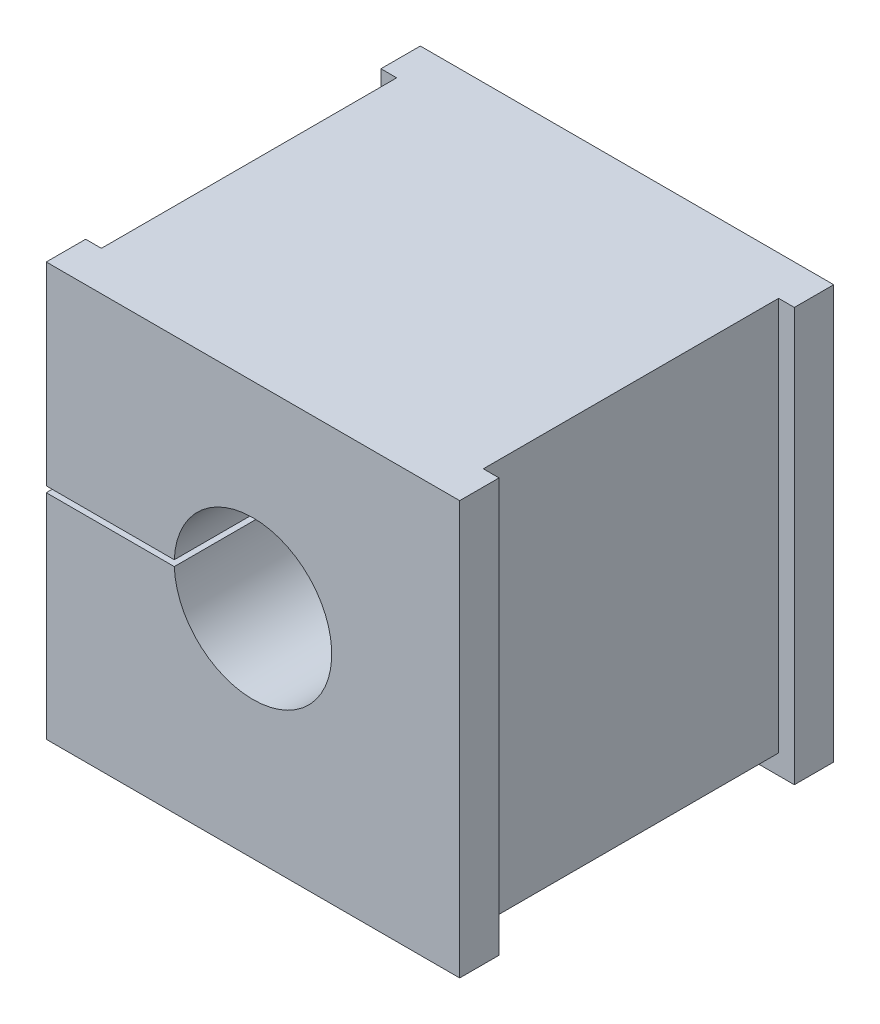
ISO-10303-21;
HEADER;
FILE_DESCRIPTION(('STEP AP214'),'2;1');
FILE_NAME('part.step','',(''),(''),'','','');
FILE_SCHEMA(('AUTOMOTIVE_DESIGN { 1 0 10303 214 1 1 1 1 }'));
ENDSEC;
DATA;
#1=APPLICATION_CONTEXT('core data for automotive mechanical design processes');
#2=APPLICATION_PROTOCOL_DEFINITION('international standard','automotive_design',2000,#1);
#3=PRODUCT_CONTEXT('',#1,'mechanical');
#4=PRODUCT('Part','Part','',(#3));
#5=PRODUCT_RELATED_PRODUCT_CATEGORY('part','',(#4));
#6=PRODUCT_DEFINITION_FORMATION('','',#4);
#7=PRODUCT_DEFINITION_CONTEXT('part definition',#1,'design');
#8=PRODUCT_DEFINITION('design','',#6,#7);
#9=PRODUCT_DEFINITION_SHAPE('','',#8);
#10=(LENGTH_UNIT() NAMED_UNIT(*) SI_UNIT(.MILLI.,.METRE.));
#11=(NAMED_UNIT(*) PLANE_ANGLE_UNIT() SI_UNIT($,.RADIAN.));
#12=(NAMED_UNIT(*) SI_UNIT($,.STERADIAN.) SOLID_ANGLE_UNIT());
#13=UNCERTAINTY_MEASURE_WITH_UNIT(LENGTH_MEASURE(1.E-05),#10,'distance_accuracy_value','');
#14=(GEOMETRIC_REPRESENTATION_CONTEXT(3) GLOBAL_UNCERTAINTY_ASSIGNED_CONTEXT((#13)) GLOBAL_UNIT_ASSIGNED_CONTEXT((#10,
#11,#12)) REPRESENTATION_CONTEXT('',''));
#15=CARTESIAN_POINT('',(0.,0.,0.));
#16=DIRECTION('',(0.,0.,1.));
#17=DIRECTION('',(1.,0.,0.));
#18=AXIS2_PLACEMENT_3D('',#15,#16,#17);
#19=CARTESIAN_POINT('',(0.,0.,14.3137084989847));
#20=DIRECTION('',(0.,0.,-1.));
#21=DIRECTION('',(1.,0.,0.));
#22=AXIS2_PLACEMENT_3D('',#19,#20,#21);
#23=CYLINDRICAL_SURFACE('',#22,4.);
#24=CARTESIAN_POINT('',(0.,0.,3.));
#25=DIRECTION('',(0.,0.,-1.));
#26=DIRECTION('',(-1.,0.,0.));
#27=AXIS2_PLACEMENT_3D('',#24,#25,#26);
#28=CIRCLE('',#27,4.);
#29=CARTESIAN_POINT('',(-3.99718651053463,0.150000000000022,3.));
#30=VERTEX_POINT('',#29);
#31=CARTESIAN_POINT('',(-3.99718651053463,-0.149999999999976,3.));
#32=VERTEX_POINT('',#31);
#33=EDGE_CURVE('E40',#30,#32,#28,.T.);
#34=ORIENTED_EDGE('',*,*,#33,.F.);
#35=DIRECTION('',(0.,0.,-1.));
#36=VECTOR('',#35,1.);
#37=CARTESIAN_POINT('',(-3.99718651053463,0.150000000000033,14.3137084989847));
#38=LINE('',#37,#36);
#39=CARTESIAN_POINT('',(-3.99718651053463,0.150000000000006,-16.));
#40=VERTEX_POINT('',#39);
#41=EDGE_CURVE('E10',#30,#40,#38,.T.);
#42=ORIENTED_EDGE('',*,*,#41,.T.);
#43=CARTESIAN_POINT('',(0.,0.,-16.));
#44=DIRECTION('',(0.,0.,-1.));
#45=DIRECTION('',(1.,0.,0.));
#46=AXIS2_PLACEMENT_3D('',#43,#44,#45);
#47=CIRCLE('',#46,4.);
#48=CARTESIAN_POINT('',(-3.99718651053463,-0.149999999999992,-16.));
#49=VERTEX_POINT('',#48);
#50=EDGE_CURVE('E26',#40,#49,#47,.T.);
#51=ORIENTED_EDGE('',*,*,#50,.T.);
#52=DIRECTION('',(0.,0.,1.));
#53=VECTOR('',#52,1.);
#54=CARTESIAN_POINT('',(-3.99718651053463,-0.149999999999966,14.3137084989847));
#55=LINE('',#54,#53);
#56=EDGE_CURVE('E493',#49,#32,#55,.T.);
#57=ORIENTED_EDGE('',*,*,#56,.T.);
#58=EDGE_LOOP('',(#34,#42,#51,#57));
#59=FACE_BOUND('',#58,.T.);
#60=ADVANCED_FACE('F15',(#59),#23,.F.);
#61=CARTESIAN_POINT('',(-7.8,7.3,-15.8));
#62=DIRECTION('',(0.,0.,-1.));
#63=DIRECTION('',(1.,0.,0.));
#64=AXIS2_PLACEMENT_3D('',#61,#62,#63);
#65=CYLINDRICAL_SURFACE('',#64,2.);
#66=CARTESIAN_POINT('',(-7.8,7.3,-15.8));
#67=DIRECTION('',(0.,0.,-1.));
#68=DIRECTION('',(1.,0.,0.));
#69=AXIS2_PLACEMENT_3D('',#66,#67,#68);
#70=CIRCLE('',#69,2.);
#71=CARTESIAN_POINT('',(-5.8,7.3,-15.8));
#72=VERTEX_POINT('',#71);
#73=EDGE_CURVE('E450',#72,#72,#70,.T.);
#74=ORIENTED_EDGE('',*,*,#73,.F.);
#75=EDGE_LOOP('',(#74));
#76=FACE_BOUND('',#75,.T.);
#77=CARTESIAN_POINT('',(-7.8,7.3,-16.));
#78=DIRECTION('',(0.,0.,-1.));
#79=DIRECTION('',(1.,0.,0.));
#80=AXIS2_PLACEMENT_3D('',#77,#78,#79);
#81=CIRCLE('',#80,2.);
#82=CARTESIAN_POINT('',(-5.8,7.3,-16.));
#83=VERTEX_POINT('',#82);
#84=EDGE_CURVE('E489',#83,#83,#81,.T.);
#85=ORIENTED_EDGE('',*,*,#84,.T.);
#86=EDGE_LOOP('',(#85));
#87=FACE_BOUND('',#86,.T.);
#88=ADVANCED_FACE('F933',(#76,#87),#65,.F.);
#89=CARTESIAN_POINT('',(0.,-9.7,-6.5));
#90=DIRECTION('',(0.,-1.,0.));
#91=DIRECTION('',(-1.,0.,0.));
#92=AXIS2_PLACEMENT_3D('',#89,#90,#91);
#93=CYLINDRICAL_SURFACE('',#92,2.9);
#94=CARTESIAN_POINT('',(0.,-9.7,-6.5));
#95=DIRECTION('',(0.,-1.,0.));
#96=DIRECTION('',(-1.,0.,0.));
#97=AXIS2_PLACEMENT_3D('',#94,#95,#96);
#98=CIRCLE('',#97,2.9);
#99=CARTESIAN_POINT('',(-2.9,-9.7,-6.5));
#100=VERTEX_POINT('',#99);
#101=EDGE_CURVE('E438',#100,#100,#98,.T.);
#102=ORIENTED_EDGE('',*,*,#101,.F.);
#103=EDGE_LOOP('',(#102));
#104=FACE_BOUND('',#103,.T.);
#105=CARTESIAN_POINT('',(0.,-10.,-6.5));
#106=DIRECTION('',(0.,1.,0.));
#107=DIRECTION('',(1.,0.,0.));
#108=AXIS2_PLACEMENT_3D('',#105,#106,#107);
#109=CIRCLE('',#108,2.9);
#110=CARTESIAN_POINT('',(-2.9,-10.,-6.5));
#111=VERTEX_POINT('',#110);
#112=EDGE_CURVE('E416',#111,#111,#109,.T.);
#113=ORIENTED_EDGE('',*,*,#112,.F.);
#114=EDGE_LOOP('',(#113));
#115=FACE_BOUND('',#114,.T.);
#116=ADVANCED_FACE('F938',(#104,#115),#93,.F.);
#117=CARTESIAN_POINT('',(-10.5,0.150000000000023,3.));
#118=DIRECTION('',(0.,1.,0.));
#119=DIRECTION('',(-1.,0.,0.));
#120=AXIS2_PLACEMENT_3D('',#117,#118,#119);
#121=PLANE('',#120);
#122=DIRECTION('',(1.,0.,0.));
#123=VECTOR('',#122,1.);
#124=CARTESIAN_POINT('',(-10.5,0.150000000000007,-16.));
#125=LINE('',#124,#123);
#126=CARTESIAN_POINT('',(-10.5,0.150000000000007,-16.));
#127=VERTEX_POINT('',#126);
#128=EDGE_CURVE('E494',#127,#40,#125,.T.);
#129=ORIENTED_EDGE('',*,*,#128,.T.);
#130=ORIENTED_EDGE('',*,*,#41,.F.);
#131=DIRECTION('',(1.,0.,0.));
#132=VECTOR('',#131,1.);
#133=CARTESIAN_POINT('',(-10.5,0.150000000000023,3.));
#134=LINE('',#133,#132);
#135=CARTESIAN_POINT('',(-10.5,0.150000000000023,3.));
#136=VERTEX_POINT('',#135);
#137=EDGE_CURVE('E621',#136,#30,#134,.T.);
#138=ORIENTED_EDGE('',*,*,#137,.F.);
#139=DIRECTION('',(0.,0.,-1.));
#140=VECTOR('',#139,1.);
#141=CARTESIAN_POINT('',(-10.5,0.150000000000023,3.));
#142=LINE('',#141,#140);
#143=CARTESIAN_POINT('',(-10.5,0.150000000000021,1.));
#144=VERTEX_POINT('',#143);
#145=EDGE_CURVE('E436',#136,#144,#142,.T.);
#146=ORIENTED_EDGE('',*,*,#145,.T.);
#147=DIRECTION('',(-1.,0.,0.));
#148=VECTOR('',#147,1.);
#149=CARTESIAN_POINT('',(-10.5,0.150000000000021,0.999999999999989));
#150=LINE('',#149,#148);
#151=CARTESIAN_POINT('',(-9.7,0.150000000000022,1.));
#152=VERTEX_POINT('',#151);
#153=EDGE_CURVE('E622',#152,#144,#150,.T.);
#154=ORIENTED_EDGE('',*,*,#153,.F.);
#155=DIRECTION('',(0.,0.,1.));
#156=VECTOR('',#155,1.);
#157=CARTESIAN_POINT('',(-9.7,0.150000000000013,-8.25));
#158=LINE('',#157,#156);
#159=CARTESIAN_POINT('',(-9.7,0.150000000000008,-14.));
#160=VERTEX_POINT('',#159);
#161=EDGE_CURVE('E431',#160,#152,#158,.T.);
#162=ORIENTED_EDGE('',*,*,#161,.F.);
#163=DIRECTION('',(1.,0.,0.));
#164=VECTOR('',#163,1.);
#165=CARTESIAN_POINT('',(-9.2,0.150000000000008,-14.));
#166=LINE('',#165,#164);
#167=CARTESIAN_POINT('',(-10.5,0.150000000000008,-14.));
#168=VERTEX_POINT('',#167);
#169=EDGE_CURVE('E442',#168,#160,#166,.T.);
#170=ORIENTED_EDGE('',*,*,#169,.F.);
#171=DIRECTION('',(0.,0.,-1.));
#172=VECTOR('',#171,1.);
#173=CARTESIAN_POINT('',(-10.5,0.150000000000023,3.));
#174=LINE('',#173,#172);
#175=EDGE_CURVE('E433',#168,#127,#174,.T.);
#176=ORIENTED_EDGE('',*,*,#175,.T.);
#177=EDGE_LOOP('',(#129,#130,#138,#146,#154,#162,#170,#176));
#178=FACE_BOUND('',#177,.T.);
#179=ADVANCED_FACE('F1304',(#178),#121,.F.);
#180=CARTESIAN_POINT('',(-10.5,-0.149999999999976,3.));
#181=DIRECTION('',(0.,-1.,0.));
#182=DIRECTION('',(1.,0.,0.));
#183=AXIS2_PLACEMENT_3D('',#180,#181,#182);
#184=PLANE('',#183);
#185=DIRECTION('',(-1.,0.,0.));
#186=VECTOR('',#185,1.);
#187=CARTESIAN_POINT('',(-10.5,-0.149999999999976,3.));
#188=LINE('',#187,#186);
#189=CARTESIAN_POINT('',(-10.5,-0.149999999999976,3.));
#190=VERTEX_POINT('',#189);
#191=EDGE_CURVE('E371',#32,#190,#188,.T.);
#192=ORIENTED_EDGE('',*,*,#191,.F.);
#193=ORIENTED_EDGE('',*,*,#56,.F.);
#194=DIRECTION('',(-1.,0.,0.));
#195=VECTOR('',#194,1.);
#196=CARTESIAN_POINT('',(-10.5,-0.149999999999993,-16.));
#197=LINE('',#196,#195);
#198=CARTESIAN_POINT('',(-10.5,-0.149999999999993,-16.));
#199=VERTEX_POINT('',#198);
#200=EDGE_CURVE('E437',#49,#199,#197,.T.);
#201=ORIENTED_EDGE('',*,*,#200,.T.);
#202=DIRECTION('',(0.,0.,-1.));
#203=VECTOR('',#202,1.);
#204=CARTESIAN_POINT('',(-10.5,-0.149999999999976,3.));
#205=LINE('',#204,#203);
#206=CARTESIAN_POINT('',(-10.5,-0.149999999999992,-14.));
#207=VERTEX_POINT('',#206);
#208=EDGE_CURVE('E495',#207,#199,#205,.T.);
#209=ORIENTED_EDGE('',*,*,#208,.F.);
#210=DIRECTION('',(-1.,0.,0.));
#211=VECTOR('',#210,1.);
#212=CARTESIAN_POINT('',(-9.2,-0.149999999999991,-14.));
#213=LINE('',#212,#211);
#214=CARTESIAN_POINT('',(-9.7,-0.149999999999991,-14.));
#215=VERTEX_POINT('',#214);
#216=EDGE_CURVE('E581',#215,#207,#213,.T.);
#217=ORIENTED_EDGE('',*,*,#216,.F.);
#218=DIRECTION('',(0.,0.,-1.));
#219=VECTOR('',#218,1.);
#220=CARTESIAN_POINT('',(-9.7,-0.149999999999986,-8.25));
#221=LINE('',#220,#219);
#222=CARTESIAN_POINT('',(-9.7,-0.149999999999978,1.));
#223=VERTEX_POINT('',#222);
#224=EDGE_CURVE('E19',#223,#215,#221,.T.);
#225=ORIENTED_EDGE('',*,*,#224,.F.);
#226=DIRECTION('',(1.,0.,0.));
#227=VECTOR('',#226,1.);
#228=CARTESIAN_POINT('',(-10.5,-0.149999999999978,0.999999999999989));
#229=LINE('',#228,#227);
#230=CARTESIAN_POINT('',(-10.5,-0.149999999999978,1.));
#231=VERTEX_POINT('',#230);
#232=EDGE_CURVE('E545',#231,#223,#229,.T.);
#233=ORIENTED_EDGE('',*,*,#232,.F.);
#234=DIRECTION('',(0.,0.,-1.));
#235=VECTOR('',#234,1.);
#236=CARTESIAN_POINT('',(-10.5,-0.149999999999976,3.));
#237=LINE('',#236,#235);
#238=EDGE_CURVE('E375',#190,#231,#237,.T.);
#239=ORIENTED_EDGE('',*,*,#238,.F.);
#240=EDGE_LOOP('',(#192,#193,#201,#209,#217,#225,#233,#239));
#241=FACE_BOUND('',#240,.T.);
#242=ADVANCED_FACE('F890',(#241),#184,.F.);
#243=CARTESIAN_POINT('',(-10.5,-0.5,-16.));
#244=DIRECTION('',(1.,0.,0.));
#245=DIRECTION('',(0.,-1.,0.));
#246=AXIS2_PLACEMENT_3D('',#243,#244,#245);
#247=PLANE('',#246);
#248=DIRECTION('',(0.,-1.,0.));
#249=VECTOR('',#248,1.);
#250=CARTESIAN_POINT('',(-10.5,-0.5,-14.));
#251=LINE('',#250,#249);
#252=CARTESIAN_POINT('',(-10.5,-11.,-14.));
#253=VERTEX_POINT('',#252);
#254=EDGE_CURVE('E578',#207,#253,#251,.T.);
#255=ORIENTED_EDGE('',*,*,#254,.F.);
#256=ORIENTED_EDGE('',*,*,#208,.T.);
#257=DIRECTION('',(0.,1.,0.));
#258=VECTOR('',#257,1.);
#259=CARTESIAN_POINT('',(-10.5,-0.5,-16.));
#260=LINE('',#259,#258);
#261=CARTESIAN_POINT('',(-10.5,-11.,-16.));
#262=VERTEX_POINT('',#261);
#263=EDGE_CURVE('E432',#262,#199,#260,.T.);
#264=ORIENTED_EDGE('',*,*,#263,.F.);
#265=DIRECTION('',(0.,0.,1.));
#266=VECTOR('',#265,1.);
#267=CARTESIAN_POINT('',(-10.5,-11.,-16.));
#268=LINE('',#267,#266);
#269=EDGE_CURVE('E374',#262,#253,#268,.T.);
#270=ORIENTED_EDGE('',*,*,#269,.T.);
#271=EDGE_LOOP('',(#255,#256,#264,#270));
#272=FACE_BOUND('',#271,.T.);
#273=ADVANCED_FACE('F898',(#272),#247,.F.);
#274=CARTESIAN_POINT('',(-10.5,-0.5,-16.));
#275=DIRECTION('',(1.,0.,0.));
#276=DIRECTION('',(0.,-1.,0.));
#277=AXIS2_PLACEMENT_3D('',#274,#275,#276);
#278=PLANE('',#277);
#279=DIRECTION('',(0.,1.,0.));
#280=VECTOR('',#279,1.);
#281=CARTESIAN_POINT('',(-10.5,-0.49999999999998,3.));
#282=LINE('',#281,#280);
#283=CARTESIAN_POINT('',(-10.5,-11.,3.));
#284=VERTEX_POINT('',#283);
#285=EDGE_CURVE('E355',#284,#190,#282,.T.);
#286=ORIENTED_EDGE('',*,*,#285,.T.);
#287=ORIENTED_EDGE('',*,*,#238,.T.);
#288=DIRECTION('',(0.,-1.,0.));
#289=VECTOR('',#288,1.);
#290=CARTESIAN_POINT('',(-10.5,-0.499999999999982,1.));
#291=LINE('',#290,#289);
#292=CARTESIAN_POINT('',(-10.5,-11.,1.00000000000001));
#293=VERTEX_POINT('',#292);
#294=EDGE_CURVE('E357',#231,#293,#291,.T.);
#295=ORIENTED_EDGE('',*,*,#294,.T.);
#296=DIRECTION('',(0.,0.,1.));
#297=VECTOR('',#296,1.);
#298=CARTESIAN_POINT('',(-10.5,-11.,-16.));
#299=LINE('',#298,#297);
#300=EDGE_CURVE('E351',#293,#284,#299,.T.);
#301=ORIENTED_EDGE('',*,*,#300,.T.);
#302=EDGE_LOOP('',(#286,#287,#295,#301));
#303=FACE_BOUND('',#302,.T.);
#304=ADVANCED_FACE('F353',(#303),#278,.F.);
#305=CARTESIAN_POINT('',(-9.7,-0.49999999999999,-8.25));
#306=DIRECTION('',(1.,0.,0.));
#307=DIRECTION('',(0.,-1.,0.));
#308=AXIS2_PLACEMENT_3D('',#305,#306,#307);
#309=PLANE('',#308);
#310=DIRECTION('',(0.,1.,0.));
#311=VECTOR('',#310,1.);
#312=CARTESIAN_POINT('',(-9.7,-10.,1.));
#313=LINE('',#312,#311);
#314=CARTESIAN_POINT('',(-9.7,-10.,1.));
#315=VERTEX_POINT('',#314);
#316=EDGE_CURVE('E362',#315,#223,#313,.T.);
#317=ORIENTED_EDGE('',*,*,#316,.T.);
#318=ORIENTED_EDGE('',*,*,#224,.T.);
#319=DIRECTION('',(0.,-1.,0.));
#320=VECTOR('',#319,1.);
#321=CARTESIAN_POINT('',(-9.7,-10.,-14.));
#322=LINE('',#321,#320);
#323=CARTESIAN_POINT('',(-9.7,-10.,-14.));
#324=VERTEX_POINT('',#323);
#325=EDGE_CURVE('E520',#215,#324,#322,.T.);
#326=ORIENTED_EDGE('',*,*,#325,.T.);
#327=DIRECTION('',(0.,0.,1.));
#328=VECTOR('',#327,1.);
#329=CARTESIAN_POINT('',(-9.7,-10.,-8.25));
#330=LINE('',#329,#328);
#331=EDGE_CURVE('E524',#324,#315,#330,.T.);
#332=ORIENTED_EDGE('',*,*,#331,.T.);
#333=EDGE_LOOP('',(#317,#318,#326,#332));
#334=FACE_BOUND('',#333,.T.);
#335=ADVANCED_FACE('F908',(#334),#309,.F.);
#336=CARTESIAN_POINT('',(-10.5,-0.499999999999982,1.));
#337=DIRECTION('',(0.,0.,1.));
#338=DIRECTION('',(-1.,0.,0.));
#339=AXIS2_PLACEMENT_3D('',#336,#337,#338);
#340=PLANE('',#339);
#341=ORIENTED_EDGE('',*,*,#294,.F.);
#342=ORIENTED_EDGE('',*,*,#232,.T.);
#343=ORIENTED_EDGE('',*,*,#316,.F.);
#344=DIRECTION('',(1.,0.,0.));
#345=VECTOR('',#344,1.);
#346=CARTESIAN_POINT('',(-10.5,-10.,1.));
#347=LINE('',#346,#345);
#348=CARTESIAN_POINT('',(9.7,-10.,1.));
#349=VERTEX_POINT('',#348);
#350=EDGE_CURVE('E512',#315,#349,#347,.T.);
#351=ORIENTED_EDGE('',*,*,#350,.T.);
#352=DIRECTION('',(0.,-1.,0.));
#353=VECTOR('',#352,1.);
#354=CARTESIAN_POINT('',(9.7,-10.,1.));
#355=LINE('',#354,#353);
#356=CARTESIAN_POINT('',(9.7,10.,0.999999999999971));
#357=VERTEX_POINT('',#356);
#358=EDGE_CURVE('E393',#357,#349,#355,.T.);
#359=ORIENTED_EDGE('',*,*,#358,.F.);
#360=DIRECTION('',(1.,0.,0.));
#361=VECTOR('',#360,1.);
#362=CARTESIAN_POINT('',(10.5,10.,0.999999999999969));
#363=LINE('',#362,#361);
#364=CARTESIAN_POINT('',(10.5,10.,0.999999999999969));
#365=VERTEX_POINT('',#364);
#366=EDGE_CURVE('E425',#357,#365,#363,.T.);
#367=ORIENTED_EDGE('',*,*,#366,.T.);
#368=DIRECTION('',(0.,-1.,0.));
#369=VECTOR('',#368,1.);
#370=CARTESIAN_POINT('',(10.5,10.,0.999999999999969));
#371=LINE('',#370,#369);
#372=CARTESIAN_POINT('',(10.5,-11.,1.));
#373=VERTEX_POINT('',#372);
#374=EDGE_CURVE('E421',#365,#373,#371,.T.);
#375=ORIENTED_EDGE('',*,*,#374,.T.);
#376=DIRECTION('',(-1.,0.,0.));
#377=VECTOR('',#376,1.);
#378=CARTESIAN_POINT('',(-10.5,-11.,1.00000000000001));
#379=LINE('',#378,#377);
#380=EDGE_CURVE('E426',#373,#293,#379,.T.);
#381=ORIENTED_EDGE('',*,*,#380,.T.);
#382=EDGE_LOOP('',(#341,#342,#343,#351,#359,#367,#375,#381));
#383=FACE_BOUND('',#382,.T.);
#384=ADVANCED_FACE('F981',(#383),#340,.F.);
#385=CARTESIAN_POINT('',(-9.2,-0.5,-14.));
#386=DIRECTION('',(0.,0.,-1.));
#387=DIRECTION('',(1.,0.,0.));
#388=AXIS2_PLACEMENT_3D('',#385,#386,#387);
#389=PLANE('',#388);
#390=ORIENTED_EDGE('',*,*,#325,.F.);
#391=ORIENTED_EDGE('',*,*,#216,.T.);
#392=ORIENTED_EDGE('',*,*,#254,.T.);
#393=DIRECTION('',(1.,0.,0.));
#394=VECTOR('',#393,1.);
#395=CARTESIAN_POINT('',(-9.2,-11.,-14.));
#396=LINE('',#395,#394);
#397=CARTESIAN_POINT('',(10.5,-11.,-14.));
#398=VERTEX_POINT('',#397);
#399=EDGE_CURVE('E582',#253,#398,#396,.T.);
#400=ORIENTED_EDGE('',*,*,#399,.T.);
#401=DIRECTION('',(0.,-1.,0.));
#402=VECTOR('',#401,1.);
#403=CARTESIAN_POINT('',(10.5,10.,-14.));
#404=LINE('',#403,#402);
#405=CARTESIAN_POINT('',(10.5,10.,-14.));
#406=VERTEX_POINT('',#405);
#407=EDGE_CURVE('E305',#406,#398,#404,.T.);
#408=ORIENTED_EDGE('',*,*,#407,.F.);
#409=DIRECTION('',(-1.,0.,0.));
#410=VECTOR('',#409,1.);
#411=CARTESIAN_POINT('',(9.2,10.,-14.));
#412=LINE('',#411,#410);
#413=CARTESIAN_POINT('',(9.7,10.,-14.));
#414=VERTEX_POINT('',#413);
#415=EDGE_CURVE('E488',#406,#414,#412,.T.);
#416=ORIENTED_EDGE('',*,*,#415,.T.);
#417=DIRECTION('',(0.,1.,0.));
#418=VECTOR('',#417,1.);
#419=CARTESIAN_POINT('',(9.7,-10.,-14.));
#420=LINE('',#419,#418);
#421=CARTESIAN_POINT('',(9.7,-10.,-14.));
#422=VERTEX_POINT('',#421);
#423=EDGE_CURVE('E414',#422,#414,#420,.T.);
#424=ORIENTED_EDGE('',*,*,#423,.F.);
#425=DIRECTION('',(1.,0.,0.));
#426=VECTOR('',#425,1.);
#427=CARTESIAN_POINT('',(-10.5,-10.,-14.));
#428=LINE('',#427,#426);
#429=EDGE_CURVE('E420',#324,#422,#428,.T.);
#430=ORIENTED_EDGE('',*,*,#429,.F.);
#431=EDGE_LOOP('',(#390,#391,#392,#400,#408,#416,#424,#430));
#432=FACE_BOUND('',#431,.T.);
#433=ADVANCED_FACE('F903',(#432),#389,.F.);
#434=CARTESIAN_POINT('',(-7.8,7.3,-15.8));
#435=DIRECTION('',(0.,0.,-1.));
#436=DIRECTION('',(1.,0.,0.));
#437=AXIS2_PLACEMENT_3D('',#434,#435,#436);
#438=PLANE('',#437);
#439=ORIENTED_EDGE('',*,*,#73,.T.);
#440=EDGE_LOOP('',(#439));
#441=FACE_BOUND('',#440,.T.);
#442=CARTESIAN_POINT('',(-8.64615384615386,8.09867788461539,-15.8));
#443=CARTESIAN_POINT('',(-8.64491678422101,8.0661293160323,-15.8));
#444=CARTESIAN_POINT('',(-8.64248726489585,8.00220577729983,-15.8));
#445=CARTESIAN_POINT('',(-8.62231888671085,7.90915433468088,-15.8));
#446=CARTESIAN_POINT('',(-8.58782469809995,7.82219019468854,-15.8));
#447=CARTESIAN_POINT('',(-8.54129192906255,7.7399751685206,-15.8));
#448=CARTESIAN_POINT('',(-8.48021660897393,7.66382304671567,-15.8));
#449=CARTESIAN_POINT('',(-8.40583190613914,7.59335563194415,-15.8));
#450=CARTESIAN_POINT('',(-8.31910304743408,7.52719472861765,-15.8));
#451=CARTESIAN_POINT('',(-8.25382030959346,7.49033093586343,-15.8));
#452=CARTESIAN_POINT('',(-8.22007211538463,7.47127403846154,-15.8));
#453=(BOUNDED_CURVE() B_SPLINE_CURVE(3,(#442,#443,#444,#445,#446,#447,#448,#449,#450,#451,#452),
.UNSPECIFIED.,.F.,.F.) B_SPLINE_CURVE_WITH_KNOTS((4,1,1,1,1,1,1,1,4),(0.,0.121932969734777,
0.239469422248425,0.354794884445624,0.471503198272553,0.592300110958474,0.719236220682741,
0.854857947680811,1.),
.UNSPECIFIED.) CURVE() GEOMETRIC_REPRESENTATION_ITEM() RATIONAL_B_SPLINE_CURVE((1.,1.,1.,1.,1.,
1.,1.,1.,1.,1.,1.)) REPRESENTATION_ITEM(''));
#454=CARTESIAN_POINT('',(-8.64615384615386,8.09867788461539,-15.8));
#455=VERTEX_POINT('',#454);
#456=CARTESIAN_POINT('',(-8.22007211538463,7.47127403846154,-15.8));
#457=VERTEX_POINT('',#456);
#458=EDGE_CURVE('E444',#455,#457,#453,.T.);
#459=ORIENTED_EDGE('',*,*,#458,.T.);
#460=CARTESIAN_POINT('',(-8.22007211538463,7.47127403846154,-15.8));
#461=CARTESIAN_POINT('',(-8.24443255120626,7.45847239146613,-15.8));
#462=CARTESIAN_POINT('',(-8.29209215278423,7.4334268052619,-15.8));
#463=CARTESIAN_POINT('',(-8.35998505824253,7.39297740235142,-15.8));
#464=CARTESIAN_POINT('',(-8.42335230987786,7.35182154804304,-15.8));
#465=CARTESIAN_POINT('',(-8.48102188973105,7.30847952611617,-15.8));
#466=CARTESIAN_POINT('',(-8.53355919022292,7.26387263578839,-15.8));
#467=CARTESIAN_POINT('',(-8.58112588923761,7.2181189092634,-15.8));
#468=CARTESIAN_POINT('',(-8.62423353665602,7.17136304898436,-15.8));
#469=CARTESIAN_POINT('',(-8.66140119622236,7.12240304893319,-15.8));
#470=CARTESIAN_POINT('',(-8.69437846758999,7.07210956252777,-15.8));
#471=CARTESIAN_POINT('',(-8.72231426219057,7.01986273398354,-15.8));
#472=CARTESIAN_POINT('',(-8.74669511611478,6.96641753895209,-15.8));
#473=CARTESIAN_POINT('',(-8.76583104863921,6.91096257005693,-15.8));
#474=CARTESIAN_POINT('',(-8.78162995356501,6.85425859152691,-15.8));
#475=CARTESIAN_POINT('',(-8.7924923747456,6.79554473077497,-15.8));
#476=CARTESIAN_POINT('',(-8.79833608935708,6.73521564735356,-15.8));
#477=CARTESIAN_POINT('',(-8.79944069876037,6.69444276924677,-15.8));
#478=CARTESIAN_POINT('',(-8.8,6.67379807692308,-15.8));
#479=(BOUNDED_CURVE() B_SPLINE_CURVE(3,(#460,#461,#462,#463,#464,#465,#466,#467,#468,#469,#470,
#471,#472,#473,#474,#475,#476,#477,#478),.UNSPECIFIED.,.F.,.F.) B_SPLINE_CURVE_WITH_KNOTS((4,1,
1,1,1,1,1,1,1,1,1,1,1,1,1,1,4),(0.,0.0790137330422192,0.154585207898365,0.226861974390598,
0.295892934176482,0.361595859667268,0.42465683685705,0.485332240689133,0.544011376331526,
0.60097353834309,0.657857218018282,0.713988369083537,0.769479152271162,0.826138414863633,
0.882891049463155,0.940703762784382,1.),
.UNSPECIFIED.) CURVE() GEOMETRIC_REPRESENTATION_ITEM() RATIONAL_B_SPLINE_CURVE((1.,1.,1.,1.,1.,
1.,1.,1.,1.,1.,1.,1.,1.,1.,1.,1.,1.,1.,1.)) REPRESENTATION_ITEM(''));
#480=CARTESIAN_POINT('',(-8.8,6.67379807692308,-15.8));
#481=VERTEX_POINT('',#480);
#482=EDGE_CURVE('E451',#457,#481,#479,.T.);
#483=ORIENTED_EDGE('',*,*,#482,.T.);
#484=CARTESIAN_POINT('',(-8.8,6.67379807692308,-15.8));
#485=CARTESIAN_POINT('',(-8.79934248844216,6.64491306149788,-15.8));
#486=CARTESIAN_POINT('',(-8.79804102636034,6.58773877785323,-15.8));
#487=CARTESIAN_POINT('',(-8.7865871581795,6.50337449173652,-15.8));
#488=CARTESIAN_POINT('',(-8.76966827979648,6.42110785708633,-15.8));
#489=CARTESIAN_POINT('',(-8.74396688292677,6.34187146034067,-15.8));
#490=CARTESIAN_POINT('',(-8.71234009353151,6.26499019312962,-15.8));
#491=CARTESIAN_POINT('',(-8.67243126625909,6.19149985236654,-15.8));
#492=CARTESIAN_POINT('',(-8.62738898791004,6.11929086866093,-15.8));
#493=CARTESIAN_POINT('',(-8.59116552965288,6.07487711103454,-15.8));
#494=CARTESIAN_POINT('',(-8.57283653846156,6.05240384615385,-15.8));
#495=(BOUNDED_CURVE() B_SPLINE_CURVE(3,(#484,#485,#486,#487,#488,#489,#490,#491,#492,#493,#494),
.UNSPECIFIED.,.F.,.F.) B_SPLINE_CURVE_WITH_KNOTS((4,1,1,1,1,1,1,1,4),(0.,0.128164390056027,
0.253685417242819,0.37734357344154,0.500524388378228,0.622900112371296,0.745827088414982,
0.871389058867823,1.),
.UNSPECIFIED.) CURVE() GEOMETRIC_REPRESENTATION_ITEM() RATIONAL_B_SPLINE_CURVE((1.,1.,1.,1.,1.,
1.,1.,1.,1.,1.,1.)) REPRESENTATION_ITEM(''));
#496=CARTESIAN_POINT('',(-8.57283653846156,6.05240384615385,-15.8));
#497=VERTEX_POINT('',#496);
#498=EDGE_CURVE('E653',#481,#497,#495,.T.);
#499=ORIENTED_EDGE('',*,*,#498,.T.);
#500=CARTESIAN_POINT('',(-8.57283653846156,6.05240384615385,-15.8));
#501=CARTESIAN_POINT('',(-8.54897670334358,6.0261806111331,-15.8));
#502=CARTESIAN_POINT('',(-8.50155187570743,5.97405818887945,-15.8));
#503=CARTESIAN_POINT('',(-8.42030936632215,5.90638606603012,-15.8));
#504=CARTESIAN_POINT('',(-8.33114775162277,5.84951515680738,-15.8));
#505=CARTESIAN_POINT('',(-8.23441203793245,5.80316781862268,-15.8));
#506=CARTESIAN_POINT('',(-8.13036080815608,5.76709422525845,-15.8));
#507=CARTESIAN_POINT('',(-8.01901623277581,5.74117206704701,-15.8));
#508=CARTESIAN_POINT('',(-7.90016124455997,5.72632427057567,-15.8));
#509=CARTESIAN_POINT('',(-7.81847084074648,5.72417799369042,-15.8));
#510=CARTESIAN_POINT('',(-7.77656250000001,5.72307692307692,-15.8));
#511=(BOUNDED_CURVE() B_SPLINE_CURVE(3,(#500,#501,#502,#503,#504,#505,#506,#507,#508,#509,#510),
.UNSPECIFIED.,.F.,.F.) B_SPLINE_CURVE_WITH_KNOTS((4,1,1,1,1,1,1,1,4),(0.,0.119283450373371,
0.23709288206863,0.354796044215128,0.474576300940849,0.597460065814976,0.724926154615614,
0.858883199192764,1.),
.UNSPECIFIED.) CURVE() GEOMETRIC_REPRESENTATION_ITEM() RATIONAL_B_SPLINE_CURVE((1.,1.,1.,1.,1.,
1.,1.,1.,1.,1.,1.)) REPRESENTATION_ITEM(''));
#512=CARTESIAN_POINT('',(-7.77656250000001,5.72307692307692,-15.8));
#513=VERTEX_POINT('',#512);
#514=EDGE_CURVE('E721',#497,#513,#511,.T.);
#515=ORIENTED_EDGE('',*,*,#514,.T.);
#516=CARTESIAN_POINT('',(-7.77656250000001,5.72307692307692,-15.8));
#517=CARTESIAN_POINT('',(-7.73626623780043,5.72406741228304,-15.8));
#518=CARTESIAN_POINT('',(-7.65785380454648,5.72599480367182,-15.8));
#519=CARTESIAN_POINT('',(-7.54370570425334,5.73898210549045,-15.8));
#520=CARTESIAN_POINT('',(-7.43717256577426,5.76197459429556,-15.8));
#521=CARTESIAN_POINT('',(-7.33774929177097,5.7927937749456,-15.8));
#522=CARTESIAN_POINT('',(-7.246397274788,5.83389188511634,-15.8));
#523=CARTESIAN_POINT('',(-7.16295041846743,5.88426617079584,-15.8));
#524=CARTESIAN_POINT('',(-7.08618565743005,5.94277934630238,-15.8));
#525=CARTESIAN_POINT('',(-7.01851119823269,6.01083959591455,-15.8));
#526=CARTESIAN_POINT('',(-6.9584463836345,6.08375288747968,-15.8));
#527=CARTESIAN_POINT('',(-6.90563762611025,6.15895204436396,-15.8));
#528=CARTESIAN_POINT('',(-6.86199135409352,6.23638233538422,-15.8));
#529=CARTESIAN_POINT('',(-6.82437177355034,6.31486596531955,-15.8));
#530=CARTESIAN_POINT('',(-6.7963755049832,6.39599317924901,-15.8));
#531=CARTESIAN_POINT('',(-6.77651870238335,6.4789314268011,-15.8));
#532=CARTESIAN_POINT('',(-6.76404586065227,6.56344508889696,-15.8));
#533=CARTESIAN_POINT('',(-6.76237768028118,6.62047058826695,-15.8));
#534=CARTESIAN_POINT('',(-6.76153846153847,6.64915865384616,-15.8));
#535=(BOUNDED_CURVE() B_SPLINE_CURVE(3,(#516,#517,#518,#519,#520,#521,#522,#523,#524,#525,#526,
#527,#528,#529,#530,#531,#532,#533,#534),.UNSPECIFIED.,.F.,.F.) B_SPLINE_CURVE_WITH_KNOTS((4,1,
1,1,1,1,1,1,1,1,1,1,1,1,1,1,4),(0.,0.0785540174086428,0.152858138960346,0.223552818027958,
0.290738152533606,0.355408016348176,0.418294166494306,0.480389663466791,0.543071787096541,
0.604921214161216,0.664393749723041,0.721936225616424,0.77801306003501,0.83383505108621,
0.888864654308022,0.944090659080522,1.),
.UNSPECIFIED.) CURVE() GEOMETRIC_REPRESENTATION_ITEM() RATIONAL_B_SPLINE_CURVE((1.,1.,1.,1.,1.,
1.,1.,1.,1.,1.,1.,1.,1.,1.,1.,1.,1.,1.,1.)) REPRESENTATION_ITEM(''));
#536=CARTESIAN_POINT('',(-6.76153846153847,6.64915865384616,-15.8));
#537=VERTEX_POINT('',#536);
#538=EDGE_CURVE('E715',#513,#537,#535,.T.);
#539=ORIENTED_EDGE('',*,*,#538,.T.);
#540=CARTESIAN_POINT('',(-6.76153846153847,6.64915865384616,-15.8));
#541=CARTESIAN_POINT('',(-6.76203390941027,6.67020934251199,-15.8));
#542=CARTESIAN_POINT('',(-6.76301308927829,6.71181293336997,-15.8));
#543=CARTESIAN_POINT('',(-6.76978691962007,6.77327875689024,-15.8));
#544=CARTESIAN_POINT('',(-6.78068638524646,6.83310147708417,-15.8));
#545=CARTESIAN_POINT('',(-6.79545616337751,6.89151721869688,-15.8));
#546=CARTESIAN_POINT('',(-6.81565641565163,6.94821775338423,-15.8));
#547=CARTESIAN_POINT('',(-6.83962112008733,7.0034954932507,-15.8));
#548=CARTESIAN_POINT('',(-6.86783332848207,7.05734883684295,-15.8));
#549=CARTESIAN_POINT('',(-6.9014039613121,7.10895788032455,-15.8));
#550=CARTESIAN_POINT('',(-6.93839009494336,7.16015074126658,-15.8));
#551=CARTESIAN_POINT('',(-6.98229603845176,7.20838545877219,-15.8));
#552=CARTESIAN_POINT('',(-7.03019460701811,7.25649527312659,-15.8));
#553=CARTESIAN_POINT('',(-7.08493721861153,7.30155463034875,-15.8));
#554=CARTESIAN_POINT('',(-7.14356736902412,7.34728606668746,-15.8));
#555=CARTESIAN_POINT('',(-7.20881943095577,7.38986724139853,-15.8));
#556=CARTESIAN_POINT('',(-7.27851763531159,7.43262141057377,-15.8));
#557=CARTESIAN_POINT('',(-7.32806750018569,7.4581687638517,-15.8));
#558=CARTESIAN_POINT('',(-7.35348557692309,7.47127403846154,-15.8));
#559=(BOUNDED_CURVE() B_SPLINE_CURVE(3,(#540,#541,#542,#543,#544,#545,#546,#547,#548,#549,#550,
#551,#552,#553,#554,#555,#556,#557,#558),.UNSPECIFIED.,.F.,.F.) B_SPLINE_CURVE_WITH_KNOTS((4,1,
1,1,1,1,1,1,1,1,1,1,1,1,1,1,4),(0.,0.0588484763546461,0.116305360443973,0.172659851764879,
0.228760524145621,0.284555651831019,0.340740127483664,0.397108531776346,0.454280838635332,
0.512752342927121,0.573447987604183,0.636416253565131,0.702388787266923,0.771502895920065,
0.844198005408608,0.920076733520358,1.),
.UNSPECIFIED.) CURVE() GEOMETRIC_REPRESENTATION_ITEM() RATIONAL_B_SPLINE_CURVE((1.,1.,1.,1.,1.,
1.,1.,1.,1.,1.,1.,1.,1.,1.,1.,1.,1.,1.,1.)) REPRESENTATION_ITEM(''));
#560=CARTESIAN_POINT('',(-7.35348557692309,7.47127403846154,-15.8));
#561=VERTEX_POINT('',#560);
#562=EDGE_CURVE('E722',#537,#561,#559,.T.);
#563=ORIENTED_EDGE('',*,*,#562,.T.);
#564=CARTESIAN_POINT('',(-7.35348557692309,7.47127403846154,-15.8));
#565=CARTESIAN_POINT('',(-7.31873532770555,7.49030180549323,-15.8));
#566=CARTESIAN_POINT('',(-7.251554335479,7.52708727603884,-15.8));
#567=CARTESIAN_POINT('',(-7.16174960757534,7.59382935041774,-15.8));
#568=CARTESIAN_POINT('',(-7.08567740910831,7.66742490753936,-15.8));
#569=CARTESIAN_POINT('',(-7.02414618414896,7.74798469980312,-15.8));
#570=CARTESIAN_POINT('',(-6.97556416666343,7.83286100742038,-15.8));
#571=CARTESIAN_POINT('',(-6.94121612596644,7.92160700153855,-15.8));
#572=CARTESIAN_POINT('',(-6.91879637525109,8.01323286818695,-15.8));
#573=CARTESIAN_POINT('',(-6.91652523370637,8.07571261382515,-15.8));
#574=CARTESIAN_POINT('',(-6.91538461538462,8.10709134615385,-15.8));
#575=(BOUNDED_CURVE() B_SPLINE_CURVE(3,(#564,#565,#566,#567,#568,#569,#570,#571,#572,#573,#574),
.UNSPECIFIED.,.F.,.F.) B_SPLINE_CURVE_WITH_KNOTS((4,1,1,1,1,1,1,1,4),(0.,0.145876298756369,
0.282015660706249,0.410969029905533,0.534711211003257,0.654396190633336,0.770107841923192,
0.88454299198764,1.),
.UNSPECIFIED.) CURVE() GEOMETRIC_REPRESENTATION_ITEM() RATIONAL_B_SPLINE_CURVE((1.,1.,1.,1.,1.,
1.,1.,1.,1.,1.,1.)) REPRESENTATION_ITEM(''));
#576=CARTESIAN_POINT('',(-6.91538461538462,8.10709134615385,-15.8));
#577=VERTEX_POINT('',#576);
#578=EDGE_CURVE('E730',#561,#577,#575,.T.);
#579=ORIENTED_EDGE('',*,*,#578,.T.);
#580=CARTESIAN_POINT('',(-6.91538461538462,8.10709134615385,-15.8));
#581=CARTESIAN_POINT('',(-6.91678889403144,8.13905920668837,-15.8));
#582=CARTESIAN_POINT('',(-6.91961173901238,8.20332018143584,-15.8));
#583=CARTESIAN_POINT('',(-6.94235915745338,8.29900528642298,-15.8));
#584=CARTESIAN_POINT('',(-6.97970921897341,8.39303489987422,-15.8));
#585=CARTESIAN_POINT('',(-7.02964069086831,8.48519112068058,-15.8));
#586=CARTESIAN_POINT('',(-7.09318466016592,8.5712747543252,-15.8));
#587=CARTESIAN_POINT('',(-7.16839782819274,8.64910675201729,-15.8));
#588=CARTESIAN_POINT('',(-7.25518558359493,8.71667273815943,-15.8));
#589=CARTESIAN_POINT('',(-7.35164035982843,8.77378820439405,-15.8));
#590=CARTESIAN_POINT('',(-7.45525373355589,8.82049605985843,-15.8));
#591=CARTESIAN_POINT('',(-7.56475945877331,8.85238281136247,-15.8));
#592=CARTESIAN_POINT('',(-7.67820587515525,8.87335475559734,-15.8));
#593=CARTESIAN_POINT('',(-7.75543393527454,8.8757225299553,-15.8));
#594=CARTESIAN_POINT('',(-7.79459134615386,8.87692307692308,-15.8));
#595=(BOUNDED_CURVE() B_SPLINE_CURVE(3,(#580,#581,#582,#583,#584,#585,#586,#587,#588,#589,#590,
#591,#592,#593,#594),.UNSPECIFIED.,.F.,.F.) B_SPLINE_CURVE_WITH_KNOTS((4,1,1,1,1,1,1,1,1,1,1,1,
4),(0.,0.0740603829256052,0.148874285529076,0.226673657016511,0.308150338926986,
0.391200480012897,0.473974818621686,0.558340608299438,0.645404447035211,0.733357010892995,
0.821087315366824,0.909284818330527,1.),
.UNSPECIFIED.) CURVE() GEOMETRIC_REPRESENTATION_ITEM() RATIONAL_B_SPLINE_CURVE((1.,1.,1.,1.,1.,
1.,1.,1.,1.,1.,1.,1.,1.,1.,1.)) REPRESENTATION_ITEM(''));
#596=CARTESIAN_POINT('',(-7.79459134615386,8.87692307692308,-15.8));
#597=VERTEX_POINT('',#596);
#598=EDGE_CURVE('E173',#577,#597,#595,.T.);
#599=ORIENTED_EDGE('',*,*,#598,.T.);
#600=CARTESIAN_POINT('',(-7.79459134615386,8.87692307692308,-15.8));
#601=CARTESIAN_POINT('',(-7.83273889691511,8.87568871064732,-15.8));
#602=CARTESIAN_POINT('',(-7.90796152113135,8.87325468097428,-15.8));
#603=CARTESIAN_POINT('',(-8.01869617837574,8.85275371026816,-15.8));
#604=CARTESIAN_POINT('',(-8.12473916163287,8.81889761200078,-15.8));
#605=CARTESIAN_POINT('',(-8.22549614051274,8.7727854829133,-15.8));
#606=CARTESIAN_POINT('',(-8.31882322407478,8.71532842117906,-15.8));
#607=CARTESIAN_POINT('',(-8.40187568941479,8.64701887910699,-15.8));
#608=CARTESIAN_POINT('',(-8.47533153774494,8.5700349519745,-15.8));
#609=CARTESIAN_POINT('',(-8.53601932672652,8.48366739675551,-15.8));
#610=CARTESIAN_POINT('',(-8.58470375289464,8.39151732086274,-15.8));
#611=CARTESIAN_POINT('',(-8.61976214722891,8.29592727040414,-15.8));
#612=CARTESIAN_POINT('',(-8.64192634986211,8.19804322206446,-15.8));
#613=CARTESIAN_POINT('',(-8.6447427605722,8.13184479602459,-15.8));
#614=CARTESIAN_POINT('',(-8.64615384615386,8.09867788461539,-15.8));
#615=(BOUNDED_CURVE() B_SPLINE_CURVE(3,(#600,#601,#602,#603,#604,#605,#606,#607,#608,#609,#610,
#611,#612,#613,#614),.UNSPECIFIED.,.F.,.F.) B_SPLINE_CURVE_WITH_KNOTS((4,1,1,1,1,1,1,1,1,1,1,1,
4),(0.,0.0893861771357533,0.176259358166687,0.263004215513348,0.349801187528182,
0.435431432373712,0.519202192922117,0.601265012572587,0.684144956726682,0.765868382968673,
0.844917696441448,0.922300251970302,1.),
.UNSPECIFIED.) CURVE() GEOMETRIC_REPRESENTATION_ITEM() RATIONAL_B_SPLINE_CURVE((1.,1.,1.,1.,1.,
1.,1.,1.,1.,1.,1.,1.,1.,1.,1.)) REPRESENTATION_ITEM(''));
#616=EDGE_CURVE('E186',#597,#455,#615,.T.);
#617=ORIENTED_EDGE('',*,*,#616,.T.);
#618=EDGE_LOOP('',(#459,#483,#499,#515,#539,#563,#579,#599,#617));
#619=FACE_BOUND('',#618,.T.);
#620=ADVANCED_FACE('F1010',(#441,#619),#438,.T.);
#621=CARTESIAN_POINT('',(-10.5,-10.,-14.));
#622=DIRECTION('',(0.,1.,0.));
#623=DIRECTION('',(-1.,0.,0.));
#624=AXIS2_PLACEMENT_3D('',#621,#622,#623);
#625=PLANE('',#624);
#626=ORIENTED_EDGE('',*,*,#429,.T.);
#627=DIRECTION('',(0.,0.,-1.));
#628=VECTOR('',#627,1.);
#629=CARTESIAN_POINT('',(9.7,-10.,-1.));
#630=LINE('',#629,#628);
#631=EDGE_CURVE('E539',#349,#422,#630,.T.);
#632=ORIENTED_EDGE('',*,*,#631,.F.);
#633=ORIENTED_EDGE('',*,*,#350,.F.);
#634=ORIENTED_EDGE('',*,*,#331,.F.);
#635=EDGE_LOOP('',(#626,#632,#633,#634));
#636=FACE_BOUND('',#635,.T.);
#637=ORIENTED_EDGE('',*,*,#112,.T.);
#638=EDGE_LOOP('',(#637));
#639=FACE_BOUND('',#638,.T.);
#640=ADVANCED_FACE('F1005',(#636,#639),#625,.F.);
#641=CARTESIAN_POINT('',(-10.5,-11.,-16.));
#642=DIRECTION('',(0.,1.,0.));
#643=DIRECTION('',(0.,0.,1.));
#644=AXIS2_PLACEMENT_3D('',#641,#642,#643);
#645=PLANE('',#644);
#646=DIRECTION('',(0.,0.,1.));
#647=VECTOR('',#646,1.);
#648=CARTESIAN_POINT('',(10.5,-11.,-16.));
#649=LINE('',#648,#647);
#650=CARTESIAN_POINT('',(10.5,-11.,-16.));
#651=VERTEX_POINT('',#650);
#652=EDGE_CURVE('E389',#651,#398,#649,.T.);
#653=ORIENTED_EDGE('',*,*,#652,.T.);
#654=ORIENTED_EDGE('',*,*,#399,.F.);
#655=ORIENTED_EDGE('',*,*,#269,.F.);
#656=DIRECTION('',(-1.,0.,0.));
#657=VECTOR('',#656,1.);
#658=CARTESIAN_POINT('',(-10.5,-11.,-16.));
#659=LINE('',#658,#657);
#660=EDGE_CURVE('E459',#651,#262,#659,.T.);
#661=ORIENTED_EDGE('',*,*,#660,.F.);
#662=EDGE_LOOP('',(#653,#654,#655,#661));
#663=FACE_BOUND('',#662,.T.);
#664=ADVANCED_FACE('F901',(#663),#645,.F.);
#665=CARTESIAN_POINT('',(-10.5,-11.,-16.));
#666=DIRECTION('',(0.,1.,0.));
#667=DIRECTION('',(0.,0.,1.));
#668=AXIS2_PLACEMENT_3D('',#665,#666,#667);
#669=PLANE('',#668);
#670=ORIENTED_EDGE('',*,*,#380,.F.);
#671=DIRECTION('',(0.,0.,1.));
#672=VECTOR('',#671,1.);
#673=CARTESIAN_POINT('',(10.5,-11.,-16.));
#674=LINE('',#673,#672);
#675=CARTESIAN_POINT('',(10.5,-11.,3.));
#676=VERTEX_POINT('',#675);
#677=EDGE_CURVE('E379',#373,#676,#674,.T.);
#678=ORIENTED_EDGE('',*,*,#677,.T.);
#679=DIRECTION('',(-1.,0.,0.));
#680=VECTOR('',#679,1.);
#681=CARTESIAN_POINT('',(-10.5,-11.,3.));
#682=LINE('',#681,#680);
#683=EDGE_CURVE('E368',#676,#284,#682,.T.);
#684=ORIENTED_EDGE('',*,*,#683,.T.);
#685=ORIENTED_EDGE('',*,*,#300,.F.);
#686=EDGE_LOOP('',(#670,#678,#684,#685));
#687=FACE_BOUND('',#686,.T.);
#688=ADVANCED_FACE('F377',(#687),#669,.F.);
#689=CARTESIAN_POINT('',(9.7,10.,-1.00000000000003));
#690=DIRECTION('',(1.,0.,0.));
#691=DIRECTION('',(0.,-1.,0.));
#692=AXIS2_PLACEMENT_3D('',#689,#690,#691);
#693=PLANE('',#692);
#694=DIRECTION('',(0.,0.,1.));
#695=VECTOR('',#694,1.);
#696=CARTESIAN_POINT('',(9.7,10.,-8.25));
#697=LINE('',#696,#695);
#698=EDGE_CURVE('E382',#414,#357,#697,.T.);
#699=ORIENTED_EDGE('',*,*,#698,.T.);
#700=ORIENTED_EDGE('',*,*,#358,.T.);
#701=ORIENTED_EDGE('',*,*,#631,.T.);
#702=ORIENTED_EDGE('',*,*,#423,.T.);
#703=EDGE_LOOP('',(#699,#700,#701,#702));
#704=FACE_BOUND('',#703,.T.);
#705=ADVANCED_FACE('F997',(#704),#693,.T.);
#706=CARTESIAN_POINT('',(-10.5,10.,-16.));
#707=DIRECTION('',(0.,1.,0.));
#708=DIRECTION('',(0.,0.,1.));
#709=AXIS2_PLACEMENT_3D('',#706,#707,#708);
#710=PLANE('',#709);
#711=DIRECTION('',(0.,0.,1.));
#712=VECTOR('',#711,1.);
#713=CARTESIAN_POINT('',(-9.7,10.,-8.25));
#714=LINE('',#713,#712);
#715=CARTESIAN_POINT('',(-9.7,10.,-14.));
#716=VERTEX_POINT('',#715);
#717=CARTESIAN_POINT('',(-9.7,10.,0.999999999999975));
#718=VERTEX_POINT('',#717);
#719=EDGE_CURVE('E407',#716,#718,#714,.T.);
#720=ORIENTED_EDGE('',*,*,#719,.T.);
#721=DIRECTION('',(-1.,0.,0.));
#722=VECTOR('',#721,1.);
#723=CARTESIAN_POINT('',(-10.5,10.,0.999999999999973));
#724=LINE('',#723,#722);
#725=CARTESIAN_POINT('',(-10.5,10.,0.999999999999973));
#726=VERTEX_POINT('',#725);
#727=EDGE_CURVE('E415',#718,#726,#724,.T.);
#728=ORIENTED_EDGE('',*,*,#727,.T.);
#729=DIRECTION('',(0.,0.,1.));
#730=VECTOR('',#729,1.);
#731=CARTESIAN_POINT('',(-10.5,10.,-16.));
#732=LINE('',#731,#730);
#733=CARTESIAN_POINT('',(-10.5,10.,3.));
#734=VERTEX_POINT('',#733);
#735=EDGE_CURVE('E516',#726,#734,#732,.T.);
#736=ORIENTED_EDGE('',*,*,#735,.T.);
#737=DIRECTION('',(-1.,0.,0.));
#738=VECTOR('',#737,1.);
#739=CARTESIAN_POINT('',(-10.5,10.,3.));
#740=LINE('',#739,#738);
#741=CARTESIAN_POINT('',(10.5,10.,3.));
#742=VERTEX_POINT('',#741);
#743=EDGE_CURVE('E645',#742,#734,#740,.T.);
#744=ORIENTED_EDGE('',*,*,#743,.F.);
#745=DIRECTION('',(0.,0.,1.));
#746=VECTOR('',#745,1.);
#747=CARTESIAN_POINT('',(10.5,10.,-16.));
#748=LINE('',#747,#746);
#749=EDGE_CURVE('E552',#365,#742,#748,.T.);
#750=ORIENTED_EDGE('',*,*,#749,.F.);
#751=ORIENTED_EDGE('',*,*,#366,.F.);
#752=ORIENTED_EDGE('',*,*,#698,.F.);
#753=ORIENTED_EDGE('',*,*,#415,.F.);
#754=DIRECTION('',(0.,0.,1.));
#755=VECTOR('',#754,1.);
#756=CARTESIAN_POINT('',(10.5,10.,-16.));
#757=LINE('',#756,#755);
#758=CARTESIAN_POINT('',(10.5,10.,-16.));
#759=VERTEX_POINT('',#758);
#760=EDGE_CURVE('E559',#759,#406,#757,.T.);
#761=ORIENTED_EDGE('',*,*,#760,.F.);
#762=DIRECTION('',(-1.,0.,0.));
#763=VECTOR('',#762,1.);
#764=CARTESIAN_POINT('',(-10.5,10.,-16.));
#765=LINE('',#764,#763);
#766=CARTESIAN_POINT('',(-10.5,10.,-16.));
#767=VERTEX_POINT('',#766);
#768=EDGE_CURVE('E473',#759,#767,#765,.T.);
#769=ORIENTED_EDGE('',*,*,#768,.T.);
#770=DIRECTION('',(0.,0.,1.));
#771=VECTOR('',#770,1.);
#772=CARTESIAN_POINT('',(-10.5,10.,-16.));
#773=LINE('',#772,#771);
#774=CARTESIAN_POINT('',(-10.5,10.,-14.));
#775=VERTEX_POINT('',#774);
#776=EDGE_CURVE('E466',#767,#775,#773,.T.);
#777=ORIENTED_EDGE('',*,*,#776,.T.);
#778=DIRECTION('',(1.,0.,0.));
#779=VECTOR('',#778,1.);
#780=CARTESIAN_POINT('',(-9.2,10.,-14.));
#781=LINE('',#780,#779);
#782=EDGE_CURVE('E474',#775,#716,#781,.T.);
#783=ORIENTED_EDGE('',*,*,#782,.T.);
#784=EDGE_LOOP('',(#720,#728,#736,#744,#750,#751,#752,#753,#761,#769,#777,#783));
#785=FACE_BOUND('',#784,.T.);
#786=ADVANCED_FACE('F953',(#785),#710,.T.);
#787=CARTESIAN_POINT('',(10.5,-0.5,-16.));
#788=DIRECTION('',(1.,0.,0.));
#789=DIRECTION('',(0.,-1.,0.));
#790=AXIS2_PLACEMENT_3D('',#787,#788,#789);
#791=PLANE('',#790);
#792=ORIENTED_EDGE('',*,*,#374,.F.);
#793=ORIENTED_EDGE('',*,*,#749,.T.);
#794=DIRECTION('',(0.,1.,0.));
#795=VECTOR('',#794,1.);
#796=CARTESIAN_POINT('',(10.5,-0.49999999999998,3.));
#797=LINE('',#796,#795);
#798=EDGE_CURVE('E639',#676,#742,#797,.T.);
#799=ORIENTED_EDGE('',*,*,#798,.F.);
#800=ORIENTED_EDGE('',*,*,#677,.F.);
#801=EDGE_LOOP('',(#792,#793,#799,#800));
#802=FACE_BOUND('',#801,.T.);
#803=ADVANCED_FACE('F947',(#802),#791,.T.);
#804=CARTESIAN_POINT('',(10.5,-0.5,-16.));
#805=DIRECTION('',(1.,0.,0.));
#806=DIRECTION('',(0.,-1.,0.));
#807=AXIS2_PLACEMENT_3D('',#804,#805,#806);
#808=PLANE('',#807);
#809=ORIENTED_EDGE('',*,*,#760,.T.);
#810=ORIENTED_EDGE('',*,*,#407,.T.);
#811=ORIENTED_EDGE('',*,*,#652,.F.);
#812=DIRECTION('',(0.,1.,0.));
#813=VECTOR('',#812,1.);
#814=CARTESIAN_POINT('',(10.5,-0.5,-16.));
#815=LINE('',#814,#813);
#816=EDGE_CURVE('E711',#651,#759,#815,.T.);
#817=ORIENTED_EDGE('',*,*,#816,.T.);
#818=EDGE_LOOP('',(#809,#810,#811,#817));
#819=FACE_BOUND('',#818,.T.);
#820=ADVANCED_FACE('F952',(#819),#808,.T.);
#821=CARTESIAN_POINT('',(-10.5,-0.5,-16.));
#822=DIRECTION('',(1.,0.,0.));
#823=DIRECTION('',(0.,-1.,0.));
#824=AXIS2_PLACEMENT_3D('',#821,#822,#823);
#825=PLANE('',#824);
#826=DIRECTION('',(0.,1.,0.));
#827=VECTOR('',#826,1.);
#828=CARTESIAN_POINT('',(-10.5,-0.5,-16.));
#829=LINE('',#828,#827);
#830=EDGE_CURVE('E452',#127,#767,#829,.T.);
#831=ORIENTED_EDGE('',*,*,#830,.F.);
#832=ORIENTED_EDGE('',*,*,#175,.F.);
#833=DIRECTION('',(0.,-1.,0.));
#834=VECTOR('',#833,1.);
#835=CARTESIAN_POINT('',(-10.5,-0.5,-14.));
#836=LINE('',#835,#834);
#837=EDGE_CURVE('E759',#775,#168,#836,.T.);
#838=ORIENTED_EDGE('',*,*,#837,.F.);
#839=ORIENTED_EDGE('',*,*,#776,.F.);
#840=EDGE_LOOP('',(#831,#832,#838,#839));
#841=FACE_BOUND('',#840,.T.);
#842=ADVANCED_FACE('F17',(#841),#825,.F.);
#843=CARTESIAN_POINT('',(-10.5,-0.5,-16.));
#844=DIRECTION('',(1.,0.,0.));
#845=DIRECTION('',(0.,-1.,0.));
#846=AXIS2_PLACEMENT_3D('',#843,#844,#845);
#847=PLANE('',#846);
#848=DIRECTION('',(0.,-1.,0.));
#849=VECTOR('',#848,1.);
#850=CARTESIAN_POINT('',(-10.5,-0.499999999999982,1.));
#851=LINE('',#850,#849);
#852=EDGE_CURVE('E564',#726,#144,#851,.T.);
#853=ORIENTED_EDGE('',*,*,#852,.T.);
#854=ORIENTED_EDGE('',*,*,#145,.F.);
#855=DIRECTION('',(0.,1.,0.));
#856=VECTOR('',#855,1.);
#857=CARTESIAN_POINT('',(-10.5,-0.49999999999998,3.));
#858=LINE('',#857,#856);
#859=EDGE_CURVE('E560',#136,#734,#858,.T.);
#860=ORIENTED_EDGE('',*,*,#859,.T.);
#861=ORIENTED_EDGE('',*,*,#735,.F.);
#862=EDGE_LOOP('',(#853,#854,#860,#861));
#863=FACE_BOUND('',#862,.T.);
#864=ADVANCED_FACE('F923',(#863),#847,.F.);
#865=CARTESIAN_POINT('',(-9.7,-0.49999999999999,-8.25));
#866=DIRECTION('',(1.,0.,0.));
#867=DIRECTION('',(0.,-1.,0.));
#868=AXIS2_PLACEMENT_3D('',#865,#866,#867);
#869=PLANE('',#868);
#870=DIRECTION('',(0.,-1.,0.));
#871=VECTOR('',#870,1.);
#872=CARTESIAN_POINT('',(-9.7,-10.,-14.));
#873=LINE('',#872,#871);
#874=EDGE_CURVE('E565',#716,#160,#873,.T.);
#875=ORIENTED_EDGE('',*,*,#874,.T.);
#876=ORIENTED_EDGE('',*,*,#161,.T.);
#877=DIRECTION('',(0.,1.,0.));
#878=VECTOR('',#877,1.);
#879=CARTESIAN_POINT('',(-9.7,-10.,1.));
#880=LINE('',#879,#878);
#881=EDGE_CURVE('E427',#152,#718,#880,.T.);
#882=ORIENTED_EDGE('',*,*,#881,.T.);
#883=ORIENTED_EDGE('',*,*,#719,.F.);
#884=EDGE_LOOP('',(#875,#876,#882,#883));
#885=FACE_BOUND('',#884,.T.);
#886=ADVANCED_FACE('F918',(#885),#869,.F.);
#887=CARTESIAN_POINT('',(-10.5,-0.5,-16.));
#888=DIRECTION('',(0.,0.,1.));
#889=DIRECTION('',(-1.,0.,0.));
#890=AXIS2_PLACEMENT_3D('',#887,#888,#889);
#891=PLANE('',#890);
#892=ORIENTED_EDGE('',*,*,#263,.T.);
#893=ORIENTED_EDGE('',*,*,#200,.F.);
#894=ORIENTED_EDGE('',*,*,#50,.F.);
#895=ORIENTED_EDGE('',*,*,#128,.F.);
#896=ORIENTED_EDGE('',*,*,#830,.T.);
#897=ORIENTED_EDGE('',*,*,#768,.F.);
#898=ORIENTED_EDGE('',*,*,#816,.F.);
#899=ORIENTED_EDGE('',*,*,#660,.T.);
#900=EDGE_LOOP('',(#892,#893,#894,#895,#896,#897,#898,#899));
#901=FACE_BOUND('',#900,.T.);
#902=ORIENTED_EDGE('',*,*,#84,.F.);
#903=EDGE_LOOP('',(#902));
#904=FACE_BOUND('',#903,.T.);
#905=ADVANCED_FACE('F894',(#901,#904),#891,.F.);
#906=CARTESIAN_POINT('',(-10.5,-0.49999999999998,3.));
#907=DIRECTION('',(0.,0.,1.));
#908=DIRECTION('',(-1.,0.,0.));
#909=AXIS2_PLACEMENT_3D('',#906,#907,#908);
#910=PLANE('',#909);
#911=ORIENTED_EDGE('',*,*,#191,.T.);
#912=ORIENTED_EDGE('',*,*,#285,.F.);
#913=ORIENTED_EDGE('',*,*,#683,.F.);
#914=ORIENTED_EDGE('',*,*,#798,.T.);
#915=ORIENTED_EDGE('',*,*,#743,.T.);
#916=ORIENTED_EDGE('',*,*,#859,.F.);
#917=ORIENTED_EDGE('',*,*,#137,.T.);
#918=ORIENTED_EDGE('',*,*,#33,.T.);
#919=EDGE_LOOP('',(#911,#912,#913,#914,#915,#916,#917,#918));
#920=FACE_BOUND('',#919,.T.);
#921=ADVANCED_FACE('F366',(#920),#910,.T.);
#922=CARTESIAN_POINT('',(-10.5,-0.499999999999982,1.));
#923=DIRECTION('',(0.,0.,1.));
#924=DIRECTION('',(-1.,0.,0.));
#925=AXIS2_PLACEMENT_3D('',#922,#923,#924);
#926=PLANE('',#925);
#927=ORIENTED_EDGE('',*,*,#881,.F.);
#928=ORIENTED_EDGE('',*,*,#153,.T.);
#929=ORIENTED_EDGE('',*,*,#852,.F.);
#930=ORIENTED_EDGE('',*,*,#727,.F.);
#931=EDGE_LOOP('',(#927,#928,#929,#930));
#932=FACE_BOUND('',#931,.T.);
#933=ADVANCED_FACE('F1022',(#932),#926,.F.);
#934=CARTESIAN_POINT('',(-9.2,-0.5,-14.));
#935=DIRECTION('',(0.,0.,-1.));
#936=DIRECTION('',(1.,0.,0.));
#937=AXIS2_PLACEMENT_3D('',#934,#935,#936);
#938=PLANE('',#937);
#939=ORIENTED_EDGE('',*,*,#837,.T.);
#940=ORIENTED_EDGE('',*,*,#169,.T.);
#941=ORIENTED_EDGE('',*,*,#874,.F.);
#942=ORIENTED_EDGE('',*,*,#782,.F.);
#943=EDGE_LOOP('',(#939,#940,#941,#942));
#944=FACE_BOUND('',#943,.T.);
#945=ADVANCED_FACE('F1032',(#944),#938,.F.);
#946=CARTESIAN_POINT('',(0.,-9.7,-6.5));
#947=DIRECTION('',(0.,-1.,0.));
#948=DIRECTION('',(1.,0.,0.));
#949=AXIS2_PLACEMENT_3D('',#946,#947,#948);
#950=PLANE('',#949);
#951=ORIENTED_EDGE('',*,*,#101,.T.);
#952=EDGE_LOOP('',(#951));
#953=FACE_BOUND('',#952,.T.);
#954=ADVANCED_FACE('F1174',(#953),#950,.T.);
#955=CARTESIAN_POINT('',(-8.52665113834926,7.72364466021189,-16.));
#956=DIRECTION('',(0.,0.,-1.));
#957=DIRECTION('',(1.,9.2023688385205E-13,0.));
#958=AXIS2_PLACEMENT_3D('',#955,#956,#957);
#959=PLANE('',#958);
#960=CARTESIAN_POINT('',(-8.64615384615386,8.09867788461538,-16.));
#961=CARTESIAN_POINT('',(-8.64491678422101,8.06612931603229,-16.));
#962=CARTESIAN_POINT('',(-8.64248726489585,8.00220577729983,-16.));
#963=CARTESIAN_POINT('',(-8.62231888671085,7.90915433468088,-16.));
#964=CARTESIAN_POINT('',(-8.58782469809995,7.82219019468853,-16.));
#965=CARTESIAN_POINT('',(-8.54129192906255,7.7399751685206,-16.));
#966=CARTESIAN_POINT('',(-8.48021660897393,7.66382304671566,-16.));
#967=CARTESIAN_POINT('',(-8.40583190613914,7.59335563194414,-16.));
#968=CARTESIAN_POINT('',(-8.31910304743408,7.52719472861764,-16.));
#969=CARTESIAN_POINT('',(-8.25382030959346,7.49033093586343,-16.));
#970=CARTESIAN_POINT('',(-8.22007211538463,7.47127403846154,-16.));
#971=(BOUNDED_CURVE() B_SPLINE_CURVE(3,(#960,#961,#962,#963,#964,#965,#966,#967,#968,#969,#970),
.UNSPECIFIED.,.F.,.F.) B_SPLINE_CURVE_WITH_KNOTS((4,1,1,1,1,1,1,1,4),(0.,0.121932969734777,
0.239469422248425,0.354794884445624,0.471503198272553,0.592300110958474,0.719236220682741,
0.854857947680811,1.),
.UNSPECIFIED.) CURVE() GEOMETRIC_REPRESENTATION_ITEM() RATIONAL_B_SPLINE_CURVE((1.,1.,1.,1.,1.,
1.,1.,1.,1.,1.,1.)) REPRESENTATION_ITEM(''));
#972=CARTESIAN_POINT('',(-8.64615384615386,8.09867788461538,-16.));
#973=VERTEX_POINT('',#972);
#974=CARTESIAN_POINT('',(-8.22007211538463,7.47127403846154,-16.));
#975=VERTEX_POINT('',#974);
#976=EDGE_CURVE('E443',#973,#975,#971,.T.);
#977=ORIENTED_EDGE('',*,*,#976,.F.);
#978=CARTESIAN_POINT('',(-7.79459134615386,8.87692307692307,-16.));
#979=CARTESIAN_POINT('',(-7.83273889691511,8.87568871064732,-16.));
#980=CARTESIAN_POINT('',(-7.90796152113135,8.87325468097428,-16.));
#981=CARTESIAN_POINT('',(-8.01869617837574,8.85275371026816,-16.));
#982=CARTESIAN_POINT('',(-8.12473916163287,8.81889761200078,-16.));
#983=CARTESIAN_POINT('',(-8.22549614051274,8.7727854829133,-16.));
#984=CARTESIAN_POINT('',(-8.31882322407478,8.71532842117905,-16.));
#985=CARTESIAN_POINT('',(-8.40187568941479,8.64701887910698,-16.));
#986=CARTESIAN_POINT('',(-8.47533153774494,8.57003495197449,-16.));
#987=CARTESIAN_POINT('',(-8.53601932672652,8.4836673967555,-16.));
#988=CARTESIAN_POINT('',(-8.58470375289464,8.39151732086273,-16.));
#989=CARTESIAN_POINT('',(-8.61976214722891,8.29592727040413,-16.));
#990=CARTESIAN_POINT('',(-8.64192634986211,8.19804322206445,-16.));
#991=CARTESIAN_POINT('',(-8.6447427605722,8.13184479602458,-16.));
#992=CARTESIAN_POINT('',(-8.64615384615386,8.09867788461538,-16.));
#993=(BOUNDED_CURVE() B_SPLINE_CURVE(3,(#978,#979,#980,#981,#982,#983,#984,#985,#986,#987,#988,
#989,#990,#991,#992),.UNSPECIFIED.,.F.,.F.) B_SPLINE_CURVE_WITH_KNOTS((4,1,1,1,1,1,1,1,1,1,1,1,
4),(0.,0.0893861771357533,0.176259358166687,0.263004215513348,0.349801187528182,
0.435431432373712,0.519202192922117,0.601265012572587,0.684144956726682,0.765868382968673,
0.844917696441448,0.922300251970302,1.),
.UNSPECIFIED.) CURVE() GEOMETRIC_REPRESENTATION_ITEM() RATIONAL_B_SPLINE_CURVE((1.,1.,1.,1.,1.,
1.,1.,1.,1.,1.,1.,1.,1.,1.,1.)) REPRESENTATION_ITEM(''));
#994=CARTESIAN_POINT('',(-7.79459134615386,8.87692307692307,-16.));
#995=VERTEX_POINT('',#994);
#996=EDGE_CURVE('E678',#995,#973,#993,.T.);
#997=ORIENTED_EDGE('',*,*,#996,.F.);
#998=CARTESIAN_POINT('',(-6.91538461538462,8.10709134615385,-16.));
#999=CARTESIAN_POINT('',(-6.91678889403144,8.13905920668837,-16.));
#1000=CARTESIAN_POINT('',(-6.91961173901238,8.20332018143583,-16.));
#1001=CARTESIAN_POINT('',(-6.94235915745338,8.29900528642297,-16.));
#1002=CARTESIAN_POINT('',(-6.97970921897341,8.39303489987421,-16.));
#1003=CARTESIAN_POINT('',(-7.02964069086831,8.48519112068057,-16.));
#1004=CARTESIAN_POINT('',(-7.09318466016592,8.57127475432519,-16.));
#1005=CARTESIAN_POINT('',(-7.16839782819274,8.64910675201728,-16.));
#1006=CARTESIAN_POINT('',(-7.25518558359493,8.71667273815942,-16.));
#1007=CARTESIAN_POINT('',(-7.35164035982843,8.77378820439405,-16.));
#1008=CARTESIAN_POINT('',(-7.45525373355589,8.82049605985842,-16.));
#1009=CARTESIAN_POINT('',(-7.56475945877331,8.85238281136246,-16.));
#1010=CARTESIAN_POINT('',(-7.67820587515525,8.87335475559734,-16.));
#1011=CARTESIAN_POINT('',(-7.75543393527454,8.87572252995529,-16.));
#1012=CARTESIAN_POINT('',(-7.79459134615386,8.87692307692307,-16.));
#1013=(BOUNDED_CURVE() B_SPLINE_CURVE(3,(#998,#999,#1000,#1001,#1002,#1003,#1004,#1005,#1006,
#1007,#1008,#1009,#1010,#1011,#1012),.UNSPECIFIED.,.F.,.F.) B_SPLINE_CURVE_WITH_KNOTS((4,1,1,1,
1,1,1,1,1,1,1,1,4),(0.,0.0740603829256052,0.148874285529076,0.226673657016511,0.308150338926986,
0.391200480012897,0.473974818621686,0.558340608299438,0.645404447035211,0.733357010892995,
0.821087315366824,0.909284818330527,1.),
.UNSPECIFIED.) CURVE() GEOMETRIC_REPRESENTATION_ITEM() RATIONAL_B_SPLINE_CURVE((1.,1.,1.,1.,1.,
1.,1.,1.,1.,1.,1.,1.,1.,1.,1.)) REPRESENTATION_ITEM(''));
#1014=CARTESIAN_POINT('',(-6.91538461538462,8.10709134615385,-16.));
#1015=VERTEX_POINT('',#1014);
#1016=EDGE_CURVE('E671',#1015,#995,#1013,.T.);
#1017=ORIENTED_EDGE('',*,*,#1016,.F.);
#1018=CARTESIAN_POINT('',(-7.35348557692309,7.47127403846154,-16.));
#1019=CARTESIAN_POINT('',(-7.31873532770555,7.49030180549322,-16.));
#1020=CARTESIAN_POINT('',(-7.251554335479,7.52708727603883,-16.));
#1021=CARTESIAN_POINT('',(-7.16174960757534,7.59382935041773,-16.));
#1022=CARTESIAN_POINT('',(-7.08567740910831,7.66742490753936,-16.));
#1023=CARTESIAN_POINT('',(-7.02414618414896,7.74798469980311,-16.));
#1024=CARTESIAN_POINT('',(-6.97556416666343,7.83286100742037,-16.));
#1025=CARTESIAN_POINT('',(-6.94121612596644,7.92160700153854,-16.));
#1026=CARTESIAN_POINT('',(-6.91879637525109,8.01323286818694,-16.));
#1027=CARTESIAN_POINT('',(-6.91652523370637,8.07571261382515,-16.));
#1028=CARTESIAN_POINT('',(-6.91538461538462,8.10709134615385,-16.));
#1029=(BOUNDED_CURVE() B_SPLINE_CURVE(3,(#1018,#1019,#1020,#1021,#1022,#1023,#1024,#1025,#1026,
#1027,#1028),.UNSPECIFIED.,.F.,.F.) B_SPLINE_CURVE_WITH_KNOTS((4,1,1,1,1,1,1,1,4),(0.,
0.145876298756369,0.282015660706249,0.410969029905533,0.534711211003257,0.654396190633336,
0.770107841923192,0.88454299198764,1.),
.UNSPECIFIED.) CURVE() GEOMETRIC_REPRESENTATION_ITEM() RATIONAL_B_SPLINE_CURVE((1.,1.,1.,1.,1.,
1.,1.,1.,1.,1.,1.)) REPRESENTATION_ITEM(''));
#1030=CARTESIAN_POINT('',(-7.35348557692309,7.47127403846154,-16.));
#1031=VERTEX_POINT('',#1030);
#1032=EDGE_CURVE('E802',#1031,#1015,#1029,.T.);
#1033=ORIENTED_EDGE('',*,*,#1032,.F.);
#1034=CARTESIAN_POINT('',(-6.76153846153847,6.64915865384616,-16.));
#1035=CARTESIAN_POINT('',(-6.76203390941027,6.67020934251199,-16.));
#1036=CARTESIAN_POINT('',(-6.76301308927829,6.71181293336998,-16.));
#1037=CARTESIAN_POINT('',(-6.76978691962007,6.77327875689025,-16.));
#1038=CARTESIAN_POINT('',(-6.78068638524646,6.83310147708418,-16.));
#1039=CARTESIAN_POINT('',(-6.79545616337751,6.89151721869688,-16.));
#1040=CARTESIAN_POINT('',(-6.81565641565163,6.94821775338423,-16.));
#1041=CARTESIAN_POINT('',(-6.83962112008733,7.0034954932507,-16.));
#1042=CARTESIAN_POINT('',(-6.86783332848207,7.05734883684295,-16.));
#1043=CARTESIAN_POINT('',(-6.9014039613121,7.10895788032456,-16.));
#1044=CARTESIAN_POINT('',(-6.93839009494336,7.16015074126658,-16.));
#1045=CARTESIAN_POINT('',(-6.98229603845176,7.20838545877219,-16.));
#1046=CARTESIAN_POINT('',(-7.03019460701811,7.2564952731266,-16.));
#1047=CARTESIAN_POINT('',(-7.08493721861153,7.30155463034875,-16.));
#1048=CARTESIAN_POINT('',(-7.14356736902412,7.34728606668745,-16.));
#1049=CARTESIAN_POINT('',(-7.20881943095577,7.38986724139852,-16.));
#1050=CARTESIAN_POINT('',(-7.27851763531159,7.43262141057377,-16.));
#1051=CARTESIAN_POINT('',(-7.32806750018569,7.45816876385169,-16.));
#1052=CARTESIAN_POINT('',(-7.35348557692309,7.47127403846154,-16.));
#1053=(BOUNDED_CURVE() B_SPLINE_CURVE(3,(#1034,#1035,#1036,#1037,#1038,#1039,#1040,#1041,#1042,
#1043,#1044,#1045,#1046,#1047,#1048,#1049,#1050,#1051,#1052),.UNSPECIFIED.,.F.,
.F.) B_SPLINE_CURVE_WITH_KNOTS((4,1,1,1,1,1,1,1,1,1,1,1,1,1,1,1,4),(0.,0.0588484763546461,
0.116305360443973,0.172659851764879,0.228760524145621,0.284555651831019,0.340740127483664,
0.397108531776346,0.454280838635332,0.512752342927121,0.573447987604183,0.636416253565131,
0.702388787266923,0.771502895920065,0.844198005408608,0.920076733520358,1.),
.UNSPECIFIED.) CURVE() GEOMETRIC_REPRESENTATION_ITEM() RATIONAL_B_SPLINE_CURVE((1.,1.,1.,1.,1.,
1.,1.,1.,1.,1.,1.,1.,1.,1.,1.,1.,1.,1.,1.)) REPRESENTATION_ITEM(''));
#1054=CARTESIAN_POINT('',(-6.76153846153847,6.64915865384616,-16.));
#1055=VERTEX_POINT('',#1054);
#1056=EDGE_CURVE('E710',#1055,#1031,#1053,.T.);
#1057=ORIENTED_EDGE('',*,*,#1056,.F.);
#1058=CARTESIAN_POINT('',(-7.77656250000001,5.72307692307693,-16.));
#1059=CARTESIAN_POINT('',(-7.73626623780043,5.72406741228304,-16.));
#1060=CARTESIAN_POINT('',(-7.65785380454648,5.72599480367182,-16.));
#1061=CARTESIAN_POINT('',(-7.54370570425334,5.73898210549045,-16.));
#1062=CARTESIAN_POINT('',(-7.43717256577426,5.76197459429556,-16.));
#1063=CARTESIAN_POINT('',(-7.33774929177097,5.7927937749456,-16.));
#1064=CARTESIAN_POINT('',(-7.246397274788,5.83389188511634,-16.));
#1065=CARTESIAN_POINT('',(-7.16295041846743,5.88426617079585,-16.));
#1066=CARTESIAN_POINT('',(-7.08618565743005,5.94277934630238,-16.));
#1067=CARTESIAN_POINT('',(-7.01851119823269,6.01083959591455,-16.));
#1068=CARTESIAN_POINT('',(-6.9584463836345,6.08375288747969,-16.));
#1069=CARTESIAN_POINT('',(-6.90563762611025,6.15895204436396,-16.));
#1070=CARTESIAN_POINT('',(-6.86199135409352,6.23638233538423,-16.));
#1071=CARTESIAN_POINT('',(-6.82437177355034,6.31486596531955,-16.));
#1072=CARTESIAN_POINT('',(-6.7963755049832,6.39599317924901,-16.));
#1073=CARTESIAN_POINT('',(-6.77651870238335,6.4789314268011,-16.));
#1074=CARTESIAN_POINT('',(-6.76404586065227,6.56344508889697,-16.));
#1075=CARTESIAN_POINT('',(-6.76237768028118,6.62047058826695,-16.));
#1076=CARTESIAN_POINT('',(-6.76153846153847,6.64915865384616,-16.));
#1077=(BOUNDED_CURVE() B_SPLINE_CURVE(3,(#1058,#1059,#1060,#1061,#1062,#1063,#1064,#1065,#1066,
#1067,#1068,#1069,#1070,#1071,#1072,#1073,#1074,#1075,#1076),.UNSPECIFIED.,.F.,
.F.) B_SPLINE_CURVE_WITH_KNOTS((4,1,1,1,1,1,1,1,1,1,1,1,1,1,1,1,4),(0.,0.0785540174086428,
0.152858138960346,0.223552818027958,0.290738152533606,0.355408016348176,0.418294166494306,
0.480389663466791,0.543071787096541,0.604921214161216,0.664393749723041,0.721936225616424,
0.77801306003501,0.83383505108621,0.888864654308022,0.944090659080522,1.),
.UNSPECIFIED.) CURVE() GEOMETRIC_REPRESENTATION_ITEM() RATIONAL_B_SPLINE_CURVE((1.,1.,1.,1.,1.,
1.,1.,1.,1.,1.,1.,1.,1.,1.,1.,1.,1.,1.,1.)) REPRESENTATION_ITEM(''));
#1078=CARTESIAN_POINT('',(-7.77656250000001,5.72307692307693,-16.));
#1079=VERTEX_POINT('',#1078);
#1080=EDGE_CURVE('E475',#1079,#1055,#1077,.T.);
#1081=ORIENTED_EDGE('',*,*,#1080,.F.);
#1082=CARTESIAN_POINT('',(-8.57283653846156,6.05240384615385,-16.));
#1083=CARTESIAN_POINT('',(-8.54897670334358,6.0261806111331,-16.));
#1084=CARTESIAN_POINT('',(-8.50155187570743,5.97405818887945,-16.));
#1085=CARTESIAN_POINT('',(-8.42030936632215,5.90638606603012,-16.));
#1086=CARTESIAN_POINT('',(-8.33114775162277,5.84951515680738,-16.));
#1087=CARTESIAN_POINT('',(-8.23441203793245,5.80316781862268,-16.));
#1088=CARTESIAN_POINT('',(-8.13036080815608,5.76709422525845,-16.));
#1089=CARTESIAN_POINT('',(-8.01901623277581,5.74117206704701,-16.));
#1090=CARTESIAN_POINT('',(-7.90016124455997,5.72632427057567,-16.));
#1091=CARTESIAN_POINT('',(-7.81847084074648,5.72417799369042,-16.));
#1092=CARTESIAN_POINT('',(-7.77656250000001,5.72307692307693,-16.));
#1093=(BOUNDED_CURVE() B_SPLINE_CURVE(3,(#1082,#1083,#1084,#1085,#1086,#1087,#1088,#1089,#1090,
#1091,#1092),.UNSPECIFIED.,.F.,.F.) B_SPLINE_CURVE_WITH_KNOTS((4,1,1,1,1,1,1,1,4),(0.,
0.119283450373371,0.23709288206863,0.354796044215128,0.474576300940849,0.597460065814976,
0.724926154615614,0.858883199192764,1.),
.UNSPECIFIED.) CURVE() GEOMETRIC_REPRESENTATION_ITEM() RATIONAL_B_SPLINE_CURVE((1.,1.,1.,1.,1.,
1.,1.,1.,1.,1.,1.)) REPRESENTATION_ITEM(''));
#1094=CARTESIAN_POINT('',(-8.57283653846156,6.05240384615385,-16.));
#1095=VERTEX_POINT('',#1094);
#1096=EDGE_CURVE('E810',#1095,#1079,#1093,.T.);
#1097=ORIENTED_EDGE('',*,*,#1096,.F.);
#1098=CARTESIAN_POINT('',(-8.8,6.67379807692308,-16.));
#1099=CARTESIAN_POINT('',(-8.79934248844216,6.64491306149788,-16.));
#1100=CARTESIAN_POINT('',(-8.79804102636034,6.58773877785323,-16.));
#1101=CARTESIAN_POINT('',(-8.7865871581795,6.50337449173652,-16.));
#1102=CARTESIAN_POINT('',(-8.76966827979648,6.42110785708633,-16.));
#1103=CARTESIAN_POINT('',(-8.74396688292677,6.34187146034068,-16.));
#1104=CARTESIAN_POINT('',(-8.71234009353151,6.26499019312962,-16.));
#1105=CARTESIAN_POINT('',(-8.67243126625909,6.19149985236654,-16.));
#1106=CARTESIAN_POINT('',(-8.62738898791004,6.11929086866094,-16.));
#1107=CARTESIAN_POINT('',(-8.59116552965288,6.07487711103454,-16.));
#1108=CARTESIAN_POINT('',(-8.57283653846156,6.05240384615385,-16.));
#1109=(BOUNDED_CURVE() B_SPLINE_CURVE(3,(#1098,#1099,#1100,#1101,#1102,#1103,#1104,#1105,#1106,
#1107,#1108),.UNSPECIFIED.,.F.,.F.) B_SPLINE_CURVE_WITH_KNOTS((4,1,1,1,1,1,1,1,4),(0.,
0.128164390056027,0.253685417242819,0.37734357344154,0.500524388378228,0.622900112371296,
0.745827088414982,0.871389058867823,1.),
.UNSPECIFIED.) CURVE() GEOMETRIC_REPRESENTATION_ITEM() RATIONAL_B_SPLINE_CURVE((1.,1.,1.,1.,1.,
1.,1.,1.,1.,1.,1.)) REPRESENTATION_ITEM(''));
#1110=CARTESIAN_POINT('',(-8.8,6.67379807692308,-16.));
#1111=VERTEX_POINT('',#1110);
#1112=EDGE_CURVE('E760',#1111,#1095,#1109,.T.);
#1113=ORIENTED_EDGE('',*,*,#1112,.F.);
#1114=CARTESIAN_POINT('',(-8.22007211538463,7.47127403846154,-16.));
#1115=CARTESIAN_POINT('',(-8.24443255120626,7.45847239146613,-16.));
#1116=CARTESIAN_POINT('',(-8.29209215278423,7.43342680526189,-16.));
#1117=CARTESIAN_POINT('',(-8.35998505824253,7.39297740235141,-16.));
#1118=CARTESIAN_POINT('',(-8.42335230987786,7.35182154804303,-16.));
#1119=CARTESIAN_POINT('',(-8.48102188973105,7.30847952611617,-16.));
#1120=CARTESIAN_POINT('',(-8.53355919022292,7.26387263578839,-16.));
#1121=CARTESIAN_POINT('',(-8.58112588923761,7.2181189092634,-16.));
#1122=CARTESIAN_POINT('',(-8.62423353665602,7.17136304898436,-16.));
#1123=CARTESIAN_POINT('',(-8.66140119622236,7.12240304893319,-16.));
#1124=CARTESIAN_POINT('',(-8.69437846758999,7.07210956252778,-16.));
#1125=CARTESIAN_POINT('',(-8.72231426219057,7.01986273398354,-16.));
#1126=CARTESIAN_POINT('',(-8.74669511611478,6.96641753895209,-16.));
#1127=CARTESIAN_POINT('',(-8.76583104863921,6.91096257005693,-16.));
#1128=CARTESIAN_POINT('',(-8.78162995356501,6.85425859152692,-16.));
#1129=CARTESIAN_POINT('',(-8.7924923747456,6.79554473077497,-16.));
#1130=CARTESIAN_POINT('',(-8.79833608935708,6.73521564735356,-16.));
#1131=CARTESIAN_POINT('',(-8.79944069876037,6.69444276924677,-16.));
#1132=CARTESIAN_POINT('',(-8.8,6.67379807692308,-16.));
#1133=(BOUNDED_CURVE() B_SPLINE_CURVE(3,(#1114,#1115,#1116,#1117,#1118,#1119,#1120,#1121,#1122,
#1123,#1124,#1125,#1126,#1127,#1128,#1129,#1130,#1131,#1132),.UNSPECIFIED.,.F.,
.F.) B_SPLINE_CURVE_WITH_KNOTS((4,1,1,1,1,1,1,1,1,1,1,1,1,1,1,1,4),(0.,0.0790137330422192,
0.154585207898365,0.226861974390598,0.295892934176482,0.361595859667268,0.42465683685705,
0.485332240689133,0.544011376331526,0.60097353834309,0.657857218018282,0.713988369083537,
0.769479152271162,0.826138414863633,0.882891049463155,0.940703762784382,1.),
.UNSPECIFIED.) CURVE() GEOMETRIC_REPRESENTATION_ITEM() RATIONAL_B_SPLINE_CURVE((1.,1.,1.,1.,1.,
1.,1.,1.,1.,1.,1.,1.,1.,1.,1.,1.,1.,1.,1.)) REPRESENTATION_ITEM(''));
#1134=EDGE_CURVE('E825',#975,#1111,#1133,.T.);
#1135=ORIENTED_EDGE('',*,*,#1134,.F.);
#1136=EDGE_LOOP('',(#977,#997,#1017,#1033,#1057,#1081,#1097,#1113,#1135));
#1137=FACE_BOUND('',#1136,.T.);
#1138=CARTESIAN_POINT('',(-7.77956730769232,8.56923076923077,-16.));
#1139=CARTESIAN_POINT('',(-7.75852302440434,8.56867419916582,-16.));
#1140=CARTESIAN_POINT('',(-7.71735120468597,8.56758530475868,-16.));
#1141=CARTESIAN_POINT('',(-7.65699407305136,8.56185258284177,-16.));
#1142=CARTESIAN_POINT('',(-7.59955212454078,8.55084092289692,-16.));
#1143=CARTESIAN_POINT('',(-7.54471124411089,8.53575509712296,-16.));
#1144=CARTESIAN_POINT('',(-7.49228356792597,8.51698530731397,-16.));
#1145=CARTESIAN_POINT('',(-7.44347135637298,8.49225546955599,-16.));
#1146=CARTESIAN_POINT('',(-7.39663424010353,8.46476815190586,-16.));
#1147=CARTESIAN_POINT('',(-7.35330875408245,8.43252677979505,-16.));
#1148=CARTESIAN_POINT('',(-7.31408818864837,8.39735074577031,-16.));
#1149=CARTESIAN_POINT('',(-7.27905730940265,8.3606149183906,-16.));
#1150=CARTESIAN_POINT('',(-7.25051801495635,8.32123634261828,-16.));
#1151=CARTESIAN_POINT('',(-7.22596461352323,8.2811850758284,-16.));
#1152=CARTESIAN_POINT('',(-7.20773028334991,8.2387998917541,-16.));
#1153=CARTESIAN_POINT('',(-7.19477724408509,8.19500882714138,-16.));
#1154=CARTESIAN_POINT('',(-7.18561027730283,8.14953451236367,-16.));
#1155=CARTESIAN_POINT('',(-7.18494959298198,8.11855543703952,-16.));
#1156=CARTESIAN_POINT('',(-7.1846153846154,8.10288461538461,-16.));
#1157=(BOUNDED_CURVE() B_SPLINE_CURVE(3,(#1138,#1139,#1140,#1141,#1142,#1143,#1144,#1145,#1146,
#1147,#1148,#1149,#1150,#1151,#1152,#1153,#1154,#1155,#1156),.UNSPECIFIED.,.F.,
.F.) B_SPLINE_CURVE_WITH_KNOTS((4,1,1,1,1,1,1,1,1,1,1,1,1,1,1,1,4),(0.,0.0752210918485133,
0.147165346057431,0.216383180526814,0.283941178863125,0.350301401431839,0.414972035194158,
0.479181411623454,0.544184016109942,0.607557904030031,0.667323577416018,0.725167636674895,
0.781028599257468,0.834890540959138,0.889470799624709,0.94408860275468,1.),
.UNSPECIFIED.) CURVE() GEOMETRIC_REPRESENTATION_ITEM() RATIONAL_B_SPLINE_CURVE((1.,1.,1.,1.,1.,
1.,1.,1.,1.,1.,1.,1.,1.,1.,1.,1.,1.,1.,1.)) REPRESENTATION_ITEM(''));
#1158=CARTESIAN_POINT('',(-7.77956730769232,8.56923076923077,-16.));
#1159=VERTEX_POINT('',#1158);
#1160=CARTESIAN_POINT('',(-7.1846153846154,8.10288461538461,-16.));
#1161=VERTEX_POINT('',#1160);
#1162=EDGE_CURVE('E654',#1159,#1161,#1157,.T.);
#1163=ORIENTED_EDGE('',*,*,#1162,.F.);
#1164=CARTESIAN_POINT('',(-8.3769230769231,8.10889423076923,-16.));
#1165=CARTESIAN_POINT('',(-8.37647559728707,8.12314982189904,-16.));
#1166=CARTESIAN_POINT('',(-8.37558741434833,8.15144512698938,-16.));
#1167=CARTESIAN_POINT('',(-8.36797177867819,8.1933664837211,-16.));
#1168=CARTESIAN_POINT('',(-8.35609371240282,8.23436028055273,-16.));
#1169=CARTESIAN_POINT('',(-8.33877975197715,8.27418586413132,-16.));
#1170=CARTESIAN_POINT('',(-8.31783524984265,8.31376841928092,-16.));
#1171=CARTESIAN_POINT('',(-8.29113781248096,8.35186620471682,-16.));
#1172=CARTESIAN_POINT('',(-8.26019700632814,8.38963216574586,-16.));
#1173=CARTESIAN_POINT('',(-8.22456615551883,8.42582321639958,-16.));
#1174=CARTESIAN_POINT('',(-8.18431064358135,8.45980034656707,-16.));
#1175=CARTESIAN_POINT('',(-8.13910483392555,8.48925319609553,-16.));
#1176=CARTESIAN_POINT('',(-8.08934765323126,8.51381359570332,-16.));
#1177=CARTESIAN_POINT('',(-8.03570617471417,8.53444736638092,-16.));
#1178=CARTESIAN_POINT('',(-7.97761352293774,8.54977224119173,-16.));
#1179=CARTESIAN_POINT('',(-7.91556986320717,8.56130476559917,-16.));
#1180=CARTESIAN_POINT('',(-7.84901537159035,8.56779152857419,-16.));
#1181=CARTESIAN_POINT('',(-7.80321874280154,8.56874061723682,-16.));
#1182=CARTESIAN_POINT('',(-7.77956730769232,8.56923076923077,-16.));
#1183=(BOUNDED_CURVE() B_SPLINE_CURVE(3,(#1164,#1165,#1166,#1167,#1168,#1169,#1170,#1171,#1172,
#1173,#1174,#1175,#1176,#1177,#1178,#1179,#1180,#1181,#1182),.UNSPECIFIED.,.F.,
.F.) B_SPLINE_CURVE_WITH_KNOTS((4,1,1,1,1,1,1,1,1,1,1,1,1,1,1,1,4),(0.,0.0508772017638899,
0.100983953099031,0.151694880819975,0.202987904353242,0.255805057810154,0.311370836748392,
0.368807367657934,0.430022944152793,0.492496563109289,0.556591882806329,0.622183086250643,
0.690345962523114,0.76150315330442,0.836437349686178,0.915528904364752,1.),
.UNSPECIFIED.) CURVE() GEOMETRIC_REPRESENTATION_ITEM() RATIONAL_B_SPLINE_CURVE((1.,1.,1.,1.,1.,
1.,1.,1.,1.,1.,1.,1.,1.,1.,1.,1.,1.,1.,1.)) REPRESENTATION_ITEM(''));
#1184=CARTESIAN_POINT('',(-8.3769230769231,8.10889423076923,-16.));
#1185=VERTEX_POINT('',#1184);
#1186=EDGE_CURVE('E525',#1185,#1159,#1183,.T.);
#1187=ORIENTED_EDGE('',*,*,#1186,.F.);
#1188=CARTESIAN_POINT('',(-7.79038461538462,7.60769230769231,-16.));
#1189=CARTESIAN_POINT('',(-7.81588623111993,7.60843670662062,-16.));
#1190=CARTESIAN_POINT('',(-7.86663758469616,7.60991815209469,-16.));
#1191=CARTESIAN_POINT('',(-7.94142586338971,7.62381780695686,-16.));
#1192=CARTESIAN_POINT('',(-8.01432715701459,7.64540528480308,-16.));
#1193=CARTESIAN_POINT('',(-8.08396204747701,7.67604480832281,-16.));
#1194=CARTESIAN_POINT('',(-8.14908423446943,7.71340174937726,-16.));
#1195=CARTESIAN_POINT('',(-8.20785700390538,7.7574560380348,-16.));
#1196=CARTESIAN_POINT('',(-8.25782082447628,7.80924225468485,-16.));
#1197=CARTESIAN_POINT('',(-8.30032732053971,7.86575640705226,-16.));
#1198=CARTESIAN_POINT('',(-8.33356138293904,7.92570426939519,-16.));
#1199=CARTESIAN_POINT('',(-8.3590191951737,7.98610963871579,-16.));
#1200=CARTESIAN_POINT('',(-8.3740115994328,8.04747007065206,-16.));
#1201=CARTESIAN_POINT('',(-8.37596048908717,8.08858627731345,-16.));
#1202=CARTESIAN_POINT('',(-8.3769230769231,8.10889423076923,-16.));
#1203=(BOUNDED_CURVE() B_SPLINE_CURVE(3,(#1188,#1189,#1190,#1191,#1192,#1193,#1194,#1195,#1196,
#1197,#1198,#1199,#1200,#1201,#1202),.UNSPECIFIED.,.F.,.F.) B_SPLINE_CURVE_WITH_KNOTS((4,1,1,1,
1,1,1,1,1,1,1,1,4),(0.,0.0897134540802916,0.178540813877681,0.266907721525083,0.35693118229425,
0.445730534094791,0.530795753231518,0.614591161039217,0.698243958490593,0.779084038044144,
0.85531566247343,0.928538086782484,1.),
.UNSPECIFIED.) CURVE() GEOMETRIC_REPRESENTATION_ITEM() RATIONAL_B_SPLINE_CURVE((1.,1.,1.,1.,1.,
1.,1.,1.,1.,1.,1.,1.,1.,1.,1.)) REPRESENTATION_ITEM(''));
#1204=CARTESIAN_POINT('',(-7.79038461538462,7.60769230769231,-16.));
#1205=VERTEX_POINT('',#1204);
#1206=EDGE_CURVE('E596',#1205,#1185,#1203,.T.);
#1207=ORIENTED_EDGE('',*,*,#1206,.F.);
#1208=CARTESIAN_POINT('',(-7.1846153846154,8.10288461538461,-16.));
#1209=CARTESIAN_POINT('',(-7.185224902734,8.08722266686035,-16.));
#1210=CARTESIAN_POINT('',(-7.1864293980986,8.0562724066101,-16.));
#1211=CARTESIAN_POINT('',(-7.19514757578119,8.01038432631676,-16.));
#1212=CARTESIAN_POINT('',(-7.20972444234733,7.96587730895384,-16.));
#1213=CARTESIAN_POINT('',(-7.22971246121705,7.92233587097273,-16.));
#1214=CARTESIAN_POINT('',(-7.25536334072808,7.87987177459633,-16.));
#1215=CARTESIAN_POINT('',(-7.28649584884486,7.83832229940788,-16.));
#1216=CARTESIAN_POINT('',(-7.32446081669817,7.79878618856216,-16.));
#1217=CARTESIAN_POINT('',(-7.3663855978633,7.76014172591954,-16.));
#1218=CARTESIAN_POINT('',(-7.41218100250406,7.72453801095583,-16.));
#1219=CARTESIAN_POINT('',(-7.46030364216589,7.69273482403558,-16.));
#1220=CARTESIAN_POINT('',(-7.51110471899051,7.66738160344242,-16.));
#1221=CARTESIAN_POINT('',(-7.56306285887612,7.64515201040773,-16.));
#1222=CARTESIAN_POINT('',(-7.61727685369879,7.62847723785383,-16.));
#1223=CARTESIAN_POINT('',(-7.67337289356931,7.61646404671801,-16.));
#1224=CARTESIAN_POINT('',(-7.73129105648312,7.60903313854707,-16.));
#1225=CARTESIAN_POINT('',(-7.77053088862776,7.60814278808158,-16.));
#1226=CARTESIAN_POINT('',(-7.79038461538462,7.60769230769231,-16.));
#1227=(BOUNDED_CURVE() B_SPLINE_CURVE(3,(#1208,#1209,#1210,#1211,#1212,#1213,#1214,#1215,#1216,
#1217,#1218,#1219,#1220,#1221,#1222,#1223,#1224,#1225,#1226),.UNSPECIFIED.,.F.,
.F.) B_SPLINE_CURVE_WITH_KNOTS((4,1,1,1,1,1,1,1,1,1,1,1,1,1,1,1,4),(0.,0.0545758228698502,
0.107849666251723,0.162170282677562,0.217473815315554,0.274474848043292,0.334804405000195,
0.39803425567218,0.465248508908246,0.533409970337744,0.600034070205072,0.665925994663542,
0.731025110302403,0.796839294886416,0.863261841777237,0.930816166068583,1.),
.UNSPECIFIED.) CURVE() GEOMETRIC_REPRESENTATION_ITEM() RATIONAL_B_SPLINE_CURVE((1.,1.,1.,1.,1.,
1.,1.,1.,1.,1.,1.,1.,1.,1.,1.,1.,1.,1.,1.)) REPRESENTATION_ITEM(''));
#1228=EDGE_CURVE('E670',#1161,#1205,#1227,.T.);
#1229=ORIENTED_EDGE('',*,*,#1228,.F.);
#1230=EDGE_LOOP('',(#1163,#1187,#1207,#1229));
#1231=FACE_BOUND('',#1230,.T.);
#1232=CARTESIAN_POINT('',(-7.7969951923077,7.3,-16.));
#1233=CARTESIAN_POINT('',(-7.77031602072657,7.29952531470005,-16.));
#1234=CARTESIAN_POINT('',(-7.71797799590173,7.29859409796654,-16.));
#1235=CARTESIAN_POINT('',(-7.6412995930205,7.28823358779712,-16.));
#1236=CARTESIAN_POINT('',(-7.56771493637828,7.27380140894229,-16.));
#1237=CARTESIAN_POINT('',(-7.4974499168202,7.2519431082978,-16.));
#1238=CARTESIAN_POINT('',(-7.43086521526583,7.22350248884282,-16.));
#1239=CARTESIAN_POINT('',(-7.36702377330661,7.18977678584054,-16.));
#1240=CARTESIAN_POINT('',(-7.306925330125,7.14935319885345,-16.));
#1241=CARTESIAN_POINT('',(-7.25083850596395,7.10321195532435,-16.));
#1242=CARTESIAN_POINT('',(-7.19948951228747,7.05320979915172,-16.));
#1243=CARTESIAN_POINT('',(-7.15427600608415,7.00040084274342,-16.));
#1244=CARTESIAN_POINT('',(-7.11607700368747,6.94550216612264,-16.));
#1245=CARTESIAN_POINT('',(-7.08507808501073,6.8884443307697,-16.));
#1246=CARTESIAN_POINT('',(-7.0610299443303,6.82935305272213,-16.));
#1247=CARTESIAN_POINT('',(-7.04328204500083,6.76819384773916,-16.));
#1248=CARTESIAN_POINT('',(-7.03297763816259,6.70479612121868,-16.));
#1249=CARTESIAN_POINT('',(-7.03150947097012,6.66181501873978,-16.));
#1250=CARTESIAN_POINT('',(-7.03076923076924,6.64014423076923,-16.));
#1251=(BOUNDED_CURVE() B_SPLINE_CURVE(3,(#1232,#1233,#1234,#1235,#1236,#1237,#1238,#1239,#1240,
#1241,#1242,#1243,#1244,#1245,#1246,#1247,#1248,#1249,#1250),.UNSPECIFIED.,.F.,
.F.) B_SPLINE_CURVE_WITH_KNOTS((4,1,1,1,1,1,1,1,1,1,1,1,1,1,1,1,4),(0.,0.0712707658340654,
0.13981585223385,0.206503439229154,0.271543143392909,0.336091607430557,0.399815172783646,
0.464272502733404,0.529340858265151,0.593715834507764,0.655631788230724,0.714899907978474,
0.772167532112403,0.828848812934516,0.885118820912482,0.942077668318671,1.),
.UNSPECIFIED.) CURVE() GEOMETRIC_REPRESENTATION_ITEM() RATIONAL_B_SPLINE_CURVE((1.,1.,1.,1.,1.,
1.,1.,1.,1.,1.,1.,1.,1.,1.,1.,1.,1.,1.,1.)) REPRESENTATION_ITEM(''));
#1252=CARTESIAN_POINT('',(-7.7969951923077,7.3,-16.));
#1253=VERTEX_POINT('',#1252);
#1254=CARTESIAN_POINT('',(-7.03076923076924,6.64014423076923,-16.));
#1255=VERTEX_POINT('',#1254);
#1256=EDGE_CURVE('E587',#1253,#1255,#1251,.T.);
#1257=ORIENTED_EDGE('',*,*,#1256,.F.);
#1258=CARTESIAN_POINT('',(-8.53076923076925,6.66838942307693,-16.));
#1259=CARTESIAN_POINT('',(-8.52999791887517,6.68885804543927,-16.));
#1260=CARTESIAN_POINT('',(-8.52847702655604,6.72921859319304,-16.));
#1261=CARTESIAN_POINT('',(-8.51868546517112,6.78898467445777,-16.));
#1262=CARTESIAN_POINT('',(-8.50187659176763,6.84696283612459,-16.));
#1263=CARTESIAN_POINT('',(-8.47736642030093,6.90289158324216,-16.));
#1264=CARTESIAN_POINT('',(-8.44726668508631,6.95742151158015,-16.));
#1265=CARTESIAN_POINT('',(-8.41008390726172,7.01009483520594,-16.));
#1266=CARTESIAN_POINT('',(-8.36627127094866,7.06105740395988,-16.));
#1267=CARTESIAN_POINT('',(-8.31593601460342,7.10925995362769,-16.));
#1268=CARTESIAN_POINT('',(-8.26138396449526,7.15382102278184,-16.));
#1269=CARTESIAN_POINT('',(-8.20357070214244,7.19342147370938,-16.));
#1270=CARTESIAN_POINT('',(-8.14223275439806,7.22578728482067,-16.));
#1271=CARTESIAN_POINT('',(-8.07858520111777,7.25297684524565,-16.));
#1272=CARTESIAN_POINT('',(-8.01198641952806,7.27416584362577,-16.));
#1273=CARTESIAN_POINT('',(-7.94275763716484,7.28902384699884,-16.));
#1274=CARTESIAN_POINT('',(-7.87076770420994,7.29836209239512,-16.));
#1275=CARTESIAN_POINT('',(-7.82186384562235,7.29944786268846,-16.));
#1276=CARTESIAN_POINT('',(-7.7969951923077,7.3,-16.));
#1277=(BOUNDED_CURVE() B_SPLINE_CURVE(3,(#1258,#1259,#1260,#1261,#1262,#1263,#1264,#1265,#1266,
#1267,#1268,#1269,#1270,#1271,#1272,#1273,#1274,#1275,#1276),.UNSPECIFIED.,.F.,
.F.) B_SPLINE_CURVE_WITH_KNOTS((4,1,1,1,1,1,1,1,1,1,1,1,1,1,1,1,4),(0.,0.0573335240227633,
0.113051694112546,0.169164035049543,0.22597067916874,0.283741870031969,0.343363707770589,
0.406234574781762,0.471713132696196,0.538316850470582,0.603370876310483,0.667636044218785,
0.73225300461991,0.797025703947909,0.863062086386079,0.930364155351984,1.),
.UNSPECIFIED.) CURVE() GEOMETRIC_REPRESENTATION_ITEM() RATIONAL_B_SPLINE_CURVE((1.,1.,1.,1.,1.,
1.,1.,1.,1.,1.,1.,1.,1.,1.,1.,1.,1.,1.,1.)) REPRESENTATION_ITEM(''));
#1278=CARTESIAN_POINT('',(-8.53076923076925,6.66838942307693,-16.));
#1279=VERTEX_POINT('',#1278);
#1280=EDGE_CURVE('E609',#1279,#1253,#1277,.T.);
#1281=ORIENTED_EDGE('',*,*,#1280,.F.);
#1282=CARTESIAN_POINT('',(-7.77956730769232,6.03076923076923,-16.));
#1283=CARTESIAN_POINT('',(-7.80763710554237,6.03131450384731,-16.));
#1284=CARTESIAN_POINT('',(-7.86232607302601,6.03237687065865,-16.));
#1285=CARTESIAN_POINT('',(-7.94214097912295,6.04155909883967,-16.));
#1286=CARTESIAN_POINT('',(-8.01728473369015,6.05655805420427,-16.));
#1287=CARTESIAN_POINT('',(-8.08847723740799,6.0768950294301,-16.));
#1288=CARTESIAN_POINT('',(-8.15518858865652,6.10385347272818,-16.));
#1289=CARTESIAN_POINT('',(-8.21732785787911,6.13733844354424,-16.));
#1290=CARTESIAN_POINT('',(-8.2757412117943,6.17558551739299,-16.));
#1291=CARTESIAN_POINT('',(-8.3279321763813,6.22086674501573,-16.));
#1292=CARTESIAN_POINT('',(-8.37538659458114,6.26932045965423,-16.));
#1293=CARTESIAN_POINT('',(-8.41695292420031,6.32034382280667,-16.));
#1294=CARTESIAN_POINT('',(-8.45213082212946,6.37342583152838,-16.));
#1295=CARTESIAN_POINT('',(-8.48048758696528,6.42853541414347,-16.));
#1296=CARTESIAN_POINT('',(-8.50300556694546,6.48547004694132,-16.));
#1297=CARTESIAN_POINT('',(-8.51923846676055,6.54446344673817,-16.));
#1298=CARTESIAN_POINT('',(-8.52924326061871,6.60574733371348,-16.));
#1299=CARTESIAN_POINT('',(-8.53025591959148,6.64731765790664,-16.));
#1300=CARTESIAN_POINT('',(-8.53076923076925,6.66838942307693,-16.));
#1301=(BOUNDED_CURVE() B_SPLINE_CURVE(3,(#1282,#1283,#1284,#1285,#1286,#1287,#1288,#1289,#1290,
#1291,#1292,#1293,#1294,#1295,#1296,#1297,#1298,#1299,#1300),.UNSPECIFIED.,.F.,
.F.) B_SPLINE_CURVE_WITH_KNOTS((4,1,1,1,1,1,1,1,1,1,1,1,1,1,1,1,4),(0.,0.0765394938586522,
0.149123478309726,0.218771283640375,0.285340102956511,0.350780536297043,0.414576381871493,
0.477614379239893,0.540787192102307,0.602605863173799,0.662421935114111,0.720005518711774,
0.775964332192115,0.831157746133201,0.886696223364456,0.942566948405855,1.),
.UNSPECIFIED.) CURVE() GEOMETRIC_REPRESENTATION_ITEM() RATIONAL_B_SPLINE_CURVE((1.,1.,1.,1.,1.,
1.,1.,1.,1.,1.,1.,1.,1.,1.,1.,1.,1.,1.,1.)) REPRESENTATION_ITEM(''));
#1302=CARTESIAN_POINT('',(-7.77956730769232,6.03076923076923,-16.));
#1303=VERTEX_POINT('',#1302);
#1304=EDGE_CURVE('E397',#1303,#1279,#1301,.T.);
#1305=ORIENTED_EDGE('',*,*,#1304,.F.);
#1306=CARTESIAN_POINT('',(-7.03076923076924,6.64014423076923,-16.));
#1307=CARTESIAN_POINT('',(-7.03195933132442,6.61320816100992,-16.));
#1308=CARTESIAN_POINT('',(-7.03432910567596,6.55957201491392,-16.));
#1309=CARTESIAN_POINT('',(-7.05245508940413,6.48050281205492,-16.));
#1310=CARTESIAN_POINT('',(-7.08222319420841,6.40397786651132,-16.));
#1311=CARTESIAN_POINT('',(-7.12398433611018,6.33107644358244,-16.));
#1312=CARTESIAN_POINT('',(-7.17492316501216,6.26268244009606,-16.));
#1313=CARTESIAN_POINT('',(-7.23684924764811,6.20222646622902,-16.));
#1314=CARTESIAN_POINT('',(-7.3082527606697,6.15052235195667,-16.));
#1315=CARTESIAN_POINT('',(-7.38854709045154,6.10730831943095,-16.));
#1316=CARTESIAN_POINT('',(-7.47656539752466,6.07308221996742,-16.));
#1317=CARTESIAN_POINT('',(-7.57176374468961,6.04859578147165,-16.));
#1318=CARTESIAN_POINT('',(-7.67349729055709,6.03320502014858,-16.));
#1319=CARTESIAN_POINT('',(-7.74365345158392,6.03159395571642,-16.));
#1320=CARTESIAN_POINT('',(-7.77956730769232,6.03076923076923,-16.));
#1321=(BOUNDED_CURVE() B_SPLINE_CURVE(3,(#1306,#1307,#1308,#1309,#1310,#1311,#1312,#1313,#1314,
#1315,#1316,#1317,#1318,#1319,#1320),.UNSPECIFIED.,.F.,.F.) B_SPLINE_CURVE_WITH_KNOTS((4,1,1,1,
1,1,1,1,1,1,1,1,4),(0.,0.0749254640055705,0.149194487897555,0.22457708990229,0.302729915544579,
0.382354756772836,0.461214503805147,0.542630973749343,0.626960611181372,0.71435369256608,
0.804831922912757,0.900090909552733,1.),
.UNSPECIFIED.) CURVE() GEOMETRIC_REPRESENTATION_ITEM() RATIONAL_B_SPLINE_CURVE((1.,1.,1.,1.,1.,
1.,1.,1.,1.,1.,1.,1.,1.,1.,1.)) REPRESENTATION_ITEM(''));
#1322=EDGE_CURVE('E572',#1255,#1303,#1321,.T.);
#1323=ORIENTED_EDGE('',*,*,#1322,.F.);
#1324=EDGE_LOOP('',(#1257,#1281,#1305,#1323));
#1325=FACE_BOUND('',#1324,.T.);
#1326=ADVANCED_FACE('F1179',(#1137,#1231,#1325),#959,.T.);
#1327=CARTESIAN_POINT('',(-8.64615384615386,8.09867788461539,-16.));
#1328=CARTESIAN_POINT('',(-8.64615384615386,8.09867788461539,-15.8));
#1329=CARTESIAN_POINT('',(-8.64491678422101,8.06612931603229,-16.));
#1330=CARTESIAN_POINT('',(-8.64491678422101,8.06612931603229,-15.8));
#1331=CARTESIAN_POINT('',(-8.64248726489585,8.00220577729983,-16.));
#1332=CARTESIAN_POINT('',(-8.64248726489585,8.00220577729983,-15.8));
#1333=CARTESIAN_POINT('',(-8.62231888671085,7.90915433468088,-16.));
#1334=CARTESIAN_POINT('',(-8.62231888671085,7.90915433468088,-15.8));
#1335=CARTESIAN_POINT('',(-8.58782469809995,7.82219019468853,-16.));
#1336=CARTESIAN_POINT('',(-8.58782469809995,7.82219019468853,-15.8));
#1337=CARTESIAN_POINT('',(-8.54129192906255,7.7399751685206,-16.));
#1338=CARTESIAN_POINT('',(-8.54129192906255,7.7399751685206,-15.8));
#1339=CARTESIAN_POINT('',(-8.48021660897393,7.66382304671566,-16.));
#1340=CARTESIAN_POINT('',(-8.48021660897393,7.66382304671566,-15.8));
#1341=CARTESIAN_POINT('',(-8.40583190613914,7.59335563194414,-16.));
#1342=CARTESIAN_POINT('',(-8.40583190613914,7.59335563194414,-15.8));
#1343=CARTESIAN_POINT('',(-8.31910304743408,7.52719472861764,-16.));
#1344=CARTESIAN_POINT('',(-8.31910304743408,7.52719472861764,-15.8));
#1345=CARTESIAN_POINT('',(-8.25382030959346,7.49033093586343,-16.));
#1346=CARTESIAN_POINT('',(-8.25382030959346,7.49033093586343,-15.8));
#1347=CARTESIAN_POINT('',(-8.22007211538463,7.47127403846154,-16.));
#1348=CARTESIAN_POINT('',(-8.22007211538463,7.47127403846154,-15.8));
#1349=(BOUNDED_SURFACE() B_SPLINE_SURFACE(3,1,((#1327,#1328),(#1329,#1330),(#1331,#1332),(#1333,
#1334),(#1335,#1336),(#1337,#1338),(#1339,#1340),(#1341,#1342),(#1343,#1344),(#1345,#1346),
(#1347,#1348)),.UNSPECIFIED.,.F.,.F.,.F.) B_SPLINE_SURFACE_WITH_KNOTS((4,1,1,1,1,1,1,1,4),(2,2),
(0.,0.121932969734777,0.239469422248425,0.354794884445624,0.471503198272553,0.592300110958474,
0.719236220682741,0.854857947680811,1.),(0.,1.),
.UNSPECIFIED.) GEOMETRIC_REPRESENTATION_ITEM() RATIONAL_B_SPLINE_SURFACE(((1.,1.),(1.,1.),(1.,
1.),(1.,1.),(1.,1.),(1.,1.),(1.,1.),(1.,1.),(1.,1.),(1.,1.),(1.,1.))) REPRESENTATION_ITEM('') SURFACE());
#1350=DIRECTION('',(0.,0.,1.));
#1351=VECTOR('',#1350,1.);
#1352=CARTESIAN_POINT('',(-8.64615384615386,8.09867788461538,-16.));
#1353=LINE('',#1352,#1351);
#1354=EDGE_CURVE('E676',#973,#455,#1353,.T.);
#1355=DIRECTION('',(0.,0.,1.));
#1356=VECTOR('',#1355,1.);
#1357=CARTESIAN_POINT('',(-8.22007211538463,7.47127403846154,-16.));
#1358=LINE('',#1357,#1356);
#1359=EDGE_CURVE('E551',#975,#457,#1358,.T.);
#1360=ORIENTED_EDGE('',*,*,#458,.F.);
#1361=ORIENTED_EDGE('',*,*,#1354,.F.);
#1362=ORIENTED_EDGE('',*,*,#976,.T.);
#1363=ORIENTED_EDGE('',*,*,#1359,.T.);
#1364=EDGE_LOOP('',(#1360,#1361,#1362,#1363));
#1365=FACE_BOUND('',#1364,.T.);
#1366=ADVANCED_FACE('F1257',(#1365),#1349,.T.);
#1367=CARTESIAN_POINT('',(-7.79459134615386,8.87692307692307,-16.));
#1368=CARTESIAN_POINT('',(-7.79459134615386,8.87692307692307,-15.8));
#1369=CARTESIAN_POINT('',(-7.83273889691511,8.87568871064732,-16.));
#1370=CARTESIAN_POINT('',(-7.83273889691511,8.87568871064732,-15.8));
#1371=CARTESIAN_POINT('',(-7.90796152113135,8.87325468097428,-16.));
#1372=CARTESIAN_POINT('',(-7.90796152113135,8.87325468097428,-15.8));
#1373=CARTESIAN_POINT('',(-8.01869617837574,8.85275371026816,-16.));
#1374=CARTESIAN_POINT('',(-8.01869617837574,8.85275371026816,-15.8));
#1375=CARTESIAN_POINT('',(-8.12473916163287,8.81889761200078,-16.));
#1376=CARTESIAN_POINT('',(-8.12473916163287,8.81889761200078,-15.8));
#1377=CARTESIAN_POINT('',(-8.22549614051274,8.7727854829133,-16.));
#1378=CARTESIAN_POINT('',(-8.22549614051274,8.7727854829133,-15.8));
#1379=CARTESIAN_POINT('',(-8.31882322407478,8.71532842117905,-16.));
#1380=CARTESIAN_POINT('',(-8.31882322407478,8.71532842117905,-15.8));
#1381=CARTESIAN_POINT('',(-8.40187568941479,8.64701887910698,-16.));
#1382=CARTESIAN_POINT('',(-8.40187568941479,8.64701887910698,-15.8));
#1383=CARTESIAN_POINT('',(-8.47533153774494,8.57003495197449,-16.));
#1384=CARTESIAN_POINT('',(-8.47533153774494,8.57003495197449,-15.8));
#1385=CARTESIAN_POINT('',(-8.53601932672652,8.4836673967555,-16.));
#1386=CARTESIAN_POINT('',(-8.53601932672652,8.4836673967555,-15.8));
#1387=CARTESIAN_POINT('',(-8.58470375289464,8.39151732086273,-16.));
#1388=CARTESIAN_POINT('',(-8.58470375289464,8.39151732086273,-15.8));
#1389=CARTESIAN_POINT('',(-8.61976214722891,8.29592727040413,-16.));
#1390=CARTESIAN_POINT('',(-8.61976214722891,8.29592727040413,-15.8));
#1391=CARTESIAN_POINT('',(-8.64192634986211,8.19804322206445,-16.));
#1392=CARTESIAN_POINT('',(-8.64192634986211,8.19804322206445,-15.8));
#1393=CARTESIAN_POINT('',(-8.6447427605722,8.13184479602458,-16.));
#1394=CARTESIAN_POINT('',(-8.6447427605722,8.13184479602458,-15.8));
#1395=CARTESIAN_POINT('',(-8.64615384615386,8.09867788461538,-16.));
#1396=CARTESIAN_POINT('',(-8.64615384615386,8.09867788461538,-15.8));
#1397=(BOUNDED_SURFACE() B_SPLINE_SURFACE(3,1,((#1367,#1368),(#1369,#1370),(#1371,#1372),(#1373,
#1374),(#1375,#1376),(#1377,#1378),(#1379,#1380),(#1381,#1382),(#1383,#1384),(#1385,#1386),
(#1387,#1388),(#1389,#1390),(#1391,#1392),(#1393,#1394),(#1395,#1396)),.UNSPECIFIED.,.F.,.F.,
.F.) B_SPLINE_SURFACE_WITH_KNOTS((4,1,1,1,1,1,1,1,1,1,1,1,4),(2,2),(0.,0.0893861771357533,
0.176259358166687,0.263004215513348,0.349801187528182,0.435431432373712,0.519202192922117,
0.601265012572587,0.684144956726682,0.765868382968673,0.844917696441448,0.922300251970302,1.),
(0.,1.),.UNSPECIFIED.) GEOMETRIC_REPRESENTATION_ITEM() RATIONAL_B_SPLINE_SURFACE(((1.,1.),(1.,
1.),(1.,1.),(1.,1.),(1.,1.),(1.,1.),(1.,1.),(1.,1.),(1.,1.),(1.,1.),(1.,1.),(1.,1.),(1.,1.),(1.,
1.),(1.,1.))) REPRESENTATION_ITEM('') SURFACE());
#1398=DIRECTION('',(0.,0.,1.));
#1399=VECTOR('',#1398,1.);
#1400=CARTESIAN_POINT('',(-7.79459134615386,8.87692307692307,-16.));
#1401=LINE('',#1400,#1399);
#1402=EDGE_CURVE('E677',#995,#597,#1401,.T.);
#1403=ORIENTED_EDGE('',*,*,#616,.F.);
#1404=ORIENTED_EDGE('',*,*,#1402,.F.);
#1405=ORIENTED_EDGE('',*,*,#996,.T.);
#1406=ORIENTED_EDGE('',*,*,#1354,.T.);
#1407=EDGE_LOOP('',(#1403,#1404,#1405,#1406));
#1408=FACE_BOUND('',#1407,.T.);
#1409=ADVANCED_FACE('F1046',(#1408),#1397,.T.);
#1410=CARTESIAN_POINT('',(-6.91538461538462,8.10709134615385,-16.));
#1411=CARTESIAN_POINT('',(-6.91538461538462,8.10709134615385,-15.8));
#1412=CARTESIAN_POINT('',(-6.91678889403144,8.13905920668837,-16.));
#1413=CARTESIAN_POINT('',(-6.91678889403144,8.13905920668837,-15.8));
#1414=CARTESIAN_POINT('',(-6.91961173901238,8.20332018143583,-16.));
#1415=CARTESIAN_POINT('',(-6.91961173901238,8.20332018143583,-15.8));
#1416=CARTESIAN_POINT('',(-6.94235915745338,8.29900528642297,-16.));
#1417=CARTESIAN_POINT('',(-6.94235915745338,8.29900528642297,-15.8));
#1418=CARTESIAN_POINT('',(-6.97970921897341,8.39303489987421,-16.));
#1419=CARTESIAN_POINT('',(-6.97970921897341,8.39303489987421,-15.8));
#1420=CARTESIAN_POINT('',(-7.02964069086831,8.48519112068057,-16.));
#1421=CARTESIAN_POINT('',(-7.02964069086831,8.48519112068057,-15.8));
#1422=CARTESIAN_POINT('',(-7.09318466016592,8.57127475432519,-16.));
#1423=CARTESIAN_POINT('',(-7.09318466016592,8.57127475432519,-15.8));
#1424=CARTESIAN_POINT('',(-7.16839782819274,8.64910675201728,-16.));
#1425=CARTESIAN_POINT('',(-7.16839782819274,8.64910675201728,-15.8));
#1426=CARTESIAN_POINT('',(-7.25518558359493,8.71667273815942,-16.));
#1427=CARTESIAN_POINT('',(-7.25518558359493,8.71667273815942,-15.8));
#1428=CARTESIAN_POINT('',(-7.35164035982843,8.77378820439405,-16.));
#1429=CARTESIAN_POINT('',(-7.35164035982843,8.77378820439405,-15.8));
#1430=CARTESIAN_POINT('',(-7.45525373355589,8.82049605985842,-16.));
#1431=CARTESIAN_POINT('',(-7.45525373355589,8.82049605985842,-15.8));
#1432=CARTESIAN_POINT('',(-7.56475945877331,8.85238281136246,-16.));
#1433=CARTESIAN_POINT('',(-7.56475945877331,8.85238281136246,-15.8));
#1434=CARTESIAN_POINT('',(-7.67820587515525,8.87335475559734,-16.));
#1435=CARTESIAN_POINT('',(-7.67820587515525,8.87335475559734,-15.8));
#1436=CARTESIAN_POINT('',(-7.75543393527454,8.87572252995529,-16.));
#1437=CARTESIAN_POINT('',(-7.75543393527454,8.87572252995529,-15.8));
#1438=CARTESIAN_POINT('',(-7.79459134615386,8.87692307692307,-16.));
#1439=CARTESIAN_POINT('',(-7.79459134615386,8.87692307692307,-15.8));
#1440=(BOUNDED_SURFACE() B_SPLINE_SURFACE(3,1,((#1410,#1411),(#1412,#1413),(#1414,#1415),(#1416,
#1417),(#1418,#1419),(#1420,#1421),(#1422,#1423),(#1424,#1425),(#1426,#1427),(#1428,#1429),
(#1430,#1431),(#1432,#1433),(#1434,#1435),(#1436,#1437),(#1438,#1439)),.UNSPECIFIED.,.F.,.F.,
.F.) B_SPLINE_SURFACE_WITH_KNOTS((4,1,1,1,1,1,1,1,1,1,1,1,4),(2,2),(0.,0.0740603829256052,
0.148874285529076,0.226673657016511,0.308150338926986,0.391200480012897,0.473974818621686,
0.558340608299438,0.645404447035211,0.733357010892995,0.821087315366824,0.909284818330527,1.),
(0.,1.),.UNSPECIFIED.) GEOMETRIC_REPRESENTATION_ITEM() RATIONAL_B_SPLINE_SURFACE(((1.,1.),(1.,
1.),(1.,1.),(1.,1.),(1.,1.),(1.,1.),(1.,1.),(1.,1.),(1.,1.),(1.,1.),(1.,1.),(1.,1.),(1.,1.),(1.,
1.),(1.,1.))) REPRESENTATION_ITEM('') SURFACE());
#1441=DIRECTION('',(0.,0.,1.));
#1442=VECTOR('',#1441,1.);
#1443=CARTESIAN_POINT('',(-6.91538461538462,8.10709134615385,-16.));
#1444=LINE('',#1443,#1442);
#1445=EDGE_CURVE('E803',#1015,#577,#1444,.T.);
#1446=ORIENTED_EDGE('',*,*,#598,.F.);
#1447=ORIENTED_EDGE('',*,*,#1445,.F.);
#1448=ORIENTED_EDGE('',*,*,#1016,.T.);
#1449=ORIENTED_EDGE('',*,*,#1402,.T.);
#1450=EDGE_LOOP('',(#1446,#1447,#1448,#1449));
#1451=FACE_BOUND('',#1450,.T.);
#1452=ADVANCED_FACE('F1040',(#1451),#1440,.T.);
#1453=CARTESIAN_POINT('',(-7.35348557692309,7.47127403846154,-16.));
#1454=CARTESIAN_POINT('',(-7.35348557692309,7.47127403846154,-15.8));
#1455=CARTESIAN_POINT('',(-7.31873532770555,7.49030180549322,-16.));
#1456=CARTESIAN_POINT('',(-7.31873532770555,7.49030180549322,-15.8));
#1457=CARTESIAN_POINT('',(-7.251554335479,7.52708727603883,-16.));
#1458=CARTESIAN_POINT('',(-7.251554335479,7.52708727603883,-15.8));
#1459=CARTESIAN_POINT('',(-7.16174960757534,7.59382935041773,-16.));
#1460=CARTESIAN_POINT('',(-7.16174960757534,7.59382935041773,-15.8));
#1461=CARTESIAN_POINT('',(-7.08567740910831,7.66742490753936,-16.));
#1462=CARTESIAN_POINT('',(-7.08567740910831,7.66742490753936,-15.8));
#1463=CARTESIAN_POINT('',(-7.02414618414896,7.74798469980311,-16.));
#1464=CARTESIAN_POINT('',(-7.02414618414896,7.74798469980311,-15.8));
#1465=CARTESIAN_POINT('',(-6.97556416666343,7.83286100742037,-16.));
#1466=CARTESIAN_POINT('',(-6.97556416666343,7.83286100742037,-15.8));
#1467=CARTESIAN_POINT('',(-6.94121612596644,7.92160700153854,-16.));
#1468=CARTESIAN_POINT('',(-6.94121612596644,7.92160700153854,-15.8));
#1469=CARTESIAN_POINT('',(-6.91879637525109,8.01323286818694,-16.));
#1470=CARTESIAN_POINT('',(-6.91879637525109,8.01323286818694,-15.8));
#1471=CARTESIAN_POINT('',(-6.91652523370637,8.07571261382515,-16.));
#1472=CARTESIAN_POINT('',(-6.91652523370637,8.07571261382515,-15.8));
#1473=CARTESIAN_POINT('',(-6.91538461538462,8.10709134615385,-16.));
#1474=CARTESIAN_POINT('',(-6.91538461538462,8.10709134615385,-15.8));
#1475=(BOUNDED_SURFACE() B_SPLINE_SURFACE(3,1,((#1453,#1454),(#1455,#1456),(#1457,#1458),(#1459,
#1460),(#1461,#1462),(#1463,#1464),(#1465,#1466),(#1467,#1468),(#1469,#1470),(#1471,#1472),
(#1473,#1474)),.UNSPECIFIED.,.F.,.F.,.F.) B_SPLINE_SURFACE_WITH_KNOTS((4,1,1,1,1,1,1,1,4),(2,2),
(0.,0.145876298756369,0.282015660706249,0.410969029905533,0.534711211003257,0.654396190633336,
0.770107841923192,0.88454299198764,1.),(0.,1.),
.UNSPECIFIED.) GEOMETRIC_REPRESENTATION_ITEM() RATIONAL_B_SPLINE_SURFACE(((1.,1.),(1.,1.),(1.,
1.),(1.,1.),(1.,1.),(1.,1.),(1.,1.),(1.,1.),(1.,1.),(1.,1.),(1.,1.))) REPRESENTATION_ITEM('') SURFACE());
#1476=DIRECTION('',(0.,0.,1.));
#1477=VECTOR('',#1476,1.);
#1478=CARTESIAN_POINT('',(-7.35348557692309,7.47127403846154,-16.));
#1479=LINE('',#1478,#1477);
#1480=EDGE_CURVE('E480',#1031,#561,#1479,.T.);
#1481=ORIENTED_EDGE('',*,*,#578,.F.);
#1482=ORIENTED_EDGE('',*,*,#1480,.F.);
#1483=ORIENTED_EDGE('',*,*,#1032,.T.);
#1484=ORIENTED_EDGE('',*,*,#1445,.T.);
#1485=EDGE_LOOP('',(#1481,#1482,#1483,#1484));
#1486=FACE_BOUND('',#1485,.T.);
#1487=ADVANCED_FACE('F1045',(#1486),#1475,.T.);
#1488=CARTESIAN_POINT('',(-6.76153846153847,6.64915865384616,-16.));
#1489=CARTESIAN_POINT('',(-6.76153846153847,6.64915865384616,-15.8));
#1490=CARTESIAN_POINT('',(-6.76203390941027,6.67020934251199,-16.));
#1491=CARTESIAN_POINT('',(-6.76203390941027,6.670209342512,-15.8));
#1492=CARTESIAN_POINT('',(-6.76301308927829,6.71181293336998,-16.));
#1493=CARTESIAN_POINT('',(-6.76301308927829,6.71181293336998,-15.8));
#1494=CARTESIAN_POINT('',(-6.76978691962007,6.77327875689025,-16.));
#1495=CARTESIAN_POINT('',(-6.76978691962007,6.77327875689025,-15.8));
#1496=CARTESIAN_POINT('',(-6.78068638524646,6.83310147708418,-16.));
#1497=CARTESIAN_POINT('',(-6.78068638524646,6.83310147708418,-15.8));
#1498=CARTESIAN_POINT('',(-6.79545616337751,6.89151721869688,-16.));
#1499=CARTESIAN_POINT('',(-6.79545616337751,6.89151721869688,-15.8));
#1500=CARTESIAN_POINT('',(-6.81565641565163,6.94821775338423,-16.));
#1501=CARTESIAN_POINT('',(-6.81565641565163,6.94821775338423,-15.8));
#1502=CARTESIAN_POINT('',(-6.83962112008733,7.0034954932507,-16.));
#1503=CARTESIAN_POINT('',(-6.83962112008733,7.0034954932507,-15.8));
#1504=CARTESIAN_POINT('',(-6.86783332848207,7.05734883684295,-16.));
#1505=CARTESIAN_POINT('',(-6.86783332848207,7.05734883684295,-15.8));
#1506=CARTESIAN_POINT('',(-6.9014039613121,7.10895788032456,-16.));
#1507=CARTESIAN_POINT('',(-6.9014039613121,7.10895788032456,-15.8));
#1508=CARTESIAN_POINT('',(-6.93839009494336,7.16015074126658,-16.));
#1509=CARTESIAN_POINT('',(-6.93839009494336,7.16015074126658,-15.8));
#1510=CARTESIAN_POINT('',(-6.98229603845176,7.20838545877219,-16.));
#1511=CARTESIAN_POINT('',(-6.98229603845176,7.20838545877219,-15.8));
#1512=CARTESIAN_POINT('',(-7.03019460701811,7.2564952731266,-16.));
#1513=CARTESIAN_POINT('',(-7.03019460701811,7.2564952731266,-15.8));
#1514=CARTESIAN_POINT('',(-7.08493721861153,7.30155463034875,-16.));
#1515=CARTESIAN_POINT('',(-7.08493721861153,7.30155463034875,-15.8));
#1516=CARTESIAN_POINT('',(-7.14356736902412,7.34728606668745,-16.));
#1517=CARTESIAN_POINT('',(-7.14356736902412,7.34728606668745,-15.8));
#1518=CARTESIAN_POINT('',(-7.20881943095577,7.38986724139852,-16.));
#1519=CARTESIAN_POINT('',(-7.20881943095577,7.38986724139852,-15.8));
#1520=CARTESIAN_POINT('',(-7.27851763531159,7.43262141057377,-16.));
#1521=CARTESIAN_POINT('',(-7.27851763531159,7.43262141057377,-15.8));
#1522=CARTESIAN_POINT('',(-7.32806750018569,7.45816876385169,-16.));
#1523=CARTESIAN_POINT('',(-7.32806750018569,7.45816876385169,-15.8));
#1524=CARTESIAN_POINT('',(-7.35348557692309,7.47127403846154,-16.));
#1525=CARTESIAN_POINT('',(-7.35348557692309,7.47127403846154,-15.8));
#1526=(BOUNDED_SURFACE() B_SPLINE_SURFACE(3,1,((#1488,#1489),(#1490,#1491),(#1492,#1493),(#1494,
#1495),(#1496,#1497),(#1498,#1499),(#1500,#1501),(#1502,#1503),(#1504,#1505),(#1506,#1507),
(#1508,#1509),(#1510,#1511),(#1512,#1513),(#1514,#1515),(#1516,#1517),(#1518,#1519),(#1520,
#1521),(#1522,#1523),(#1524,#1525)),.UNSPECIFIED.,.F.,.F.,.F.) B_SPLINE_SURFACE_WITH_KNOTS((4,1,
1,1,1,1,1,1,1,1,1,1,1,1,1,1,4),(2,2),(0.,0.0588484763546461,0.116305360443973,0.172659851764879,
0.228760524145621,0.284555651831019,0.340740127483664,0.397108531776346,0.454280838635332,
0.512752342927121,0.573447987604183,0.636416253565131,0.702388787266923,0.771502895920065,
0.844198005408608,0.920076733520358,1.),(0.,1.),
.UNSPECIFIED.) GEOMETRIC_REPRESENTATION_ITEM() RATIONAL_B_SPLINE_SURFACE(((1.,1.),(1.,1.),(1.,
1.),(1.,1.),(1.,1.),(1.,1.),(1.,1.),(1.,1.),(1.,1.),(1.,1.),(1.,1.),(1.,1.),(1.,1.),(1.,1.),(1.,
1.),(1.,1.),(1.,1.),(1.,1.),(1.,1.))) REPRESENTATION_ITEM('') SURFACE());
#1527=DIRECTION('',(0.,0.,1.));
#1528=VECTOR('',#1527,1.);
#1529=CARTESIAN_POINT('',(-6.76153846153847,6.64915865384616,-16.));
#1530=LINE('',#1529,#1528);
#1531=EDGE_CURVE('E481',#1055,#537,#1530,.T.);
#1532=ORIENTED_EDGE('',*,*,#562,.F.);
#1533=ORIENTED_EDGE('',*,*,#1531,.F.);
#1534=ORIENTED_EDGE('',*,*,#1056,.T.);
#1535=ORIENTED_EDGE('',*,*,#1480,.T.);
#1536=EDGE_LOOP('',(#1532,#1533,#1534,#1535));
#1537=FACE_BOUND('',#1536,.T.);
#1538=ADVANCED_FACE('F1199',(#1537),#1526,.T.);
#1539=CARTESIAN_POINT('',(-7.77656250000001,5.72307692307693,-16.));
#1540=CARTESIAN_POINT('',(-7.77656250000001,5.72307692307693,-15.8));
#1541=CARTESIAN_POINT('',(-7.73626623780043,5.72406741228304,-16.));
#1542=CARTESIAN_POINT('',(-7.73626623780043,5.72406741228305,-15.8));
#1543=CARTESIAN_POINT('',(-7.65785380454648,5.72599480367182,-16.));
#1544=CARTESIAN_POINT('',(-7.65785380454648,5.72599480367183,-15.8));
#1545=CARTESIAN_POINT('',(-7.54370570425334,5.73898210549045,-16.));
#1546=CARTESIAN_POINT('',(-7.54370570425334,5.73898210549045,-15.8));
#1547=CARTESIAN_POINT('',(-7.43717256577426,5.76197459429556,-16.));
#1548=CARTESIAN_POINT('',(-7.43717256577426,5.76197459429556,-15.8));
#1549=CARTESIAN_POINT('',(-7.33774929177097,5.7927937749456,-16.));
#1550=CARTESIAN_POINT('',(-7.33774929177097,5.7927937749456,-15.8));
#1551=CARTESIAN_POINT('',(-7.246397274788,5.83389188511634,-16.));
#1552=CARTESIAN_POINT('',(-7.246397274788,5.83389188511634,-15.8));
#1553=CARTESIAN_POINT('',(-7.16295041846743,5.88426617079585,-16.));
#1554=CARTESIAN_POINT('',(-7.16295041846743,5.88426617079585,-15.8));
#1555=CARTESIAN_POINT('',(-7.08618565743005,5.94277934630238,-16.));
#1556=CARTESIAN_POINT('',(-7.08618565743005,5.94277934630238,-15.8));
#1557=CARTESIAN_POINT('',(-7.01851119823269,6.01083959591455,-16.));
#1558=CARTESIAN_POINT('',(-7.01851119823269,6.01083959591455,-15.8));
#1559=CARTESIAN_POINT('',(-6.9584463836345,6.08375288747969,-16.));
#1560=CARTESIAN_POINT('',(-6.9584463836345,6.08375288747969,-15.8));
#1561=CARTESIAN_POINT('',(-6.90563762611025,6.15895204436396,-16.));
#1562=CARTESIAN_POINT('',(-6.90563762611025,6.15895204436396,-15.8));
#1563=CARTESIAN_POINT('',(-6.86199135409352,6.23638233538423,-16.));
#1564=CARTESIAN_POINT('',(-6.86199135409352,6.23638233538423,-15.8));
#1565=CARTESIAN_POINT('',(-6.82437177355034,6.31486596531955,-16.));
#1566=CARTESIAN_POINT('',(-6.82437177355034,6.31486596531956,-15.8));
#1567=CARTESIAN_POINT('',(-6.7963755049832,6.39599317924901,-16.));
#1568=CARTESIAN_POINT('',(-6.7963755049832,6.39599317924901,-15.8));
#1569=CARTESIAN_POINT('',(-6.77651870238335,6.4789314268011,-16.));
#1570=CARTESIAN_POINT('',(-6.77651870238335,6.4789314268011,-15.8));
#1571=CARTESIAN_POINT('',(-6.76404586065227,6.56344508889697,-16.));
#1572=CARTESIAN_POINT('',(-6.76404586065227,6.56344508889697,-15.8));
#1573=CARTESIAN_POINT('',(-6.76237768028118,6.62047058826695,-16.));
#1574=CARTESIAN_POINT('',(-6.76237768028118,6.62047058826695,-15.8));
#1575=CARTESIAN_POINT('',(-6.76153846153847,6.64915865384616,-16.));
#1576=CARTESIAN_POINT('',(-6.76153846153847,6.64915865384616,-15.8));
#1577=(BOUNDED_SURFACE() B_SPLINE_SURFACE(3,1,((#1539,#1540),(#1541,#1542),(#1543,#1544),(#1545,
#1546),(#1547,#1548),(#1549,#1550),(#1551,#1552),(#1553,#1554),(#1555,#1556),(#1557,#1558),
(#1559,#1560),(#1561,#1562),(#1563,#1564),(#1565,#1566),(#1567,#1568),(#1569,#1570),(#1571,
#1572),(#1573,#1574),(#1575,#1576)),.UNSPECIFIED.,.F.,.F.,.F.) B_SPLINE_SURFACE_WITH_KNOTS((4,1,
1,1,1,1,1,1,1,1,1,1,1,1,1,1,4),(2,2),(0.,0.0785540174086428,0.152858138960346,0.223552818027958,
0.290738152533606,0.355408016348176,0.418294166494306,0.480389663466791,0.543071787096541,
0.604921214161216,0.664393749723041,0.721936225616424,0.77801306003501,0.83383505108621,
0.888864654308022,0.944090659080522,1.),(0.,1.),
.UNSPECIFIED.) GEOMETRIC_REPRESENTATION_ITEM() RATIONAL_B_SPLINE_SURFACE(((1.,1.),(1.,1.),(1.,
1.),(1.,1.),(1.,1.),(1.,1.),(1.,1.),(1.,1.),(1.,1.),(1.,1.),(1.,1.),(1.,1.),(1.,1.),(1.,1.),(1.,
1.),(1.,1.),(1.,1.),(1.,1.),(1.,1.))) REPRESENTATION_ITEM('') SURFACE());
#1578=DIRECTION('',(0.,0.,1.));
#1579=VECTOR('',#1578,1.);
#1580=CARTESIAN_POINT('',(-7.77656250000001,5.72307692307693,-16.));
#1581=LINE('',#1580,#1579);
#1582=EDGE_CURVE('E765',#1079,#513,#1581,.T.);
#1583=ORIENTED_EDGE('',*,*,#538,.F.);
#1584=ORIENTED_EDGE('',*,*,#1582,.F.);
#1585=ORIENTED_EDGE('',*,*,#1080,.T.);
#1586=ORIENTED_EDGE('',*,*,#1531,.T.);
#1587=EDGE_LOOP('',(#1583,#1584,#1585,#1586));
#1588=FACE_BOUND('',#1587,.T.);
#1589=ADVANCED_FACE('F1098',(#1588),#1577,.T.);
#1590=CARTESIAN_POINT('',(-8.57283653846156,6.05240384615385,-16.));
#1591=CARTESIAN_POINT('',(-8.57283653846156,6.05240384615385,-15.8));
#1592=CARTESIAN_POINT('',(-8.54897670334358,6.0261806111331,-16.));
#1593=CARTESIAN_POINT('',(-8.54897670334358,6.0261806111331,-15.8));
#1594=CARTESIAN_POINT('',(-8.50155187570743,5.97405818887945,-16.));
#1595=CARTESIAN_POINT('',(-8.50155187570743,5.97405818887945,-15.8));
#1596=CARTESIAN_POINT('',(-8.42030936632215,5.90638606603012,-16.));
#1597=CARTESIAN_POINT('',(-8.42030936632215,5.90638606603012,-15.8));
#1598=CARTESIAN_POINT('',(-8.33114775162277,5.84951515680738,-16.));
#1599=CARTESIAN_POINT('',(-8.33114775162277,5.84951515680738,-15.8));
#1600=CARTESIAN_POINT('',(-8.23441203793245,5.80316781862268,-16.));
#1601=CARTESIAN_POINT('',(-8.23441203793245,5.80316781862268,-15.8));
#1602=CARTESIAN_POINT('',(-8.13036080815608,5.76709422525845,-16.));
#1603=CARTESIAN_POINT('',(-8.13036080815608,5.76709422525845,-15.8));
#1604=CARTESIAN_POINT('',(-8.01901623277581,5.74117206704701,-16.));
#1605=CARTESIAN_POINT('',(-8.01901623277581,5.74117206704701,-15.8));
#1606=CARTESIAN_POINT('',(-7.90016124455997,5.72632427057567,-16.));
#1607=CARTESIAN_POINT('',(-7.90016124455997,5.72632427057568,-15.8));
#1608=CARTESIAN_POINT('',(-7.81847084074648,5.72417799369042,-16.));
#1609=CARTESIAN_POINT('',(-7.81847084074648,5.72417799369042,-15.8));
#1610=CARTESIAN_POINT('',(-7.77656250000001,5.72307692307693,-16.));
#1611=CARTESIAN_POINT('',(-7.77656250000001,5.72307692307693,-15.8));
#1612=(BOUNDED_SURFACE() B_SPLINE_SURFACE(3,1,((#1590,#1591),(#1592,#1593),(#1594,#1595),(#1596,
#1597),(#1598,#1599),(#1600,#1601),(#1602,#1603),(#1604,#1605),(#1606,#1607),(#1608,#1609),
(#1610,#1611)),.UNSPECIFIED.,.F.,.F.,.F.) B_SPLINE_SURFACE_WITH_KNOTS((4,1,1,1,1,1,1,1,4),(2,2),
(0.,0.119283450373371,0.23709288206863,0.354796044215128,0.474576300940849,0.597460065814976,
0.724926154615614,0.858883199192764,1.),(0.,1.),
.UNSPECIFIED.) GEOMETRIC_REPRESENTATION_ITEM() RATIONAL_B_SPLINE_SURFACE(((1.,1.),(1.,1.),(1.,
1.),(1.,1.),(1.,1.),(1.,1.),(1.,1.),(1.,1.),(1.,1.),(1.,1.),(1.,1.))) REPRESENTATION_ITEM('') SURFACE());
#1613=DIRECTION('',(0.,0.,1.));
#1614=VECTOR('',#1613,1.);
#1615=CARTESIAN_POINT('',(-8.57283653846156,6.05240384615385,-16.));
#1616=LINE('',#1615,#1614);
#1617=EDGE_CURVE('E766',#1095,#497,#1616,.T.);
#1618=ORIENTED_EDGE('',*,*,#514,.F.);
#1619=ORIENTED_EDGE('',*,*,#1617,.F.);
#1620=ORIENTED_EDGE('',*,*,#1096,.T.);
#1621=ORIENTED_EDGE('',*,*,#1582,.T.);
#1622=EDGE_LOOP('',(#1618,#1619,#1620,#1621));
#1623=FACE_BOUND('',#1622,.T.);
#1624=ADVANCED_FACE('F1092',(#1623),#1612,.T.);
#1625=CARTESIAN_POINT('',(-8.8,6.67379807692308,-16.));
#1626=CARTESIAN_POINT('',(-8.8,6.67379807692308,-15.8));
#1627=CARTESIAN_POINT('',(-8.79934248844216,6.64491306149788,-16.));
#1628=CARTESIAN_POINT('',(-8.79934248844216,6.64491306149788,-15.8));
#1629=CARTESIAN_POINT('',(-8.79804102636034,6.58773877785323,-16.));
#1630=CARTESIAN_POINT('',(-8.79804102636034,6.58773877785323,-15.8));
#1631=CARTESIAN_POINT('',(-8.7865871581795,6.50337449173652,-16.));
#1632=CARTESIAN_POINT('',(-8.7865871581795,6.50337449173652,-15.8));
#1633=CARTESIAN_POINT('',(-8.76966827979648,6.42110785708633,-16.));
#1634=CARTESIAN_POINT('',(-8.76966827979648,6.42110785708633,-15.8));
#1635=CARTESIAN_POINT('',(-8.74396688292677,6.34187146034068,-16.));
#1636=CARTESIAN_POINT('',(-8.74396688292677,6.34187146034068,-15.8));
#1637=CARTESIAN_POINT('',(-8.71234009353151,6.26499019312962,-16.));
#1638=CARTESIAN_POINT('',(-8.71234009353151,6.26499019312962,-15.8));
#1639=CARTESIAN_POINT('',(-8.67243126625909,6.19149985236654,-16.));
#1640=CARTESIAN_POINT('',(-8.67243126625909,6.19149985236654,-15.8));
#1641=CARTESIAN_POINT('',(-8.62738898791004,6.11929086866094,-16.));
#1642=CARTESIAN_POINT('',(-8.62738898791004,6.11929086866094,-15.8));
#1643=CARTESIAN_POINT('',(-8.59116552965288,6.07487711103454,-16.));
#1644=CARTESIAN_POINT('',(-8.59116552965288,6.07487711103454,-15.8));
#1645=CARTESIAN_POINT('',(-8.57283653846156,6.05240384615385,-16.));
#1646=CARTESIAN_POINT('',(-8.57283653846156,6.05240384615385,-15.8));
#1647=(BOUNDED_SURFACE() B_SPLINE_SURFACE(3,1,((#1625,#1626),(#1627,#1628),(#1629,#1630),(#1631,
#1632),(#1633,#1634),(#1635,#1636),(#1637,#1638),(#1639,#1640),(#1641,#1642),(#1643,#1644),
(#1645,#1646)),.UNSPECIFIED.,.F.,.F.,.F.) B_SPLINE_SURFACE_WITH_KNOTS((4,1,1,1,1,1,1,1,4),(2,2),
(0.,0.128164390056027,0.253685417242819,0.37734357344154,0.500524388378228,0.622900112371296,
0.745827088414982,0.871389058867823,1.),(0.,1.),
.UNSPECIFIED.) GEOMETRIC_REPRESENTATION_ITEM() RATIONAL_B_SPLINE_SURFACE(((1.,1.),(1.,1.),(1.,
1.),(1.,1.),(1.,1.),(1.,1.),(1.,1.),(1.,1.),(1.,1.),(1.,1.),(1.,1.))) REPRESENTATION_ITEM('') SURFACE());
#1648=DIRECTION('',(0.,0.,1.));
#1649=VECTOR('',#1648,1.);
#1650=CARTESIAN_POINT('',(-8.8,6.67379807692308,-16.));
#1651=LINE('',#1650,#1649);
#1652=EDGE_CURVE('E531',#1111,#481,#1651,.T.);
#1653=ORIENTED_EDGE('',*,*,#498,.F.);
#1654=ORIENTED_EDGE('',*,*,#1652,.F.);
#1655=ORIENTED_EDGE('',*,*,#1112,.T.);
#1656=ORIENTED_EDGE('',*,*,#1617,.T.);
#1657=EDGE_LOOP('',(#1653,#1654,#1655,#1656));
#1658=FACE_BOUND('',#1657,.T.);
#1659=ADVANCED_FACE('F1097',(#1658),#1647,.T.);
#1660=CARTESIAN_POINT('',(-8.22007211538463,7.47127403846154,-16.));
#1661=CARTESIAN_POINT('',(-8.22007211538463,7.47127403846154,-15.8));
#1662=CARTESIAN_POINT('',(-8.24443255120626,7.45847239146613,-16.));
#1663=CARTESIAN_POINT('',(-8.24443255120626,7.45847239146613,-15.8));
#1664=CARTESIAN_POINT('',(-8.29209215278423,7.43342680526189,-16.));
#1665=CARTESIAN_POINT('',(-8.29209215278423,7.43342680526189,-15.8));
#1666=CARTESIAN_POINT('',(-8.35998505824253,7.39297740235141,-16.));
#1667=CARTESIAN_POINT('',(-8.35998505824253,7.39297740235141,-15.8));
#1668=CARTESIAN_POINT('',(-8.42335230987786,7.35182154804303,-16.));
#1669=CARTESIAN_POINT('',(-8.42335230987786,7.35182154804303,-15.8));
#1670=CARTESIAN_POINT('',(-8.48102188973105,7.30847952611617,-16.));
#1671=CARTESIAN_POINT('',(-8.48102188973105,7.30847952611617,-15.8));
#1672=CARTESIAN_POINT('',(-8.53355919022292,7.26387263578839,-16.));
#1673=CARTESIAN_POINT('',(-8.53355919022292,7.26387263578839,-15.8));
#1674=CARTESIAN_POINT('',(-8.58112588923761,7.2181189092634,-16.));
#1675=CARTESIAN_POINT('',(-8.58112588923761,7.2181189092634,-15.8));
#1676=CARTESIAN_POINT('',(-8.62423353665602,7.17136304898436,-16.));
#1677=CARTESIAN_POINT('',(-8.62423353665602,7.17136304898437,-15.8));
#1678=CARTESIAN_POINT('',(-8.66140119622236,7.12240304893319,-16.));
#1679=CARTESIAN_POINT('',(-8.66140119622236,7.12240304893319,-15.8));
#1680=CARTESIAN_POINT('',(-8.69437846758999,7.07210956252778,-16.));
#1681=CARTESIAN_POINT('',(-8.69437846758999,7.07210956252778,-15.8));
#1682=CARTESIAN_POINT('',(-8.72231426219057,7.01986273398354,-16.));
#1683=CARTESIAN_POINT('',(-8.72231426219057,7.01986273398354,-15.8));
#1684=CARTESIAN_POINT('',(-8.74669511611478,6.96641753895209,-16.));
#1685=CARTESIAN_POINT('',(-8.74669511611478,6.96641753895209,-15.8));
#1686=CARTESIAN_POINT('',(-8.76583104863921,6.91096257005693,-16.));
#1687=CARTESIAN_POINT('',(-8.76583104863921,6.91096257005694,-15.8));
#1688=CARTESIAN_POINT('',(-8.78162995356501,6.85425859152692,-16.));
#1689=CARTESIAN_POINT('',(-8.78162995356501,6.85425859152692,-15.8));
#1690=CARTESIAN_POINT('',(-8.7924923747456,6.79554473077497,-16.));
#1691=CARTESIAN_POINT('',(-8.7924923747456,6.79554473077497,-15.8));
#1692=CARTESIAN_POINT('',(-8.79833608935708,6.73521564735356,-16.));
#1693=CARTESIAN_POINT('',(-8.79833608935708,6.73521564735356,-15.8));
#1694=CARTESIAN_POINT('',(-8.79944069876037,6.69444276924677,-16.));
#1695=CARTESIAN_POINT('',(-8.79944069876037,6.69444276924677,-15.8));
#1696=CARTESIAN_POINT('',(-8.8,6.67379807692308,-16.));
#1697=CARTESIAN_POINT('',(-8.8,6.67379807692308,-15.8));
#1698=(BOUNDED_SURFACE() B_SPLINE_SURFACE(3,1,((#1660,#1661),(#1662,#1663),(#1664,#1665),(#1666,
#1667),(#1668,#1669),(#1670,#1671),(#1672,#1673),(#1674,#1675),(#1676,#1677),(#1678,#1679),
(#1680,#1681),(#1682,#1683),(#1684,#1685),(#1686,#1687),(#1688,#1689),(#1690,#1691),(#1692,
#1693),(#1694,#1695),(#1696,#1697)),.UNSPECIFIED.,.F.,.F.,.F.) B_SPLINE_SURFACE_WITH_KNOTS((4,1,
1,1,1,1,1,1,1,1,1,1,1,1,1,1,4),(2,2),(0.,0.0790137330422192,0.154585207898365,0.226861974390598,
0.295892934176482,0.361595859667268,0.42465683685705,0.485332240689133,0.544011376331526,
0.60097353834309,0.657857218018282,0.713988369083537,0.769479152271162,0.826138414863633,
0.882891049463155,0.940703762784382,1.),(0.,1.),
.UNSPECIFIED.) GEOMETRIC_REPRESENTATION_ITEM() RATIONAL_B_SPLINE_SURFACE(((1.,1.),(1.,1.),(1.,
1.),(1.,1.),(1.,1.),(1.,1.),(1.,1.),(1.,1.),(1.,1.),(1.,1.),(1.,1.),(1.,1.),(1.,1.),(1.,1.),(1.,
1.),(1.,1.),(1.,1.),(1.,1.),(1.,1.))) REPRESENTATION_ITEM('') SURFACE());
#1699=ORIENTED_EDGE('',*,*,#482,.F.);
#1700=ORIENTED_EDGE('',*,*,#1359,.F.);
#1701=ORIENTED_EDGE('',*,*,#1134,.T.);
#1702=ORIENTED_EDGE('',*,*,#1652,.T.);
#1703=EDGE_LOOP('',(#1699,#1700,#1701,#1702));
#1704=FACE_BOUND('',#1703,.T.);
#1705=ADVANCED_FACE('F1074',(#1704),#1698,.T.);
#1706=CARTESIAN_POINT('',(-8.3769230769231,8.10889423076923,-16.));
#1707=CARTESIAN_POINT('',(-8.3769230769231,8.10889423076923,-15.8));
#1708=CARTESIAN_POINT('',(-8.37647559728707,8.12314982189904,-16.));
#1709=CARTESIAN_POINT('',(-8.37647559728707,8.12314982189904,-15.8));
#1710=CARTESIAN_POINT('',(-8.37558741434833,8.15144512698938,-16.));
#1711=CARTESIAN_POINT('',(-8.37558741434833,8.15144512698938,-15.8));
#1712=CARTESIAN_POINT('',(-8.36797177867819,8.1933664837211,-16.));
#1713=CARTESIAN_POINT('',(-8.36797177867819,8.1933664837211,-15.8));
#1714=CARTESIAN_POINT('',(-8.35609371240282,8.23436028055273,-16.));
#1715=CARTESIAN_POINT('',(-8.35609371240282,8.23436028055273,-15.8));
#1716=CARTESIAN_POINT('',(-8.33877975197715,8.27418586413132,-16.));
#1717=CARTESIAN_POINT('',(-8.33877975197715,8.27418586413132,-15.8));
#1718=CARTESIAN_POINT('',(-8.31783524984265,8.31376841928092,-16.));
#1719=CARTESIAN_POINT('',(-8.31783524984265,8.31376841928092,-15.8));
#1720=CARTESIAN_POINT('',(-8.29113781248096,8.35186620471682,-16.));
#1721=CARTESIAN_POINT('',(-8.29113781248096,8.35186620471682,-15.8));
#1722=CARTESIAN_POINT('',(-8.26019700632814,8.38963216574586,-16.));
#1723=CARTESIAN_POINT('',(-8.26019700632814,8.38963216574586,-15.8));
#1724=CARTESIAN_POINT('',(-8.22456615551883,8.42582321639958,-16.));
#1725=CARTESIAN_POINT('',(-8.22456615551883,8.42582321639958,-15.8));
#1726=CARTESIAN_POINT('',(-8.18431064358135,8.45980034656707,-16.));
#1727=CARTESIAN_POINT('',(-8.18431064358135,8.45980034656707,-15.8));
#1728=CARTESIAN_POINT('',(-8.13910483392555,8.48925319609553,-16.));
#1729=CARTESIAN_POINT('',(-8.13910483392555,8.48925319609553,-15.8));
#1730=CARTESIAN_POINT('',(-8.08934765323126,8.51381359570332,-16.));
#1731=CARTESIAN_POINT('',(-8.08934765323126,8.51381359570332,-15.8));
#1732=CARTESIAN_POINT('',(-8.03570617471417,8.53444736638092,-16.));
#1733=CARTESIAN_POINT('',(-8.03570617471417,8.53444736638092,-15.8));
#1734=CARTESIAN_POINT('',(-7.97761352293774,8.54977224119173,-16.));
#1735=CARTESIAN_POINT('',(-7.97761352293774,8.54977224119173,-15.8));
#1736=CARTESIAN_POINT('',(-7.91556986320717,8.56130476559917,-16.));
#1737=CARTESIAN_POINT('',(-7.91556986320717,8.56130476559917,-15.8));
#1738=CARTESIAN_POINT('',(-7.84901537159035,8.56779152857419,-16.));
#1739=CARTESIAN_POINT('',(-7.84901537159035,8.56779152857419,-15.8));
#1740=CARTESIAN_POINT('',(-7.80321874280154,8.56874061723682,-16.));
#1741=CARTESIAN_POINT('',(-7.80321874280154,8.56874061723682,-15.8));
#1742=CARTESIAN_POINT('',(-7.77956730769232,8.56923076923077,-16.));
#1743=CARTESIAN_POINT('',(-7.77956730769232,8.56923076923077,-15.8));
#1744=(BOUNDED_SURFACE() B_SPLINE_SURFACE(3,1,((#1706,#1707),(#1708,#1709),(#1710,#1711),(#1712,
#1713),(#1714,#1715),(#1716,#1717),(#1718,#1719),(#1720,#1721),(#1722,#1723),(#1724,#1725),
(#1726,#1727),(#1728,#1729),(#1730,#1731),(#1732,#1733),(#1734,#1735),(#1736,#1737),(#1738,
#1739),(#1740,#1741),(#1742,#1743)),.UNSPECIFIED.,.F.,.F.,.F.) B_SPLINE_SURFACE_WITH_KNOTS((4,1,
1,1,1,1,1,1,1,1,1,1,1,1,1,1,4),(2,2),(0.,0.0508772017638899,0.100983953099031,0.151694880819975,
0.202987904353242,0.255805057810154,0.311370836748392,0.368807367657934,0.430022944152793,
0.492496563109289,0.556591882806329,0.622183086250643,0.690345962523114,0.76150315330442,
0.836437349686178,0.915528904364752,1.),(0.,1.),
.UNSPECIFIED.) GEOMETRIC_REPRESENTATION_ITEM() RATIONAL_B_SPLINE_SURFACE(((1.,1.),(1.,1.),(1.,
1.),(1.,1.),(1.,1.),(1.,1.),(1.,1.),(1.,1.),(1.,1.),(1.,1.),(1.,1.),(1.,1.),(1.,1.),(1.,1.),(1.,
1.),(1.,1.),(1.,1.),(1.,1.),(1.,1.))) REPRESENTATION_ITEM('') SURFACE());
#1745=CARTESIAN_POINT('',(-8.3769230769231,8.10889423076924,-15.8));
#1746=CARTESIAN_POINT('',(-8.37647559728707,8.12314982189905,-15.8));
#1747=CARTESIAN_POINT('',(-8.37558741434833,8.15144512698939,-15.8));
#1748=CARTESIAN_POINT('',(-8.36797177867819,8.19336648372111,-15.8));
#1749=CARTESIAN_POINT('',(-8.35609371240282,8.23436028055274,-15.8));
#1750=CARTESIAN_POINT('',(-8.33877975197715,8.27418586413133,-15.8));
#1751=CARTESIAN_POINT('',(-8.31783524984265,8.31376841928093,-15.8));
#1752=CARTESIAN_POINT('',(-8.29113781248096,8.35186620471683,-15.8));
#1753=CARTESIAN_POINT('',(-8.26019700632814,8.38963216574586,-15.8));
#1754=CARTESIAN_POINT('',(-8.22456615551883,8.42582321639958,-15.8));
#1755=CARTESIAN_POINT('',(-8.18431064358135,8.45980034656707,-15.8));
#1756=CARTESIAN_POINT('',(-8.13910483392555,8.48925319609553,-15.8));
#1757=CARTESIAN_POINT('',(-8.08934765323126,8.51381359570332,-15.8));
#1758=CARTESIAN_POINT('',(-8.03570617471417,8.53444736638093,-15.8));
#1759=CARTESIAN_POINT('',(-7.97761352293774,8.54977224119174,-15.8));
#1760=CARTESIAN_POINT('',(-7.91556986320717,8.56130476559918,-15.8));
#1761=CARTESIAN_POINT('',(-7.84901537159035,8.5677915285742,-15.8));
#1762=CARTESIAN_POINT('',(-7.80321874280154,8.56874061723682,-15.8));
#1763=CARTESIAN_POINT('',(-7.77956730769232,8.56923076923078,-15.8));
#1764=(BOUNDED_CURVE() B_SPLINE_CURVE(3,(#1745,#1746,#1747,#1748,#1749,#1750,#1751,#1752,#1753,
#1754,#1755,#1756,#1757,#1758,#1759,#1760,#1761,#1762,#1763),.UNSPECIFIED.,.F.,
.F.) B_SPLINE_CURVE_WITH_KNOTS((4,1,1,1,1,1,1,1,1,1,1,1,1,1,1,1,4),(0.,0.0508772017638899,
0.100983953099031,0.151694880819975,0.202987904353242,0.255805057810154,0.311370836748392,
0.368807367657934,0.430022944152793,0.492496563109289,0.556591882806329,0.622183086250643,
0.690345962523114,0.76150315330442,0.836437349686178,0.915528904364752,1.),
.UNSPECIFIED.) CURVE() GEOMETRIC_REPRESENTATION_ITEM() RATIONAL_B_SPLINE_CURVE((1.,1.,1.,1.,1.,
1.,1.,1.,1.,1.,1.,1.,1.,1.,1.,1.,1.,1.,1.)) REPRESENTATION_ITEM(''));
#1765=CARTESIAN_POINT('',(-8.3769230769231,8.10889423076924,-15.8));
#1766=VERTEX_POINT('',#1765);
#1767=CARTESIAN_POINT('',(-7.77956730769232,8.56923076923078,-15.8));
#1768=VERTEX_POINT('',#1767);
#1769=EDGE_CURVE('E401',#1766,#1768,#1764,.T.);
#1770=DIRECTION('',(0.,0.,1.));
#1771=VECTOR('',#1770,1.);
#1772=CARTESIAN_POINT('',(-8.3769230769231,8.10889423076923,-16.));
#1773=LINE('',#1772,#1771);
#1774=EDGE_CURVE('E601',#1185,#1766,#1773,.T.);
#1775=DIRECTION('',(0.,0.,1.));
#1776=VECTOR('',#1775,1.);
#1777=CARTESIAN_POINT('',(-7.77956730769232,8.56923076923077,-16.));
#1778=LINE('',#1777,#1776);
#1779=EDGE_CURVE('E532',#1159,#1768,#1778,.T.);
#1780=ORIENTED_EDGE('',*,*,#1769,.F.);
#1781=ORIENTED_EDGE('',*,*,#1774,.F.);
#1782=ORIENTED_EDGE('',*,*,#1186,.T.);
#1783=ORIENTED_EDGE('',*,*,#1779,.T.);
#1784=EDGE_LOOP('',(#1780,#1781,#1782,#1783));
#1785=FACE_BOUND('',#1784,.T.);
#1786=ADVANCED_FACE('F1069',(#1785),#1744,.T.);
#1787=CARTESIAN_POINT('',(-7.77956730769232,8.56923076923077,-16.));
#1788=CARTESIAN_POINT('',(-7.77956730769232,8.56923076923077,-15.8));
#1789=CARTESIAN_POINT('',(-7.75852302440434,8.56867419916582,-16.));
#1790=CARTESIAN_POINT('',(-7.75852302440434,8.56867419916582,-15.8));
#1791=CARTESIAN_POINT('',(-7.71735120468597,8.56758530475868,-16.));
#1792=CARTESIAN_POINT('',(-7.71735120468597,8.56758530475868,-15.8));
#1793=CARTESIAN_POINT('',(-7.65699407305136,8.56185258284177,-16.));
#1794=CARTESIAN_POINT('',(-7.65699407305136,8.56185258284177,-15.8));
#1795=CARTESIAN_POINT('',(-7.59955212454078,8.55084092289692,-16.));
#1796=CARTESIAN_POINT('',(-7.59955212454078,8.55084092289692,-15.8));
#1797=CARTESIAN_POINT('',(-7.54471124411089,8.53575509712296,-16.));
#1798=CARTESIAN_POINT('',(-7.54471124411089,8.53575509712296,-15.8));
#1799=CARTESIAN_POINT('',(-7.49228356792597,8.51698530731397,-16.));
#1800=CARTESIAN_POINT('',(-7.49228356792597,8.51698530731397,-15.8));
#1801=CARTESIAN_POINT('',(-7.44347135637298,8.49225546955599,-16.));
#1802=CARTESIAN_POINT('',(-7.44347135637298,8.49225546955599,-15.8));
#1803=CARTESIAN_POINT('',(-7.39663424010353,8.46476815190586,-16.));
#1804=CARTESIAN_POINT('',(-7.39663424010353,8.46476815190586,-15.8));
#1805=CARTESIAN_POINT('',(-7.35330875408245,8.43252677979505,-16.));
#1806=CARTESIAN_POINT('',(-7.35330875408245,8.43252677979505,-15.8));
#1807=CARTESIAN_POINT('',(-7.31408818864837,8.39735074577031,-16.));
#1808=CARTESIAN_POINT('',(-7.31408818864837,8.39735074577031,-15.8));
#1809=CARTESIAN_POINT('',(-7.27905730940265,8.3606149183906,-16.));
#1810=CARTESIAN_POINT('',(-7.27905730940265,8.3606149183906,-15.8));
#1811=CARTESIAN_POINT('',(-7.25051801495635,8.32123634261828,-16.));
#1812=CARTESIAN_POINT('',(-7.25051801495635,8.32123634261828,-15.8));
#1813=CARTESIAN_POINT('',(-7.22596461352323,8.2811850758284,-16.));
#1814=CARTESIAN_POINT('',(-7.22596461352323,8.2811850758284,-15.8));
#1815=CARTESIAN_POINT('',(-7.20773028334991,8.2387998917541,-16.));
#1816=CARTESIAN_POINT('',(-7.20773028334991,8.2387998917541,-15.8));
#1817=CARTESIAN_POINT('',(-7.19477724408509,8.19500882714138,-16.));
#1818=CARTESIAN_POINT('',(-7.19477724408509,8.19500882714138,-15.8));
#1819=CARTESIAN_POINT('',(-7.18561027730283,8.14953451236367,-16.));
#1820=CARTESIAN_POINT('',(-7.18561027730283,8.14953451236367,-15.8));
#1821=CARTESIAN_POINT('',(-7.18494959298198,8.11855543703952,-16.));
#1822=CARTESIAN_POINT('',(-7.18494959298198,8.11855543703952,-15.8));
#1823=CARTESIAN_POINT('',(-7.1846153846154,8.10288461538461,-16.));
#1824=CARTESIAN_POINT('',(-7.1846153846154,8.10288461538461,-15.8));
#1825=(BOUNDED_SURFACE() B_SPLINE_SURFACE(3,1,((#1787,#1788),(#1789,#1790),(#1791,#1792),(#1793,
#1794),(#1795,#1796),(#1797,#1798),(#1799,#1800),(#1801,#1802),(#1803,#1804),(#1805,#1806),
(#1807,#1808),(#1809,#1810),(#1811,#1812),(#1813,#1814),(#1815,#1816),(#1817,#1818),(#1819,
#1820),(#1821,#1822),(#1823,#1824)),.UNSPECIFIED.,.F.,.F.,.F.) B_SPLINE_SURFACE_WITH_KNOTS((4,1,
1,1,1,1,1,1,1,1,1,1,1,1,1,1,4),(2,2),(0.,0.0752210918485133,0.147165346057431,0.216383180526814,
0.283941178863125,0.350301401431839,0.414972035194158,0.479181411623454,0.544184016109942,
0.607557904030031,0.667323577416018,0.725167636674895,0.781028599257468,0.834890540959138,
0.889470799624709,0.94408860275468,1.),(0.,1.),
.UNSPECIFIED.) GEOMETRIC_REPRESENTATION_ITEM() RATIONAL_B_SPLINE_SURFACE(((1.,1.),(1.,1.),(1.,
1.),(1.,1.),(1.,1.),(1.,1.),(1.,1.),(1.,1.),(1.,1.),(1.,1.),(1.,1.),(1.,1.),(1.,1.),(1.,1.),(1.,
1.),(1.,1.),(1.,1.),(1.,1.),(1.,1.))) REPRESENTATION_ITEM('') SURFACE());
#1826=CARTESIAN_POINT('',(-7.77956730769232,8.56923076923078,-15.8));
#1827=CARTESIAN_POINT('',(-7.75852302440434,8.56867419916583,-15.8));
#1828=CARTESIAN_POINT('',(-7.71735120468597,8.56758530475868,-15.8));
#1829=CARTESIAN_POINT('',(-7.65699407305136,8.56185258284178,-15.8));
#1830=CARTESIAN_POINT('',(-7.59955212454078,8.55084092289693,-15.8));
#1831=CARTESIAN_POINT('',(-7.54471124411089,8.53575509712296,-15.8));
#1832=CARTESIAN_POINT('',(-7.49228356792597,8.51698530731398,-15.8));
#1833=CARTESIAN_POINT('',(-7.44347135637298,8.492255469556,-15.8));
#1834=CARTESIAN_POINT('',(-7.39663424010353,8.46476815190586,-15.8));
#1835=CARTESIAN_POINT('',(-7.35330875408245,8.43252677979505,-15.8));
#1836=CARTESIAN_POINT('',(-7.31408818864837,8.39735074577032,-15.8));
#1837=CARTESIAN_POINT('',(-7.27905730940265,8.36061491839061,-15.8));
#1838=CARTESIAN_POINT('',(-7.25051801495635,8.32123634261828,-15.8));
#1839=CARTESIAN_POINT('',(-7.22596461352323,8.28118507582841,-15.8));
#1840=CARTESIAN_POINT('',(-7.20773028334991,8.23879989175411,-15.8));
#1841=CARTESIAN_POINT('',(-7.19477724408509,8.19500882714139,-15.8));
#1842=CARTESIAN_POINT('',(-7.18561027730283,8.14953451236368,-15.8));
#1843=CARTESIAN_POINT('',(-7.18494959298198,8.11855543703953,-15.8));
#1844=CARTESIAN_POINT('',(-7.1846153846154,8.10288461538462,-15.8));
#1845=(BOUNDED_CURVE() B_SPLINE_CURVE(3,(#1826,#1827,#1828,#1829,#1830,#1831,#1832,#1833,#1834,
#1835,#1836,#1837,#1838,#1839,#1840,#1841,#1842,#1843,#1844),.UNSPECIFIED.,.F.,
.F.) B_SPLINE_CURVE_WITH_KNOTS((4,1,1,1,1,1,1,1,1,1,1,1,1,1,1,1,4),(0.,0.0752210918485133,
0.147165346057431,0.216383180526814,0.283941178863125,0.350301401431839,0.414972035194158,
0.479181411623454,0.544184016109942,0.607557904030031,0.667323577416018,0.725167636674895,
0.781028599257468,0.834890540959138,0.889470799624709,0.94408860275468,1.),
.UNSPECIFIED.) CURVE() GEOMETRIC_REPRESENTATION_ITEM() RATIONAL_B_SPLINE_CURVE((1.,1.,1.,1.,1.,
1.,1.,1.,1.,1.,1.,1.,1.,1.,1.,1.,1.,1.,1.)) REPRESENTATION_ITEM(''));
#1846=CARTESIAN_POINT('',(-7.1846153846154,8.10288461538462,-15.8));
#1847=VERTEX_POINT('',#1846);
#1848=EDGE_CURVE('E406',#1768,#1847,#1845,.T.);
#1849=DIRECTION('',(0.,0.,1.));
#1850=VECTOR('',#1849,1.);
#1851=CARTESIAN_POINT('',(-7.1846153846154,8.10288461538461,-16.));
#1852=LINE('',#1851,#1850);
#1853=EDGE_CURVE('E663',#1161,#1847,#1852,.T.);
#1854=ORIENTED_EDGE('',*,*,#1848,.F.);
#1855=ORIENTED_EDGE('',*,*,#1779,.F.);
#1856=ORIENTED_EDGE('',*,*,#1162,.T.);
#1857=ORIENTED_EDGE('',*,*,#1853,.T.);
#1858=EDGE_LOOP('',(#1854,#1855,#1856,#1857));
#1859=FACE_BOUND('',#1858,.T.);
#1860=ADVANCED_FACE('F1060',(#1859),#1825,.T.);
#1861=CARTESIAN_POINT('',(-7.1846153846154,8.10288461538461,-16.));
#1862=CARTESIAN_POINT('',(-7.1846153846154,8.10288461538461,-15.8));
#1863=CARTESIAN_POINT('',(-7.185224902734,8.08722266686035,-16.));
#1864=CARTESIAN_POINT('',(-7.185224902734,8.08722266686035,-15.8));
#1865=CARTESIAN_POINT('',(-7.1864293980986,8.0562724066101,-16.));
#1866=CARTESIAN_POINT('',(-7.1864293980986,8.0562724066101,-15.8));
#1867=CARTESIAN_POINT('',(-7.19514757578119,8.01038432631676,-16.));
#1868=CARTESIAN_POINT('',(-7.19514757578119,8.01038432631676,-15.8));
#1869=CARTESIAN_POINT('',(-7.20972444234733,7.96587730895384,-16.));
#1870=CARTESIAN_POINT('',(-7.20972444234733,7.96587730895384,-15.8));
#1871=CARTESIAN_POINT('',(-7.22971246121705,7.92233587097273,-16.));
#1872=CARTESIAN_POINT('',(-7.22971246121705,7.92233587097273,-15.8));
#1873=CARTESIAN_POINT('',(-7.25536334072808,7.87987177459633,-16.));
#1874=CARTESIAN_POINT('',(-7.25536334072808,7.87987177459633,-15.8));
#1875=CARTESIAN_POINT('',(-7.28649584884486,7.83832229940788,-16.));
#1876=CARTESIAN_POINT('',(-7.28649584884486,7.83832229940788,-15.8));
#1877=CARTESIAN_POINT('',(-7.32446081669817,7.79878618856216,-16.));
#1878=CARTESIAN_POINT('',(-7.32446081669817,7.79878618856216,-15.8));
#1879=CARTESIAN_POINT('',(-7.3663855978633,7.76014172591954,-16.));
#1880=CARTESIAN_POINT('',(-7.3663855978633,7.76014172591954,-15.8));
#1881=CARTESIAN_POINT('',(-7.41218100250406,7.72453801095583,-16.));
#1882=CARTESIAN_POINT('',(-7.41218100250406,7.72453801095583,-15.8));
#1883=CARTESIAN_POINT('',(-7.46030364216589,7.69273482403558,-16.));
#1884=CARTESIAN_POINT('',(-7.46030364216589,7.69273482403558,-15.8));
#1885=CARTESIAN_POINT('',(-7.51110471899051,7.66738160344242,-16.));
#1886=CARTESIAN_POINT('',(-7.51110471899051,7.66738160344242,-15.8));
#1887=CARTESIAN_POINT('',(-7.56306285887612,7.64515201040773,-16.));
#1888=CARTESIAN_POINT('',(-7.56306285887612,7.64515201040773,-15.8));
#1889=CARTESIAN_POINT('',(-7.61727685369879,7.62847723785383,-16.));
#1890=CARTESIAN_POINT('',(-7.61727685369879,7.62847723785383,-15.8));
#1891=CARTESIAN_POINT('',(-7.67337289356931,7.61646404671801,-16.));
#1892=CARTESIAN_POINT('',(-7.67337289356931,7.61646404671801,-15.8));
#1893=CARTESIAN_POINT('',(-7.73129105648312,7.60903313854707,-16.));
#1894=CARTESIAN_POINT('',(-7.73129105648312,7.60903313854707,-15.8));
#1895=CARTESIAN_POINT('',(-7.77053088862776,7.60814278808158,-16.));
#1896=CARTESIAN_POINT('',(-7.77053088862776,7.60814278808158,-15.8));
#1897=CARTESIAN_POINT('',(-7.79038461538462,7.60769230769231,-16.));
#1898=CARTESIAN_POINT('',(-7.79038461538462,7.60769230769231,-15.8));
#1899=(BOUNDED_SURFACE() B_SPLINE_SURFACE(3,1,((#1861,#1862),(#1863,#1864),(#1865,#1866),(#1867,
#1868),(#1869,#1870),(#1871,#1872),(#1873,#1874),(#1875,#1876),(#1877,#1878),(#1879,#1880),
(#1881,#1882),(#1883,#1884),(#1885,#1886),(#1887,#1888),(#1889,#1890),(#1891,#1892),(#1893,
#1894),(#1895,#1896),(#1897,#1898)),.UNSPECIFIED.,.F.,.F.,.F.) B_SPLINE_SURFACE_WITH_KNOTS((4,1,
1,1,1,1,1,1,1,1,1,1,1,1,1,1,4),(2,2),(0.,0.0545758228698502,0.107849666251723,0.162170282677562,
0.217473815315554,0.274474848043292,0.334804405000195,0.39803425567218,0.465248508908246,
0.533409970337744,0.600034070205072,0.665925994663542,0.731025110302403,0.796839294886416,
0.863261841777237,0.930816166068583,1.),(0.,1.),
.UNSPECIFIED.) GEOMETRIC_REPRESENTATION_ITEM() RATIONAL_B_SPLINE_SURFACE(((1.,1.),(1.,1.),(1.,
1.),(1.,1.),(1.,1.),(1.,1.),(1.,1.),(1.,1.),(1.,1.),(1.,1.),(1.,1.),(1.,1.),(1.,1.),(1.,1.),(1.,
1.),(1.,1.),(1.,1.),(1.,1.),(1.,1.))) REPRESENTATION_ITEM('') SURFACE());
#1900=CARTESIAN_POINT('',(-7.1846153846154,8.10288461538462,-15.8));
#1901=CARTESIAN_POINT('',(-7.185224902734,8.08722266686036,-15.8));
#1902=CARTESIAN_POINT('',(-7.1864293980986,8.05627240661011,-15.8));
#1903=CARTESIAN_POINT('',(-7.19514757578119,8.01038432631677,-15.8));
#1904=CARTESIAN_POINT('',(-7.20972444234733,7.96587730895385,-15.8));
#1905=CARTESIAN_POINT('',(-7.22971246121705,7.92233587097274,-15.8));
#1906=CARTESIAN_POINT('',(-7.25536334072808,7.87987177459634,-15.8));
#1907=CARTESIAN_POINT('',(-7.28649584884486,7.83832229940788,-15.8));
#1908=CARTESIAN_POINT('',(-7.32446081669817,7.79878618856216,-15.8));
#1909=CARTESIAN_POINT('',(-7.3663855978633,7.76014172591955,-15.8));
#1910=CARTESIAN_POINT('',(-7.41218100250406,7.72453801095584,-15.8));
#1911=CARTESIAN_POINT('',(-7.46030364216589,7.69273482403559,-15.8));
#1912=CARTESIAN_POINT('',(-7.51110471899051,7.66738160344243,-15.8));
#1913=CARTESIAN_POINT('',(-7.56306285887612,7.64515201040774,-15.8));
#1914=CARTESIAN_POINT('',(-7.61727685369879,7.62847723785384,-15.8));
#1915=CARTESIAN_POINT('',(-7.67337289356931,7.61646404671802,-15.8));
#1916=CARTESIAN_POINT('',(-7.73129105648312,7.60903313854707,-15.8));
#1917=CARTESIAN_POINT('',(-7.77053088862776,7.60814278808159,-15.8));
#1918=CARTESIAN_POINT('',(-7.79038461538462,7.60769230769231,-15.8));
#1919=(BOUNDED_CURVE() B_SPLINE_CURVE(3,(#1900,#1901,#1902,#1903,#1904,#1905,#1906,#1907,#1908,
#1909,#1910,#1911,#1912,#1913,#1914,#1915,#1916,#1917,#1918),.UNSPECIFIED.,.F.,
.F.) B_SPLINE_CURVE_WITH_KNOTS((4,1,1,1,1,1,1,1,1,1,1,1,1,1,1,1,4),(0.,0.0545758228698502,
0.107849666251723,0.162170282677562,0.217473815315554,0.274474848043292,0.334804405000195,
0.39803425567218,0.465248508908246,0.533409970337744,0.600034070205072,0.665925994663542,
0.731025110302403,0.796839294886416,0.863261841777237,0.930816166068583,1.),
.UNSPECIFIED.) CURVE() GEOMETRIC_REPRESENTATION_ITEM() RATIONAL_B_SPLINE_CURVE((1.,1.,1.,1.,1.,
1.,1.,1.,1.,1.,1.,1.,1.,1.,1.,1.,1.,1.,1.)) REPRESENTATION_ITEM(''));
#1920=CARTESIAN_POINT('',(-7.79038461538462,7.60769230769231,-15.8));
#1921=VERTEX_POINT('',#1920);
#1922=EDGE_CURVE('E460',#1847,#1921,#1919,.T.);
#1923=DIRECTION('',(0.,0.,1.));
#1924=VECTOR('',#1923,1.);
#1925=CARTESIAN_POINT('',(-7.79038461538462,7.60769230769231,-16.));
#1926=LINE('',#1925,#1924);
#1927=EDGE_CURVE('E600',#1205,#1921,#1926,.T.);
#1928=ORIENTED_EDGE('',*,*,#1922,.F.);
#1929=ORIENTED_EDGE('',*,*,#1853,.F.);
#1930=ORIENTED_EDGE('',*,*,#1228,.T.);
#1931=ORIENTED_EDGE('',*,*,#1927,.T.);
#1932=EDGE_LOOP('',(#1928,#1929,#1930,#1931));
#1933=FACE_BOUND('',#1932,.T.);
#1934=ADVANCED_FACE('F1054',(#1933),#1899,.T.);
#1935=CARTESIAN_POINT('',(-7.79038461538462,7.60769230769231,-16.));
#1936=CARTESIAN_POINT('',(-7.79038461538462,7.60769230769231,-15.8));
#1937=CARTESIAN_POINT('',(-7.81588623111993,7.60843670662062,-16.));
#1938=CARTESIAN_POINT('',(-7.81588623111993,7.60843670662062,-15.8));
#1939=CARTESIAN_POINT('',(-7.86663758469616,7.60991815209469,-16.));
#1940=CARTESIAN_POINT('',(-7.86663758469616,7.60991815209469,-15.8));
#1941=CARTESIAN_POINT('',(-7.94142586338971,7.62381780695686,-16.));
#1942=CARTESIAN_POINT('',(-7.94142586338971,7.62381780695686,-15.8));
#1943=CARTESIAN_POINT('',(-8.01432715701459,7.64540528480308,-16.));
#1944=CARTESIAN_POINT('',(-8.01432715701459,7.64540528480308,-15.8));
#1945=CARTESIAN_POINT('',(-8.08396204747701,7.67604480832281,-16.));
#1946=CARTESIAN_POINT('',(-8.08396204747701,7.67604480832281,-15.8));
#1947=CARTESIAN_POINT('',(-8.14908423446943,7.71340174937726,-16.));
#1948=CARTESIAN_POINT('',(-8.14908423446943,7.71340174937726,-15.8));
#1949=CARTESIAN_POINT('',(-8.20785700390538,7.7574560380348,-16.));
#1950=CARTESIAN_POINT('',(-8.20785700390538,7.7574560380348,-15.8));
#1951=CARTESIAN_POINT('',(-8.25782082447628,7.80924225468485,-16.));
#1952=CARTESIAN_POINT('',(-8.25782082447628,7.80924225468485,-15.8));
#1953=CARTESIAN_POINT('',(-8.30032732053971,7.86575640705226,-16.));
#1954=CARTESIAN_POINT('',(-8.30032732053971,7.86575640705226,-15.8));
#1955=CARTESIAN_POINT('',(-8.33356138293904,7.92570426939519,-16.));
#1956=CARTESIAN_POINT('',(-8.33356138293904,7.92570426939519,-15.8));
#1957=CARTESIAN_POINT('',(-8.3590191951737,7.98610963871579,-16.));
#1958=CARTESIAN_POINT('',(-8.3590191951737,7.98610963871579,-15.8));
#1959=CARTESIAN_POINT('',(-8.3740115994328,8.04747007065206,-16.));
#1960=CARTESIAN_POINT('',(-8.3740115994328,8.04747007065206,-15.8));
#1961=CARTESIAN_POINT('',(-8.37596048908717,8.08858627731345,-16.));
#1962=CARTESIAN_POINT('',(-8.37596048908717,8.08858627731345,-15.8));
#1963=CARTESIAN_POINT('',(-8.3769230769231,8.10889423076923,-16.));
#1964=CARTESIAN_POINT('',(-8.3769230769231,8.10889423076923,-15.8));
#1965=(BOUNDED_SURFACE() B_SPLINE_SURFACE(3,1,((#1935,#1936),(#1937,#1938),(#1939,#1940),(#1941,
#1942),(#1943,#1944),(#1945,#1946),(#1947,#1948),(#1949,#1950),(#1951,#1952),(#1953,#1954),
(#1955,#1956),(#1957,#1958),(#1959,#1960),(#1961,#1962),(#1963,#1964)),.UNSPECIFIED.,.F.,.F.,
.F.) B_SPLINE_SURFACE_WITH_KNOTS((4,1,1,1,1,1,1,1,1,1,1,1,4),(2,2),(0.,0.0897134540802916,
0.178540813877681,0.266907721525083,0.35693118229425,0.445730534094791,0.530795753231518,
0.614591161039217,0.698243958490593,0.779084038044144,0.85531566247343,0.928538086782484,1.),
(0.,1.),.UNSPECIFIED.) GEOMETRIC_REPRESENTATION_ITEM() RATIONAL_B_SPLINE_SURFACE(((1.,1.),(1.,
1.),(1.,1.),(1.,1.),(1.,1.),(1.,1.),(1.,1.),(1.,1.),(1.,1.),(1.,1.),(1.,1.),(1.,1.),(1.,1.),(1.,
1.),(1.,1.))) REPRESENTATION_ITEM('') SURFACE());
#1966=CARTESIAN_POINT('',(-7.79038461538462,7.60769230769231,-15.8));
#1967=CARTESIAN_POINT('',(-7.81588623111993,7.60843670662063,-15.8));
#1968=CARTESIAN_POINT('',(-7.86663758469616,7.6099181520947,-15.8));
#1969=CARTESIAN_POINT('',(-7.94142586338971,7.62381780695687,-15.8));
#1970=CARTESIAN_POINT('',(-8.01432715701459,7.64540528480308,-15.8));
#1971=CARTESIAN_POINT('',(-8.08396204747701,7.67604480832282,-15.8));
#1972=CARTESIAN_POINT('',(-8.14908423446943,7.71340174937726,-15.8));
#1973=CARTESIAN_POINT('',(-8.20785700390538,7.75745603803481,-15.8));
#1974=CARTESIAN_POINT('',(-8.25782082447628,7.80924225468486,-15.8));
#1975=CARTESIAN_POINT('',(-8.30032732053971,7.86575640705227,-15.8));
#1976=CARTESIAN_POINT('',(-8.33356138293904,7.92570426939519,-15.8));
#1977=CARTESIAN_POINT('',(-8.3590191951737,7.98610963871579,-15.8));
#1978=CARTESIAN_POINT('',(-8.3740115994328,8.04747007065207,-15.8));
#1979=CARTESIAN_POINT('',(-8.37596048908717,8.08858627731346,-15.8));
#1980=CARTESIAN_POINT('',(-8.3769230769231,8.10889423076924,-15.8));
#1981=(BOUNDED_CURVE() B_SPLINE_CURVE(3,(#1966,#1967,#1968,#1969,#1970,#1971,#1972,#1973,#1974,
#1975,#1976,#1977,#1978,#1979,#1980),.UNSPECIFIED.,.F.,.F.) B_SPLINE_CURVE_WITH_KNOTS((4,1,1,1,
1,1,1,1,1,1,1,1,4),(0.,0.0897134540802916,0.178540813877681,0.266907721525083,0.35693118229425,
0.445730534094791,0.530795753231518,0.614591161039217,0.698243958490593,0.779084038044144,
0.85531566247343,0.928538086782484,1.),
.UNSPECIFIED.) CURVE() GEOMETRIC_REPRESENTATION_ITEM() RATIONAL_B_SPLINE_CURVE((1.,1.,1.,1.,1.,
1.,1.,1.,1.,1.,1.,1.,1.,1.,1.)) REPRESENTATION_ITEM(''));
#1982=EDGE_CURVE('E465',#1921,#1766,#1981,.T.);
#1983=ORIENTED_EDGE('',*,*,#1982,.F.);
#1984=ORIENTED_EDGE('',*,*,#1927,.F.);
#1985=ORIENTED_EDGE('',*,*,#1206,.T.);
#1986=ORIENTED_EDGE('',*,*,#1774,.T.);
#1987=EDGE_LOOP('',(#1983,#1984,#1985,#1986));
#1988=FACE_BOUND('',#1987,.T.);
#1989=ADVANCED_FACE('F1059',(#1988),#1965,.T.);
#1990=CARTESIAN_POINT('',(-8.53076923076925,6.66838942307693,-16.));
#1991=CARTESIAN_POINT('',(-8.53076923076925,6.66838942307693,-15.8));
#1992=CARTESIAN_POINT('',(-8.52999791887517,6.68885804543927,-16.));
#1993=CARTESIAN_POINT('',(-8.52999791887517,6.68885804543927,-15.8));
#1994=CARTESIAN_POINT('',(-8.52847702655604,6.72921859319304,-16.));
#1995=CARTESIAN_POINT('',(-8.52847702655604,6.72921859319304,-15.8));
#1996=CARTESIAN_POINT('',(-8.51868546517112,6.78898467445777,-16.));
#1997=CARTESIAN_POINT('',(-8.51868546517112,6.78898467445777,-15.8));
#1998=CARTESIAN_POINT('',(-8.50187659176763,6.84696283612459,-16.));
#1999=CARTESIAN_POINT('',(-8.50187659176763,6.84696283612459,-15.8));
#2000=CARTESIAN_POINT('',(-8.47736642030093,6.90289158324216,-16.));
#2001=CARTESIAN_POINT('',(-8.47736642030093,6.90289158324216,-15.8));
#2002=CARTESIAN_POINT('',(-8.44726668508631,6.95742151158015,-16.));
#2003=CARTESIAN_POINT('',(-8.44726668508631,6.95742151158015,-15.8));
#2004=CARTESIAN_POINT('',(-8.41008390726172,7.01009483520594,-16.));
#2005=CARTESIAN_POINT('',(-8.41008390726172,7.01009483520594,-15.8));
#2006=CARTESIAN_POINT('',(-8.36627127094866,7.06105740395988,-16.));
#2007=CARTESIAN_POINT('',(-8.36627127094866,7.06105740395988,-15.8));
#2008=CARTESIAN_POINT('',(-8.31593601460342,7.10925995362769,-16.));
#2009=CARTESIAN_POINT('',(-8.31593601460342,7.10925995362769,-15.8));
#2010=CARTESIAN_POINT('',(-8.26138396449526,7.15382102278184,-16.));
#2011=CARTESIAN_POINT('',(-8.26138396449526,7.15382102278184,-15.8));
#2012=CARTESIAN_POINT('',(-8.20357070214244,7.19342147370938,-16.));
#2013=CARTESIAN_POINT('',(-8.20357070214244,7.19342147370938,-15.8));
#2014=CARTESIAN_POINT('',(-8.14223275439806,7.22578728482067,-16.));
#2015=CARTESIAN_POINT('',(-8.14223275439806,7.22578728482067,-15.8));
#2016=CARTESIAN_POINT('',(-8.07858520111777,7.25297684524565,-16.));
#2017=CARTESIAN_POINT('',(-8.07858520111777,7.25297684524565,-15.8));
#2018=CARTESIAN_POINT('',(-8.01198641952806,7.27416584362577,-16.));
#2019=CARTESIAN_POINT('',(-8.01198641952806,7.27416584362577,-15.8));
#2020=CARTESIAN_POINT('',(-7.94275763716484,7.28902384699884,-16.));
#2021=CARTESIAN_POINT('',(-7.94275763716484,7.28902384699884,-15.8));
#2022=CARTESIAN_POINT('',(-7.87076770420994,7.29836209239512,-16.));
#2023=CARTESIAN_POINT('',(-7.87076770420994,7.29836209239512,-15.8));
#2024=CARTESIAN_POINT('',(-7.82186384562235,7.29944786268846,-16.));
#2025=CARTESIAN_POINT('',(-7.82186384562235,7.29944786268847,-15.8));
#2026=CARTESIAN_POINT('',(-7.7969951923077,7.3,-16.));
#2027=CARTESIAN_POINT('',(-7.7969951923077,7.3,-15.8));
#2028=(BOUNDED_SURFACE() B_SPLINE_SURFACE(3,1,((#1990,#1991),(#1992,#1993),(#1994,#1995),(#1996,
#1997),(#1998,#1999),(#2000,#2001),(#2002,#2003),(#2004,#2005),(#2006,#2007),(#2008,#2009),
(#2010,#2011),(#2012,#2013),(#2014,#2015),(#2016,#2017),(#2018,#2019),(#2020,#2021),(#2022,
#2023),(#2024,#2025),(#2026,#2027)),.UNSPECIFIED.,.F.,.F.,.F.) B_SPLINE_SURFACE_WITH_KNOTS((4,1,
1,1,1,1,1,1,1,1,1,1,1,1,1,1,4),(2,2),(0.,0.0573335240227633,0.113051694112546,0.169164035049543,
0.22597067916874,0.283741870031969,0.343363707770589,0.406234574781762,0.471713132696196,
0.538316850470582,0.603370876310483,0.667636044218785,0.73225300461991,0.797025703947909,
0.863062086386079,0.930364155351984,1.),(0.,1.),
.UNSPECIFIED.) GEOMETRIC_REPRESENTATION_ITEM() RATIONAL_B_SPLINE_SURFACE(((1.,1.),(1.,1.),(1.,
1.),(1.,1.),(1.,1.),(1.,1.),(1.,1.),(1.,1.),(1.,1.),(1.,1.),(1.,1.),(1.,1.),(1.,1.),(1.,1.),(1.,
1.),(1.,1.),(1.,1.),(1.,1.),(1.,1.))) REPRESENTATION_ITEM('') SURFACE());
#2029=CARTESIAN_POINT('',(-8.53076923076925,6.66838942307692,-15.8));
#2030=CARTESIAN_POINT('',(-8.52999791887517,6.68885804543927,-15.8));
#2031=CARTESIAN_POINT('',(-8.52847702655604,6.72921859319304,-15.8));
#2032=CARTESIAN_POINT('',(-8.51868546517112,6.78898467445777,-15.8));
#2033=CARTESIAN_POINT('',(-8.50187659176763,6.84696283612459,-15.8));
#2034=CARTESIAN_POINT('',(-8.47736642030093,6.90289158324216,-15.8));
#2035=CARTESIAN_POINT('',(-8.44726668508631,6.95742151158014,-15.8));
#2036=CARTESIAN_POINT('',(-8.41008390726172,7.01009483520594,-15.8));
#2037=CARTESIAN_POINT('',(-8.36627127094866,7.06105740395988,-15.8));
#2038=CARTESIAN_POINT('',(-8.31593601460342,7.10925995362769,-15.8));
#2039=CARTESIAN_POINT('',(-8.26138396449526,7.15382102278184,-15.8));
#2040=CARTESIAN_POINT('',(-8.20357070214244,7.19342147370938,-15.8));
#2041=CARTESIAN_POINT('',(-8.14223275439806,7.22578728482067,-15.8));
#2042=CARTESIAN_POINT('',(-8.07858520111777,7.25297684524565,-15.8));
#2043=CARTESIAN_POINT('',(-8.01198641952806,7.27416584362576,-15.8));
#2044=CARTESIAN_POINT('',(-7.94275763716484,7.28902384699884,-15.8));
#2045=CARTESIAN_POINT('',(-7.87076770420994,7.29836209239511,-15.8));
#2046=CARTESIAN_POINT('',(-7.82186384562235,7.29944786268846,-15.8));
#2047=CARTESIAN_POINT('',(-7.7969951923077,7.3,-15.8));
#2048=(BOUNDED_CURVE() B_SPLINE_CURVE(3,(#2029,#2030,#2031,#2032,#2033,#2034,#2035,#2036,#2037,
#2038,#2039,#2040,#2041,#2042,#2043,#2044,#2045,#2046,#2047),.UNSPECIFIED.,.F.,
.F.) B_SPLINE_CURVE_WITH_KNOTS((4,1,1,1,1,1,1,1,1,1,1,1,1,1,1,1,4),(0.,0.0573335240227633,
0.113051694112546,0.169164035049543,0.22597067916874,0.283741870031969,0.343363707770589,
0.406234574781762,0.471713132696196,0.538316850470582,0.603370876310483,0.667636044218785,
0.73225300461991,0.797025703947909,0.863062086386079,0.930364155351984,1.),
.UNSPECIFIED.) CURVE() GEOMETRIC_REPRESENTATION_ITEM() RATIONAL_B_SPLINE_CURVE((1.,1.,1.,1.,1.,
1.,1.,1.,1.,1.,1.,1.,1.,1.,1.,1.,1.,1.,1.)) REPRESENTATION_ITEM(''));
#2049=CARTESIAN_POINT('',(-8.53076923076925,6.66838942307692,-15.8));
#2050=VERTEX_POINT('',#2049);
#2051=CARTESIAN_POINT('',(-7.7969951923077,7.3,-15.8));
#2052=VERTEX_POINT('',#2051);
#2053=EDGE_CURVE('E499',#2050,#2052,#2048,.T.);
#2054=DIRECTION('',(0.,0.,1.));
#2055=VECTOR('',#2054,1.);
#2056=CARTESIAN_POINT('',(-8.53076923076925,6.66838942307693,-16.));
#2057=LINE('',#2056,#2055);
#2058=EDGE_CURVE('E504',#1279,#2050,#2057,.T.);
#2059=DIRECTION('',(0.,0.,1.));
#2060=VECTOR('',#2059,1.);
#2061=CARTESIAN_POINT('',(-7.7969951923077,7.3,-16.));
#2062=LINE('',#2061,#2060);
#2063=EDGE_CURVE('E615',#1253,#2052,#2062,.T.);
#2064=ORIENTED_EDGE('',*,*,#2053,.F.);
#2065=ORIENTED_EDGE('',*,*,#2058,.F.);
#2066=ORIENTED_EDGE('',*,*,#1280,.T.);
#2067=ORIENTED_EDGE('',*,*,#2063,.T.);
#2068=EDGE_LOOP('',(#2064,#2065,#2066,#2067));
#2069=FACE_BOUND('',#2068,.T.);
#2070=ADVANCED_FACE('F1128',(#2069),#2028,.T.);
#2071=CARTESIAN_POINT('',(-7.7969951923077,7.3,-16.));
#2072=CARTESIAN_POINT('',(-7.7969951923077,7.3,-15.8));
#2073=CARTESIAN_POINT('',(-7.77031602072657,7.29952531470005,-16.));
#2074=CARTESIAN_POINT('',(-7.77031602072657,7.29952531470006,-15.8));
#2075=CARTESIAN_POINT('',(-7.71797799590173,7.29859409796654,-16.));
#2076=CARTESIAN_POINT('',(-7.71797799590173,7.29859409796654,-15.8));
#2077=CARTESIAN_POINT('',(-7.6412995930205,7.28823358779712,-16.));
#2078=CARTESIAN_POINT('',(-7.6412995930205,7.28823358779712,-15.8));
#2079=CARTESIAN_POINT('',(-7.56771493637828,7.27380140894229,-16.));
#2080=CARTESIAN_POINT('',(-7.56771493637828,7.2738014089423,-15.8));
#2081=CARTESIAN_POINT('',(-7.4974499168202,7.2519431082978,-16.));
#2082=CARTESIAN_POINT('',(-7.4974499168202,7.2519431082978,-15.8));
#2083=CARTESIAN_POINT('',(-7.43086521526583,7.22350248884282,-16.));
#2084=CARTESIAN_POINT('',(-7.43086521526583,7.22350248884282,-15.8));
#2085=CARTESIAN_POINT('',(-7.36702377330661,7.18977678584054,-16.));
#2086=CARTESIAN_POINT('',(-7.36702377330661,7.18977678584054,-15.8));
#2087=CARTESIAN_POINT('',(-7.306925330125,7.14935319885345,-16.));
#2088=CARTESIAN_POINT('',(-7.306925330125,7.14935319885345,-15.8));
#2089=CARTESIAN_POINT('',(-7.25083850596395,7.10321195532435,-16.));
#2090=CARTESIAN_POINT('',(-7.25083850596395,7.10321195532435,-15.8));
#2091=CARTESIAN_POINT('',(-7.19948951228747,7.05320979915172,-16.));
#2092=CARTESIAN_POINT('',(-7.19948951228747,7.05320979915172,-15.8));
#2093=CARTESIAN_POINT('',(-7.15427600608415,7.00040084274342,-16.));
#2094=CARTESIAN_POINT('',(-7.15427600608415,7.00040084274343,-15.8));
#2095=CARTESIAN_POINT('',(-7.11607700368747,6.94550216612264,-16.));
#2096=CARTESIAN_POINT('',(-7.11607700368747,6.94550216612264,-15.8));
#2097=CARTESIAN_POINT('',(-7.08507808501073,6.8884443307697,-16.));
#2098=CARTESIAN_POINT('',(-7.08507808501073,6.8884443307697,-15.8));
#2099=CARTESIAN_POINT('',(-7.0610299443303,6.82935305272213,-16.));
#2100=CARTESIAN_POINT('',(-7.0610299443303,6.82935305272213,-15.8));
#2101=CARTESIAN_POINT('',(-7.04328204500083,6.76819384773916,-16.));
#2102=CARTESIAN_POINT('',(-7.04328204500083,6.76819384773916,-15.8));
#2103=CARTESIAN_POINT('',(-7.03297763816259,6.70479612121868,-16.));
#2104=CARTESIAN_POINT('',(-7.03297763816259,6.70479612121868,-15.8));
#2105=CARTESIAN_POINT('',(-7.03150947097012,6.66181501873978,-16.));
#2106=CARTESIAN_POINT('',(-7.03150947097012,6.66181501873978,-15.8));
#2107=CARTESIAN_POINT('',(-7.03076923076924,6.64014423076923,-16.));
#2108=CARTESIAN_POINT('',(-7.03076923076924,6.64014423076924,-15.8));
#2109=(BOUNDED_SURFACE() B_SPLINE_SURFACE(3,1,((#2071,#2072),(#2073,#2074),(#2075,#2076),(#2077,
#2078),(#2079,#2080),(#2081,#2082),(#2083,#2084),(#2085,#2086),(#2087,#2088),(#2089,#2090),
(#2091,#2092),(#2093,#2094),(#2095,#2096),(#2097,#2098),(#2099,#2100),(#2101,#2102),(#2103,
#2104),(#2105,#2106),(#2107,#2108)),.UNSPECIFIED.,.F.,.F.,.F.) B_SPLINE_SURFACE_WITH_KNOTS((4,1,
1,1,1,1,1,1,1,1,1,1,1,1,1,1,4),(2,2),(0.,0.0712707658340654,0.13981585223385,0.206503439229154,
0.271543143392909,0.336091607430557,0.399815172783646,0.464272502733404,0.529340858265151,
0.593715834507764,0.655631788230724,0.714899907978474,0.772167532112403,0.828848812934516,
0.885118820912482,0.942077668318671,1.),(0.,1.),
.UNSPECIFIED.) GEOMETRIC_REPRESENTATION_ITEM() RATIONAL_B_SPLINE_SURFACE(((1.,1.),(1.,1.),(1.,
1.),(1.,1.),(1.,1.),(1.,1.),(1.,1.),(1.,1.),(1.,1.),(1.,1.),(1.,1.),(1.,1.),(1.,1.),(1.,1.),(1.,
1.),(1.,1.),(1.,1.),(1.,1.),(1.,1.))) REPRESENTATION_ITEM('') SURFACE());
#2110=CARTESIAN_POINT('',(-7.7969951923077,7.3,-15.8));
#2111=CARTESIAN_POINT('',(-7.77031602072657,7.29952531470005,-15.8));
#2112=CARTESIAN_POINT('',(-7.71797799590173,7.29859409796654,-15.8));
#2113=CARTESIAN_POINT('',(-7.6412995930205,7.28823358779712,-15.8));
#2114=CARTESIAN_POINT('',(-7.56771493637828,7.27380140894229,-15.8));
#2115=CARTESIAN_POINT('',(-7.4974499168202,7.25194310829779,-15.8));
#2116=CARTESIAN_POINT('',(-7.43086521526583,7.22350248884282,-15.8));
#2117=CARTESIAN_POINT('',(-7.36702377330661,7.18977678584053,-15.8));
#2118=CARTESIAN_POINT('',(-7.306925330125,7.14935319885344,-15.8));
#2119=CARTESIAN_POINT('',(-7.25083850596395,7.10321195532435,-15.8));
#2120=CARTESIAN_POINT('',(-7.19948951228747,7.05320979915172,-15.8));
#2121=CARTESIAN_POINT('',(-7.15427600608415,7.00040084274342,-15.8));
#2122=CARTESIAN_POINT('',(-7.11607700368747,6.94550216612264,-15.8));
#2123=CARTESIAN_POINT('',(-7.08507808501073,6.8884443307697,-15.8));
#2124=CARTESIAN_POINT('',(-7.0610299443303,6.82935305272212,-15.8));
#2125=CARTESIAN_POINT('',(-7.04328204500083,6.76819384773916,-15.8));
#2126=CARTESIAN_POINT('',(-7.03297763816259,6.70479612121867,-15.8));
#2127=CARTESIAN_POINT('',(-7.03150947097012,6.66181501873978,-15.8));
#2128=CARTESIAN_POINT('',(-7.03076923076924,6.64014423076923,-15.8));
#2129=(BOUNDED_CURVE() B_SPLINE_CURVE(3,(#2110,#2111,#2112,#2113,#2114,#2115,#2116,#2117,#2118,
#2119,#2120,#2121,#2122,#2123,#2124,#2125,#2126,#2127,#2128),.UNSPECIFIED.,.F.,
.F.) B_SPLINE_CURVE_WITH_KNOTS((4,1,1,1,1,1,1,1,1,1,1,1,1,1,1,1,4),(0.,0.0712707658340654,
0.13981585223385,0.206503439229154,0.271543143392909,0.336091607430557,0.399815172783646,
0.464272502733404,0.529340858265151,0.593715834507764,0.655631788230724,0.714899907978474,
0.772167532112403,0.828848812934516,0.885118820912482,0.942077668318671,1.),
.UNSPECIFIED.) CURVE() GEOMETRIC_REPRESENTATION_ITEM() RATIONAL_B_SPLINE_CURVE((1.,1.,1.,1.,1.,
1.,1.,1.,1.,1.,1.,1.,1.,1.,1.,1.,1.,1.,1.)) REPRESENTATION_ITEM(''));
#2130=CARTESIAN_POINT('',(-7.03076923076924,6.64014423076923,-15.8));
#2131=VERTEX_POINT('',#2130);
#2132=EDGE_CURVE('E505',#2052,#2131,#2129,.T.);
#2133=DIRECTION('',(0.,0.,1.));
#2134=VECTOR('',#2133,1.);
#2135=CARTESIAN_POINT('',(-7.03076923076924,6.64014423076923,-16.));
#2136=LINE('',#2135,#2134);
#2137=EDGE_CURVE('E583',#1255,#2131,#2136,.T.);
#2138=ORIENTED_EDGE('',*,*,#2132,.F.);
#2139=ORIENTED_EDGE('',*,*,#2063,.F.);
#2140=ORIENTED_EDGE('',*,*,#1256,.T.);
#2141=ORIENTED_EDGE('',*,*,#2137,.T.);
#2142=EDGE_LOOP('',(#2138,#2139,#2140,#2141));
#2143=FACE_BOUND('',#2142,.T.);
#2144=ADVANCED_FACE('F1161',(#2143),#2109,.T.);
#2145=CARTESIAN_POINT('',(-7.03076923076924,6.64014423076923,-16.));
#2146=CARTESIAN_POINT('',(-7.03076923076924,6.64014423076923,-15.8));
#2147=CARTESIAN_POINT('',(-7.03195933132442,6.61320816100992,-16.));
#2148=CARTESIAN_POINT('',(-7.03195933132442,6.61320816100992,-15.8));
#2149=CARTESIAN_POINT('',(-7.03432910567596,6.55957201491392,-16.));
#2150=CARTESIAN_POINT('',(-7.03432910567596,6.55957201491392,-15.8));
#2151=CARTESIAN_POINT('',(-7.05245508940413,6.48050281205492,-16.));
#2152=CARTESIAN_POINT('',(-7.05245508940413,6.48050281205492,-15.8));
#2153=CARTESIAN_POINT('',(-7.08222319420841,6.40397786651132,-16.));
#2154=CARTESIAN_POINT('',(-7.08222319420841,6.40397786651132,-15.8));
#2155=CARTESIAN_POINT('',(-7.12398433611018,6.33107644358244,-16.));
#2156=CARTESIAN_POINT('',(-7.12398433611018,6.33107644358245,-15.8));
#2157=CARTESIAN_POINT('',(-7.17492316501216,6.26268244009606,-16.));
#2158=CARTESIAN_POINT('',(-7.17492316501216,6.26268244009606,-15.8));
#2159=CARTESIAN_POINT('',(-7.23684924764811,6.20222646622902,-16.));
#2160=CARTESIAN_POINT('',(-7.23684924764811,6.20222646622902,-15.8));
#2161=CARTESIAN_POINT('',(-7.3082527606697,6.15052235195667,-16.));
#2162=CARTESIAN_POINT('',(-7.3082527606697,6.15052235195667,-15.8));
#2163=CARTESIAN_POINT('',(-7.38854709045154,6.10730831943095,-16.));
#2164=CARTESIAN_POINT('',(-7.38854709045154,6.10730831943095,-15.8));
#2165=CARTESIAN_POINT('',(-7.47656539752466,6.07308221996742,-16.));
#2166=CARTESIAN_POINT('',(-7.47656539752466,6.07308221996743,-15.8));
#2167=CARTESIAN_POINT('',(-7.57176374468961,6.04859578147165,-16.));
#2168=CARTESIAN_POINT('',(-7.57176374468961,6.04859578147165,-15.8));
#2169=CARTESIAN_POINT('',(-7.67349729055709,6.03320502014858,-16.));
#2170=CARTESIAN_POINT('',(-7.67349729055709,6.03320502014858,-15.8));
#2171=CARTESIAN_POINT('',(-7.74365345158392,6.03159395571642,-16.));
#2172=CARTESIAN_POINT('',(-7.74365345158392,6.03159395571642,-15.8));
#2173=CARTESIAN_POINT('',(-7.77956730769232,6.03076923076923,-16.));
#2174=CARTESIAN_POINT('',(-7.77956730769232,6.03076923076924,-15.8));
#2175=(BOUNDED_SURFACE() B_SPLINE_SURFACE(3,1,((#2145,#2146),(#2147,#2148),(#2149,#2150),(#2151,
#2152),(#2153,#2154),(#2155,#2156),(#2157,#2158),(#2159,#2160),(#2161,#2162),(#2163,#2164),
(#2165,#2166),(#2167,#2168),(#2169,#2170),(#2171,#2172),(#2173,#2174)),.UNSPECIFIED.,.F.,.F.,
.F.) B_SPLINE_SURFACE_WITH_KNOTS((4,1,1,1,1,1,1,1,1,1,1,1,4),(2,2),(0.,0.0749254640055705,
0.149194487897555,0.22457708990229,0.302729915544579,0.382354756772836,0.461214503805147,
0.542630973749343,0.626960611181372,0.71435369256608,0.804831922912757,0.900090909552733,1.),
(0.,1.),.UNSPECIFIED.) GEOMETRIC_REPRESENTATION_ITEM() RATIONAL_B_SPLINE_SURFACE(((1.,1.),(1.,
1.),(1.,1.),(1.,1.),(1.,1.),(1.,1.),(1.,1.),(1.,1.),(1.,1.),(1.,1.),(1.,1.),(1.,1.),(1.,1.),(1.,
1.),(1.,1.))) REPRESENTATION_ITEM('') SURFACE());
#2176=CARTESIAN_POINT('',(-7.03076923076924,6.64014423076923,-15.8));
#2177=CARTESIAN_POINT('',(-7.03195933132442,6.61320816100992,-15.8));
#2178=CARTESIAN_POINT('',(-7.03432910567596,6.55957201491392,-15.8));
#2179=CARTESIAN_POINT('',(-7.05245508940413,6.48050281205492,-15.8));
#2180=CARTESIAN_POINT('',(-7.08222319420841,6.40397786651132,-15.8));
#2181=CARTESIAN_POINT('',(-7.12398433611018,6.33107644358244,-15.8));
#2182=CARTESIAN_POINT('',(-7.17492316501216,6.26268244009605,-15.8));
#2183=CARTESIAN_POINT('',(-7.23684924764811,6.20222646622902,-15.8));
#2184=CARTESIAN_POINT('',(-7.3082527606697,6.15052235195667,-15.8));
#2185=CARTESIAN_POINT('',(-7.38854709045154,6.10730831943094,-15.8));
#2186=CARTESIAN_POINT('',(-7.47656539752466,6.07308221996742,-15.8));
#2187=CARTESIAN_POINT('',(-7.57176374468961,6.04859578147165,-15.8));
#2188=CARTESIAN_POINT('',(-7.67349729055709,6.03320502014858,-15.8));
#2189=CARTESIAN_POINT('',(-7.74365345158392,6.03159395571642,-15.8));
#2190=CARTESIAN_POINT('',(-7.77956730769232,6.03076923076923,-15.8));
#2191=(BOUNDED_CURVE() B_SPLINE_CURVE(3,(#2176,#2177,#2178,#2179,#2180,#2181,#2182,#2183,#2184,
#2185,#2186,#2187,#2188,#2189,#2190),.UNSPECIFIED.,.F.,.F.) B_SPLINE_CURVE_WITH_KNOTS((4,1,1,1,
1,1,1,1,1,1,1,1,4),(0.,0.0749254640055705,0.149194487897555,0.22457708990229,0.302729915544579,
0.382354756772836,0.461214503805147,0.542630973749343,0.626960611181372,0.71435369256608,
0.804831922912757,0.900090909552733,1.),
.UNSPECIFIED.) CURVE() GEOMETRIC_REPRESENTATION_ITEM() RATIONAL_B_SPLINE_CURVE((1.,1.,1.,1.,1.,
1.,1.,1.,1.,1.,1.,1.,1.,1.,1.)) REPRESENTATION_ITEM(''));
#2192=CARTESIAN_POINT('',(-7.77956730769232,6.03076923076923,-15.8));
#2193=VERTEX_POINT('',#2192);
#2194=EDGE_CURVE('E739',#2131,#2193,#2191,.T.);
#2195=DIRECTION('',(0.,0.,1.));
#2196=VECTOR('',#2195,1.);
#2197=CARTESIAN_POINT('',(-7.77956730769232,6.03076923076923,-16.));
#2198=LINE('',#2197,#2196);
#2199=EDGE_CURVE('E568',#1303,#2193,#2198,.T.);
#2200=ORIENTED_EDGE('',*,*,#2194,.F.);
#2201=ORIENTED_EDGE('',*,*,#2137,.F.);
#2202=ORIENTED_EDGE('',*,*,#1322,.T.);
#2203=ORIENTED_EDGE('',*,*,#2199,.T.);
#2204=EDGE_LOOP('',(#2200,#2201,#2202,#2203));
#2205=FACE_BOUND('',#2204,.T.);
#2206=ADVANCED_FACE('F1166',(#2205),#2175,.T.);
#2207=CARTESIAN_POINT('',(-7.77956730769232,6.03076923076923,-16.));
#2208=CARTESIAN_POINT('',(-7.77956730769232,6.03076923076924,-15.8));
#2209=CARTESIAN_POINT('',(-7.80763710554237,6.03131450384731,-16.));
#2210=CARTESIAN_POINT('',(-7.80763710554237,6.03131450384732,-15.8));
#2211=CARTESIAN_POINT('',(-7.86232607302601,6.03237687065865,-16.));
#2212=CARTESIAN_POINT('',(-7.86232607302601,6.03237687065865,-15.8));
#2213=CARTESIAN_POINT('',(-7.94214097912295,6.04155909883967,-16.));
#2214=CARTESIAN_POINT('',(-7.94214097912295,6.04155909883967,-15.8));
#2215=CARTESIAN_POINT('',(-8.01728473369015,6.05655805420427,-16.));
#2216=CARTESIAN_POINT('',(-8.01728473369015,6.05655805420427,-15.8));
#2217=CARTESIAN_POINT('',(-8.08847723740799,6.0768950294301,-16.));
#2218=CARTESIAN_POINT('',(-8.08847723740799,6.0768950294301,-15.8));
#2219=CARTESIAN_POINT('',(-8.15518858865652,6.10385347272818,-16.));
#2220=CARTESIAN_POINT('',(-8.15518858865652,6.10385347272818,-15.8));
#2221=CARTESIAN_POINT('',(-8.21732785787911,6.13733844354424,-16.));
#2222=CARTESIAN_POINT('',(-8.21732785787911,6.13733844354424,-15.8));
#2223=CARTESIAN_POINT('',(-8.2757412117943,6.17558551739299,-16.));
#2224=CARTESIAN_POINT('',(-8.2757412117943,6.17558551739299,-15.8));
#2225=CARTESIAN_POINT('',(-8.3279321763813,6.22086674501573,-16.));
#2226=CARTESIAN_POINT('',(-8.3279321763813,6.22086674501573,-15.8));
#2227=CARTESIAN_POINT('',(-8.37538659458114,6.26932045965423,-16.));
#2228=CARTESIAN_POINT('',(-8.37538659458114,6.26932045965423,-15.8));
#2229=CARTESIAN_POINT('',(-8.41695292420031,6.32034382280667,-16.));
#2230=CARTESIAN_POINT('',(-8.41695292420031,6.32034382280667,-15.8));
#2231=CARTESIAN_POINT('',(-8.45213082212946,6.37342583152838,-16.));
#2232=CARTESIAN_POINT('',(-8.45213082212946,6.37342583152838,-15.8));
#2233=CARTESIAN_POINT('',(-8.48048758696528,6.42853541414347,-16.));
#2234=CARTESIAN_POINT('',(-8.48048758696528,6.42853541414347,-15.8));
#2235=CARTESIAN_POINT('',(-8.50300556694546,6.48547004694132,-16.));
#2236=CARTESIAN_POINT('',(-8.50300556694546,6.48547004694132,-15.8));
#2237=CARTESIAN_POINT('',(-8.51923846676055,6.54446344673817,-16.));
#2238=CARTESIAN_POINT('',(-8.51923846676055,6.54446344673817,-15.8));
#2239=CARTESIAN_POINT('',(-8.52924326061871,6.60574733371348,-16.));
#2240=CARTESIAN_POINT('',(-8.52924326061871,6.60574733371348,-15.8));
#2241=CARTESIAN_POINT('',(-8.53025591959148,6.64731765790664,-16.));
#2242=CARTESIAN_POINT('',(-8.53025591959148,6.64731765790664,-15.8));
#2243=CARTESIAN_POINT('',(-8.53076923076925,6.66838942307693,-16.));
#2244=CARTESIAN_POINT('',(-8.53076923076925,6.66838942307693,-15.8));
#2245=(BOUNDED_SURFACE() B_SPLINE_SURFACE(3,1,((#2207,#2208),(#2209,#2210),(#2211,#2212),(#2213,
#2214),(#2215,#2216),(#2217,#2218),(#2219,#2220),(#2221,#2222),(#2223,#2224),(#2225,#2226),
(#2227,#2228),(#2229,#2230),(#2231,#2232),(#2233,#2234),(#2235,#2236),(#2237,#2238),(#2239,
#2240),(#2241,#2242),(#2243,#2244)),.UNSPECIFIED.,.F.,.F.,.F.) B_SPLINE_SURFACE_WITH_KNOTS((4,1,
1,1,1,1,1,1,1,1,1,1,1,1,1,1,4),(2,2),(0.,0.0765394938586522,0.149123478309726,0.218771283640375,
0.285340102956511,0.350780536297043,0.414576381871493,0.477614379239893,0.540787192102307,
0.602605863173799,0.662421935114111,0.720005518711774,0.775964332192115,0.831157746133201,
0.886696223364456,0.942566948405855,1.),(0.,1.),
.UNSPECIFIED.) GEOMETRIC_REPRESENTATION_ITEM() RATIONAL_B_SPLINE_SURFACE(((1.,1.),(1.,1.),(1.,
1.),(1.,1.),(1.,1.),(1.,1.),(1.,1.),(1.,1.),(1.,1.),(1.,1.),(1.,1.),(1.,1.),(1.,1.),(1.,1.),(1.,
1.),(1.,1.),(1.,1.),(1.,1.),(1.,1.))) REPRESENTATION_ITEM('') SURFACE());
#2246=CARTESIAN_POINT('',(-7.77956730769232,6.03076923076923,-15.8));
#2247=CARTESIAN_POINT('',(-7.80763710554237,6.03131450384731,-15.8));
#2248=CARTESIAN_POINT('',(-7.86232607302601,6.03237687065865,-15.8));
#2249=CARTESIAN_POINT('',(-7.94214097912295,6.04155909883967,-15.8));
#2250=CARTESIAN_POINT('',(-8.01728473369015,6.05655805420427,-15.8));
#2251=CARTESIAN_POINT('',(-8.08847723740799,6.0768950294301,-15.8));
#2252=CARTESIAN_POINT('',(-8.15518858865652,6.10385347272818,-15.8));
#2253=CARTESIAN_POINT('',(-8.21732785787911,6.13733844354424,-15.8));
#2254=CARTESIAN_POINT('',(-8.2757412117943,6.17558551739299,-15.8));
#2255=CARTESIAN_POINT('',(-8.3279321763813,6.22086674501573,-15.8));
#2256=CARTESIAN_POINT('',(-8.37538659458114,6.26932045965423,-15.8));
#2257=CARTESIAN_POINT('',(-8.41695292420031,6.32034382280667,-15.8));
#2258=CARTESIAN_POINT('',(-8.45213082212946,6.37342583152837,-15.8));
#2259=CARTESIAN_POINT('',(-8.48048758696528,6.42853541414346,-15.8));
#2260=CARTESIAN_POINT('',(-8.50300556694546,6.48547004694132,-15.8));
#2261=CARTESIAN_POINT('',(-8.51923846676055,6.54446344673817,-15.8));
#2262=CARTESIAN_POINT('',(-8.52924326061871,6.60574733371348,-15.8));
#2263=CARTESIAN_POINT('',(-8.53025591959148,6.64731765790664,-15.8));
#2264=CARTESIAN_POINT('',(-8.53076923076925,6.66838942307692,-15.8));
#2265=(BOUNDED_CURVE() B_SPLINE_CURVE(3,(#2246,#2247,#2248,#2249,#2250,#2251,#2252,#2253,#2254,
#2255,#2256,#2257,#2258,#2259,#2260,#2261,#2262,#2263,#2264),.UNSPECIFIED.,.F.,
.F.) B_SPLINE_CURVE_WITH_KNOTS((4,1,1,1,1,1,1,1,1,1,1,1,1,1,1,1,4),(0.,0.0765394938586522,
0.149123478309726,0.218771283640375,0.285340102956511,0.350780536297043,0.414576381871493,
0.477614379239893,0.540787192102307,0.602605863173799,0.662421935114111,0.720005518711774,
0.775964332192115,0.831157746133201,0.886696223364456,0.942566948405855,1.),
.UNSPECIFIED.) CURVE() GEOMETRIC_REPRESENTATION_ITEM() RATIONAL_B_SPLINE_CURVE((1.,1.,1.,1.,1.,
1.,1.,1.,1.,1.,1.,1.,1.,1.,1.,1.,1.,1.,1.)) REPRESENTATION_ITEM(''));
#2266=EDGE_CURVE('E405',#2193,#2050,#2265,.T.);
#2267=ORIENTED_EDGE('',*,*,#2266,.F.);
#2268=ORIENTED_EDGE('',*,*,#2199,.F.);
#2269=ORIENTED_EDGE('',*,*,#1304,.T.);
#2270=ORIENTED_EDGE('',*,*,#2058,.T.);
#2271=EDGE_LOOP('',(#2267,#2268,#2269,#2270));
#2272=FACE_BOUND('',#2271,.T.);
#2273=ADVANCED_FACE('F1231',(#2272),#2245,.T.);
#2274=CARTESIAN_POINT('',(-7.8,7.3,-15.8));
#2275=DIRECTION('',(0.,0.,-1.));
#2276=DIRECTION('',(1.,0.,0.));
#2277=AXIS2_PLACEMENT_3D('',#2274,#2275,#2276);
#2278=PLANE('',#2277);
#2279=ORIENTED_EDGE('',*,*,#2053,.T.);
#2280=ORIENTED_EDGE('',*,*,#2132,.T.);
#2281=ORIENTED_EDGE('',*,*,#2194,.T.);
#2282=ORIENTED_EDGE('',*,*,#2266,.T.);
#2283=EDGE_LOOP('',(#2279,#2280,#2281,#2282));
#2284=FACE_BOUND('',#2283,.T.);
#2285=ADVANCED_FACE('F1225',(#2284),#2278,.T.);
#2286=CARTESIAN_POINT('',(-7.8,7.3,-15.8));
#2287=DIRECTION('',(0.,0.,-1.));
#2288=DIRECTION('',(1.,0.,0.));
#2289=AXIS2_PLACEMENT_3D('',#2286,#2287,#2288);
#2290=PLANE('',#2289);
#2291=ORIENTED_EDGE('',*,*,#1769,.T.);
#2292=ORIENTED_EDGE('',*,*,#1848,.T.);
#2293=ORIENTED_EDGE('',*,*,#1922,.T.);
#2294=ORIENTED_EDGE('',*,*,#1982,.T.);
#2295=EDGE_LOOP('',(#2291,#2292,#2293,#2294));
#2296=FACE_BOUND('',#2295,.T.);
#2297=ADVANCED_FACE('F1230',(#2296),#2290,.T.);
#2298=CLOSED_SHELL('',(#60,#88,#116,#179,#242,#273,#304,#335,#384,#433,#620,#640,#664,#688,#705,
#786,#803,#820,#842,#864,#886,#905,#921,#933,#945,#954,#1326,#1366,#1409,#1452,#1487,#1538,
#1589,#1624,#1659,#1705,#1786,#1860,#1934,#1989,#2070,#2144,#2206,#2273,#2285,#2297));
#2299=MANIFOLD_SOLID_BREP('B1',#2298);
#2300=ADVANCED_BREP_SHAPE_REPRESENTATION('',(#18,#2299),#14);
#2301=SHAPE_DEFINITION_REPRESENTATION(#9,#2300);
ENDSEC;
END-ISO-10303-21;
